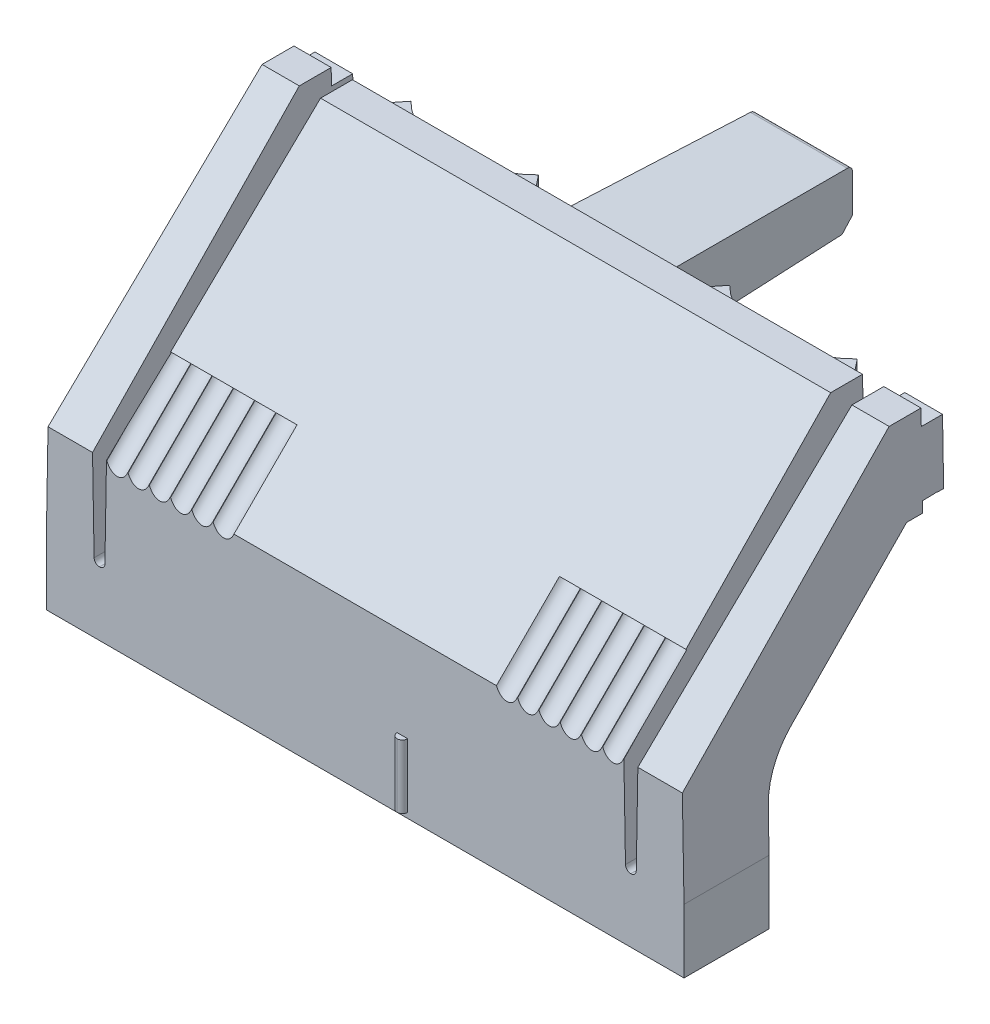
ISO-10303-21;
HEADER;
FILE_DESCRIPTION(('STEP AP214'),'2;1');
FILE_NAME('part.step','',(''),(''),'','','');
FILE_SCHEMA(('AUTOMOTIVE_DESIGN { 1 0 10303 214 1 1 1 1 }'));
ENDSEC;
DATA;
#1=APPLICATION_CONTEXT('core data for automotive mechanical design processes');
#2=APPLICATION_PROTOCOL_DEFINITION('international standard','automotive_design',2000,#1);
#3=PRODUCT_CONTEXT('',#1,'mechanical');
#4=PRODUCT('Part','Part','',(#3));
#5=PRODUCT_RELATED_PRODUCT_CATEGORY('part','',(#4));
#6=PRODUCT_DEFINITION_FORMATION('','',#4);
#7=PRODUCT_DEFINITION_CONTEXT('part definition',#1,'design');
#8=PRODUCT_DEFINITION('design','',#6,#7);
#9=PRODUCT_DEFINITION_SHAPE('','',#8);
#10=(LENGTH_UNIT() NAMED_UNIT(*) SI_UNIT(.MILLI.,.METRE.));
#11=(NAMED_UNIT(*) PLANE_ANGLE_UNIT() SI_UNIT($,.RADIAN.));
#12=(NAMED_UNIT(*) SI_UNIT($,.STERADIAN.) SOLID_ANGLE_UNIT());
#13=UNCERTAINTY_MEASURE_WITH_UNIT(LENGTH_MEASURE(1.E-05),#10,'distance_accuracy_value','');
#14=(GEOMETRIC_REPRESENTATION_CONTEXT(3) GLOBAL_UNCERTAINTY_ASSIGNED_CONTEXT((#13)) GLOBAL_UNIT_ASSIGNED_CONTEXT((#10,
#11,#12)) REPRESENTATION_CONTEXT('',''));
#15=CARTESIAN_POINT('',(0.,0.,0.));
#16=DIRECTION('',(0.,0.,1.));
#17=DIRECTION('',(1.,0.,0.));
#18=AXIS2_PLACEMENT_3D('',#15,#16,#17);
#19=CARTESIAN_POINT('',(30.,-1.85050506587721,-4.));
#20=DIRECTION('',(0.,0.,1.));
#21=DIRECTION('',(0.,-1.,0.));
#22=AXIS2_PLACEMENT_3D('',#19,#20,#21);
#23=PLANE('',#22);
#24=DIRECTION('',(0.017359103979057,0.999849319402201,0.));
#25=VECTOR('',#24,1.);
#26=CARTESIAN_POINT('',(25.6254461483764,-1.77455528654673,-4.));
#27=LINE('',#26,#25);
#28=CARTESIAN_POINT('',(25.5085301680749,-8.50867955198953,-4.));
#29=VERTEX_POINT('',#28);
#30=CARTESIAN_POINT('',(25.5697599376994,-4.98196852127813,-4.));
#31=VERTEX_POINT('',#30);
#32=EDGE_CURVE('E987',#29,#31,#27,.T.);
#33=ORIENTED_EDGE('',*,*,#32,.T.);
#34=DIRECTION('',(-1.,0.,0.));
#35=VECTOR('',#34,1.);
#36=CARTESIAN_POINT('',(28.,-4.98196852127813,-4.));
#37=LINE('',#36,#35);
#38=CARTESIAN_POINT('',(28.,-4.98196852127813,-4.));
#39=VERTEX_POINT('',#38);
#40=EDGE_CURVE('E1530',#31,#39,#37,.F.);
#41=ORIENTED_EDGE('',*,*,#40,.T.);
#42=DIRECTION('',(0.,1.,0.));
#43=VECTOR('',#42,1.);
#44=CARTESIAN_POINT('',(28.,-9.,-4.));
#45=LINE('',#44,#43);
#46=CARTESIAN_POINT('',(28.,-9.,-4.));
#47=VERTEX_POINT('',#46);
#48=EDGE_CURVE('E750',#47,#39,#45,.T.);
#49=ORIENTED_EDGE('',*,*,#48,.F.);
#50=DIRECTION('',(-1.,0.,0.));
#51=VECTOR('',#50,1.);
#52=CARTESIAN_POINT('',(29.,-9.,-4.));
#53=LINE('',#52,#51);
#54=CARTESIAN_POINT('',(29.,-9.,-4.));
#55=VERTEX_POINT('',#54);
#56=EDGE_CURVE('E747',#55,#47,#53,.T.);
#57=ORIENTED_EDGE('',*,*,#56,.F.);
#58=DIRECTION('',(0.,-1.,0.));
#59=VECTOR('',#58,1.);
#60=CARTESIAN_POINT('',(29.,-9.,-4.));
#61=LINE('',#60,#59);
#62=CARTESIAN_POINT('',(29.,-4.98196852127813,-4.));
#63=VERTEX_POINT('',#62);
#64=EDGE_CURVE('E737',#63,#55,#61,.T.);
#65=ORIENTED_EDGE('',*,*,#64,.F.);
#66=DIRECTION('',(1.,0.,0.));
#67=VECTOR('',#66,1.);
#68=CARTESIAN_POINT('',(29.4651200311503,-4.98196852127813,-4.));
#69=LINE('',#68,#67);
#70=CARTESIAN_POINT('',(29.9302400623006,-4.98196852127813,-4.));
#71=VERTEX_POINT('',#70);
#72=EDGE_CURVE('E1524',#63,#71,#69,.T.);
#73=ORIENTED_EDGE('',*,*,#72,.T.);
#74=DIRECTION('',(0.0173591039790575,-0.999849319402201,0.));
#75=VECTOR('',#74,1.);
#76=CARTESIAN_POINT('',(29.8759098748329,-1.85265948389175,-4.));
#77=LINE('',#76,#75);
#78=CARTESIAN_POINT('',(30.,-8.99999999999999,-4.));
#79=VERTEX_POINT('',#78);
#80=EDGE_CURVE('E968',#71,#79,#77,.T.);
#81=ORIENTED_EDGE('',*,*,#80,.T.);
#82=DIRECTION('',(0.,1.,0.));
#83=VECTOR('',#82,1.);
#84=CARTESIAN_POINT('',(30.,-1.85050506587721,-4.));
#85=LINE('',#84,#83);
#86=CARTESIAN_POINT('',(30.,-15.,-4.));
#87=VERTEX_POINT('',#86);
#88=EDGE_CURVE('E1193',#87,#79,#85,.T.);
#89=ORIENTED_EDGE('',*,*,#88,.F.);
#90=DIRECTION('',(-1.,0.,0.));
#91=VECTOR('',#90,1.);
#92=CARTESIAN_POINT('',(30.,-15.,-4.));
#93=LINE('',#92,#91);
#94=CARTESIAN_POINT('',(-30.,-15.,-4.));
#95=VERTEX_POINT('',#94);
#96=EDGE_CURVE('E1232',#87,#95,#93,.T.);
#97=ORIENTED_EDGE('',*,*,#96,.T.);
#98=DIRECTION('',(0.,1.,0.));
#99=VECTOR('',#98,1.);
#100=CARTESIAN_POINT('',(-30.,-1.85050506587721,-4.));
#101=LINE('',#100,#99);
#102=CARTESIAN_POINT('',(-30.,-9.,-4.));
#103=VERTEX_POINT('',#102);
#104=EDGE_CURVE('E1186',#95,#103,#101,.T.);
#105=ORIENTED_EDGE('',*,*,#104,.T.);
#106=DIRECTION('',(0.0173591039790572,0.999849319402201,0.));
#107=VECTOR('',#106,1.);
#108=CARTESIAN_POINT('',(-29.8578295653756,-0.811270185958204,-4.));
#109=LINE('',#108,#107);
#110=CARTESIAN_POINT('',(-29.9302400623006,-4.98196852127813,-4.));
#111=VERTEX_POINT('',#110);
#112=EDGE_CURVE('E1037',#103,#111,#109,.T.);
#113=ORIENTED_EDGE('',*,*,#112,.T.);
#114=DIRECTION('',(-1.,0.,0.));
#115=VECTOR('',#114,1.);
#116=CARTESIAN_POINT('',(-29.,-4.98196852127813,-4.));
#117=LINE('',#116,#115);
#118=CARTESIAN_POINT('',(-29.,-4.98196852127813,-4.));
#119=VERTEX_POINT('',#118);
#120=EDGE_CURVE('E1443',#111,#119,#117,.F.);
#121=ORIENTED_EDGE('',*,*,#120,.T.);
#122=DIRECTION('',(0.,1.,0.));
#123=VECTOR('',#122,1.);
#124=CARTESIAN_POINT('',(-29.,-9.,-4.));
#125=LINE('',#124,#123);
#126=CARTESIAN_POINT('',(-29.,-9.,-4.));
#127=VERTEX_POINT('',#126);
#128=EDGE_CURVE('E727',#127,#119,#125,.T.);
#129=ORIENTED_EDGE('',*,*,#128,.F.);
#130=DIRECTION('',(-1.,0.,0.));
#131=VECTOR('',#130,1.);
#132=CARTESIAN_POINT('',(-29.,-9.,-4.));
#133=LINE('',#132,#131);
#134=CARTESIAN_POINT('',(-28.,-9.,-4.));
#135=VERTEX_POINT('',#134);
#136=EDGE_CURVE('E726',#135,#127,#133,.T.);
#137=ORIENTED_EDGE('',*,*,#136,.F.);
#138=DIRECTION('',(0.,-1.,0.));
#139=VECTOR('',#138,1.);
#140=CARTESIAN_POINT('',(-28.,-9.,-4.));
#141=LINE('',#140,#139);
#142=CARTESIAN_POINT('',(-28.,-4.98196852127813,-4.));
#143=VERTEX_POINT('',#142);
#144=EDGE_CURVE('E715',#143,#135,#141,.T.);
#145=ORIENTED_EDGE('',*,*,#144,.F.);
#146=DIRECTION('',(-1.,0.,0.));
#147=VECTOR('',#146,1.);
#148=CARTESIAN_POINT('',(-25.6241275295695,-4.98196852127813,-4.));
#149=LINE('',#148,#147);
#150=CARTESIAN_POINT('',(-25.5697599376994,-4.98196852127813,-4.));
#151=VERTEX_POINT('',#150);
#152=EDGE_CURVE('E1441',#143,#151,#149,.F.);
#153=ORIENTED_EDGE('',*,*,#152,.T.);
#154=DIRECTION('',(0.0173591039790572,-0.999849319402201,0.));
#155=VECTOR('',#154,1.);
#156=CARTESIAN_POINT('',(-25.6073658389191,-2.81594458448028,-4.));
#157=LINE('',#156,#155);
#158=CARTESIAN_POINT('',(-25.5085301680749,-8.50867955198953,-4.));
#159=VERTEX_POINT('',#158);
#160=EDGE_CURVE('E1059',#151,#159,#157,.T.);
#161=ORIENTED_EDGE('',*,*,#160,.T.);
#162=CARTESIAN_POINT('',(-25.0086055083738,-8.5,-4.));
#163=DIRECTION('',(0.,0.,1.));
#164=DIRECTION('',(0.,-1.,0.));
#165=AXIS2_PLACEMENT_3D('',#162,#163,#164);
#166=CIRCLE('',#165,0.5);
#167=CARTESIAN_POINT('',(-25.0086055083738,-9.,-4.));
#168=VERTEX_POINT('',#167);
#169=EDGE_CURVE('E1328',#159,#168,#166,.T.);
#170=ORIENTED_EDGE('',*,*,#169,.T.);
#171=DIRECTION('',(1.,0.,0.));
#172=VECTOR('',#171,1.);
#173=CARTESIAN_POINT('',(30.,-9.,-4.));
#174=LINE('',#173,#172);
#175=CARTESIAN_POINT('',(-24.9913944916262,-9.,-4.));
#176=VERTEX_POINT('',#175);
#177=EDGE_CURVE('E1276',#168,#176,#174,.T.);
#178=ORIENTED_EDGE('',*,*,#177,.T.);
#179=CARTESIAN_POINT('',(-24.9913944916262,-8.5,-4.));
#180=DIRECTION('',(0.,0.,1.));
#181=DIRECTION('',(0.,-1.,0.));
#182=AXIS2_PLACEMENT_3D('',#179,#180,#181);
#183=CIRCLE('',#182,0.5);
#184=CARTESIAN_POINT('',(-24.4914698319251,-8.50867955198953,-4.));
#185=VERTEX_POINT('',#184);
#186=EDGE_CURVE('E1324',#176,#185,#183,.T.);
#187=ORIENTED_EDGE('',*,*,#186,.T.);
#188=DIRECTION('',(0.0173591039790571,0.999849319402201,0.));
#189=VECTOR('',#188,1.);
#190=CARTESIAN_POINT('',(-24.3594869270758,-0.906730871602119,-4.));
#191=LINE('',#190,#189);
#192=CARTESIAN_POINT('',(-24.4302400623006,-4.98196852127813,-4.));
#193=VERTEX_POINT('',#192);
#194=EDGE_CURVE('E1072',#185,#193,#191,.T.);
#195=ORIENTED_EDGE('',*,*,#194,.T.);
#196=DIRECTION('',(-1.,0.,0.));
#197=VECTOR('',#196,1.);
#198=CARTESIAN_POINT('',(-1.99999999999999,-4.98196852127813,-4.));
#199=LINE('',#198,#197);
#200=CARTESIAN_POINT('',(-1.99999999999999,-4.98196852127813,-4.));
#201=VERTEX_POINT('',#200);
#202=EDGE_CURVE('E1433',#193,#201,#199,.F.);
#203=ORIENTED_EDGE('',*,*,#202,.T.);
#204=DIRECTION('',(0.,1.,0.));
#205=VECTOR('',#204,1.);
#206=CARTESIAN_POINT('',(-1.99999999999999,-1.85050506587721,-4.));
#207=LINE('',#206,#205);
#208=CARTESIAN_POINT('',(-2.,-9.,-4.));
#209=VERTEX_POINT('',#208);
#210=EDGE_CURVE('E923',#209,#201,#207,.T.);
#211=ORIENTED_EDGE('',*,*,#210,.F.);
#212=DIRECTION('',(-1.,0.,0.));
#213=VECTOR('',#212,1.);
#214=CARTESIAN_POINT('',(30.,-9.,-4.));
#215=LINE('',#214,#213);
#216=CARTESIAN_POINT('',(2.00000000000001,-9.,-4.));
#217=VERTEX_POINT('',#216);
#218=EDGE_CURVE('E860',#217,#209,#215,.T.);
#219=ORIENTED_EDGE('',*,*,#218,.F.);
#220=DIRECTION('',(0.,-1.,0.));
#221=VECTOR('',#220,1.);
#222=CARTESIAN_POINT('',(2.00000000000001,-1.85050506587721,-4.));
#223=LINE('',#222,#221);
#224=CARTESIAN_POINT('',(2.00000000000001,-4.98196852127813,-4.));
#225=VERTEX_POINT('',#224);
#226=EDGE_CURVE('E929',#225,#217,#223,.T.);
#227=ORIENTED_EDGE('',*,*,#226,.F.);
#228=DIRECTION('',(-1.,0.,0.));
#229=VECTOR('',#228,1.);
#230=CARTESIAN_POINT('',(24.3758724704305,-4.98196852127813,-4.));
#231=LINE('',#230,#229);
#232=CARTESIAN_POINT('',(24.4302400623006,-4.98196852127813,-4.));
#233=VERTEX_POINT('',#232);
#234=EDGE_CURVE('E1521',#225,#233,#231,.F.);
#235=ORIENTED_EDGE('',*,*,#234,.T.);
#236=DIRECTION('',(0.0173591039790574,-0.999849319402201,0.));
#237=VECTOR('',#236,1.);
#238=CARTESIAN_POINT('',(24.3775672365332,-1.94812016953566,-4.));
#239=LINE('',#238,#237);
#240=CARTESIAN_POINT('',(24.4914698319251,-8.50867955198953,-4.));
#241=VERTEX_POINT('',#240);
#242=EDGE_CURVE('E999',#233,#241,#239,.T.);
#243=ORIENTED_EDGE('',*,*,#242,.T.);
#244=CARTESIAN_POINT('',(24.9913944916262,-8.5,-4.));
#245=DIRECTION('',(0.,0.,1.));
#246=DIRECTION('',(0.,-1.,0.));
#247=AXIS2_PLACEMENT_3D('',#244,#245,#246);
#248=CIRCLE('',#247,0.5);
#249=CARTESIAN_POINT('',(24.9913944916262,-9.,-4.));
#250=VERTEX_POINT('',#249);
#251=EDGE_CURVE('E1320',#241,#250,#248,.T.);
#252=ORIENTED_EDGE('',*,*,#251,.T.);
#253=DIRECTION('',(1.,0.,0.));
#254=VECTOR('',#253,1.);
#255=CARTESIAN_POINT('',(30.,-9.,-4.));
#256=LINE('',#255,#254);
#257=CARTESIAN_POINT('',(25.0086055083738,-9.,-4.));
#258=VERTEX_POINT('',#257);
#259=EDGE_CURVE('E1289',#250,#258,#256,.T.);
#260=ORIENTED_EDGE('',*,*,#259,.T.);
#261=CARTESIAN_POINT('',(25.0086055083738,-8.5,-4.));
#262=DIRECTION('',(0.,0.,1.));
#263=DIRECTION('',(0.,-1.,0.));
#264=AXIS2_PLACEMENT_3D('',#261,#262,#263);
#265=CIRCLE('',#264,0.5);
#266=EDGE_CURVE('E1316',#258,#29,#265,.T.);
#267=ORIENTED_EDGE('',*,*,#266,.T.);
#268=EDGE_LOOP('',(#33,#41,#49,#57,#65,#73,#81,#89,#97,#105,#113,#121,#129,#137,#145,#153,#161,
#170,#178,#187,#195,#203,#211,#219,#227,#235,#243,#252,#260,#267));
#269=FACE_BOUND('',#268,.T.);
#270=ADVANCED_FACE('F32',(#269),#23,.F.);
#271=CARTESIAN_POINT('',(30.,11.2989898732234,-17.2989898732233));
#272=DIRECTION('',(0.,0.711092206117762,0.703098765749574));
#273=DIRECTION('',(0.,-0.703098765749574,0.711092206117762));
#274=AXIS2_PLACEMENT_3D('',#271,#272,#273);
#275=PLANE('',#274);
#276=DIRECTION('',(-1.,0.,0.));
#277=VECTOR('',#276,1.);
#278=CARTESIAN_POINT('',(-28.,0.351223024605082,-6.2267592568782));
#279=LINE('',#278,#277);
#280=CARTESIAN_POINT('',(-25.6623533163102,0.351223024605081,-6.2267592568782));
#281=VERTEX_POINT('',#280);
#282=CARTESIAN_POINT('',(-29.8376466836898,0.351223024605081,-6.2267592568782));
#283=VERTEX_POINT('',#282);
#284=EDGE_CURVE('E1439',#281,#283,#279,.T.);
#285=ORIENTED_EDGE('',*,*,#284,.T.);
#286=DIRECTION('',(0.0122060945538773,0.703046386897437,-0.711039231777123));
#287=VECTOR('',#286,1.);
#288=CARTESIAN_POINT('',(-29.6386878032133,11.8108525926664,-17.816671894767));
#289=LINE('',#288,#287);
#290=CARTESIAN_POINT('',(-29.647574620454,11.2989898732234,-17.2989898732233));
#291=VERTEX_POINT('',#290);
#292=EDGE_CURVE('E1035',#283,#291,#289,.T.);
#293=ORIENTED_EDGE('',*,*,#292,.T.);
#294=DIRECTION('',(-1.,0.,0.));
#295=VECTOR('',#294,1.);
#296=CARTESIAN_POINT('',(30.,11.2989898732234,-17.2989898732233));
#297=LINE('',#296,#295);
#298=CARTESIAN_POINT('',(-25.852425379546,11.2989898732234,-17.2989898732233));
#299=VERTEX_POINT('',#298);
#300=EDGE_CURVE('E1231',#299,#291,#297,.T.);
#301=ORIENTED_EDGE('',*,*,#300,.F.);
#302=DIRECTION('',(0.0122060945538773,-0.703046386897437,0.711039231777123));
#303=VECTOR('',#302,1.);
#304=CARTESIAN_POINT('',(-25.8441039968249,10.8196950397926,-16.8142459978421));
#305=LINE('',#304,#303);
#306=EDGE_CURVE('E1056',#299,#281,#305,.T.);
#307=ORIENTED_EDGE('',*,*,#306,.T.);
#308=EDGE_LOOP('',(#285,#293,#301,#307));
#309=FACE_BOUND('',#308,.T.);
#310=ADVANCED_FACE('F1783',(#309),#275,.F.);
#311=DIRECTION('',(0.0122060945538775,-0.703046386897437,0.711039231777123));
#312=VECTOR('',#311,1.);
#313=CARTESIAN_POINT('',(29.6476271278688,11.2959655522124,-17.2959311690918));
#314=LINE('',#313,#312);
#315=CARTESIAN_POINT('',(29.647574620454,11.2989898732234,-17.2989898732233));
#316=VERTEX_POINT('',#315);
#317=CARTESIAN_POINT('',(29.8376466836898,0.351223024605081,-6.2267592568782));
#318=VERTEX_POINT('',#317);
#319=EDGE_CURVE('E965',#316,#318,#314,.T.);
#320=ORIENTED_EDGE('',*,*,#319,.T.);
#321=DIRECTION('',(-1.,0.,0.));
#322=VECTOR('',#321,1.);
#323=CARTESIAN_POINT('',(25.6241275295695,0.351223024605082,-6.2267592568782));
#324=LINE('',#323,#322);
#325=CARTESIAN_POINT('',(25.6623533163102,0.35122302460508,-6.2267592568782));
#326=VERTEX_POINT('',#325);
#327=EDGE_CURVE('E1516',#318,#326,#324,.T.);
#328=ORIENTED_EDGE('',*,*,#327,.T.);
#329=DIRECTION('',(0.0122060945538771,0.703046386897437,-0.711039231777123));
#330=VECTOR('',#329,1.);
#331=CARTESIAN_POINT('',(25.8530433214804,11.3345820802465,-17.3349867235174));
#332=LINE('',#331,#330);
#333=CARTESIAN_POINT('',(25.852425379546,11.2989898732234,-17.2989898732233));
#334=VERTEX_POINT('',#333);
#335=EDGE_CURVE('E985',#326,#334,#332,.T.);
#336=ORIENTED_EDGE('',*,*,#335,.T.);
#337=EDGE_CURVE('E1229',#316,#334,#297,.T.);
#338=ORIENTED_EDGE('',*,*,#337,.F.);
#339=EDGE_LOOP('',(#320,#328,#336,#338));
#340=FACE_BOUND('',#339,.T.);
#341=ADVANCED_FACE('F1515',(#340),#275,.F.);
#342=CARTESIAN_POINT('',(30.,-15.,4.));
#343=DIRECTION('',(0.,0.,-1.));
#344=DIRECTION('',(-1.,0.,0.));
#345=AXIS2_PLACEMENT_3D('',#342,#343,#344);
#346=PLANE('',#345);
#347=DIRECTION('',(0.,-1.,0.));
#348=VECTOR('',#347,1.);
#349=CARTESIAN_POINT('',(-30.,-15.,4.));
#350=LINE('',#349,#348);
#351=CARTESIAN_POINT('',(-30.,-9.,4.));
#352=VERTEX_POINT('',#351);
#353=CARTESIAN_POINT('',(-30.,-15.,4.));
#354=VERTEX_POINT('',#353);
#355=EDGE_CURVE('E1182',#352,#354,#350,.T.);
#356=ORIENTED_EDGE('',*,*,#355,.T.);
#357=DIRECTION('',(-1.,0.,0.));
#358=VECTOR('',#357,1.);
#359=CARTESIAN_POINT('',(30.,-15.,4.));
#360=LINE('',#359,#358);
#361=CARTESIAN_POINT('',(30.,-15.,4.));
#362=VERTEX_POINT('',#361);
#363=EDGE_CURVE('E1235',#362,#354,#360,.T.);
#364=ORIENTED_EDGE('',*,*,#363,.F.);
#365=DIRECTION('',(0.,-1.,0.));
#366=VECTOR('',#365,1.);
#367=CARTESIAN_POINT('',(30.,-15.,4.));
#368=LINE('',#367,#366);
#369=CARTESIAN_POINT('',(30.,-8.99999999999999,4.));
#370=VERTEX_POINT('',#369);
#371=EDGE_CURVE('E1189',#370,#362,#368,.T.);
#372=ORIENTED_EDGE('',*,*,#371,.F.);
#373=DIRECTION('',(0.0173591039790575,-0.999849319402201,0.));
#374=VECTOR('',#373,1.);
#375=CARTESIAN_POINT('',(30.,-8.99999999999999,4.));
#376=LINE('',#375,#374);
#377=CARTESIAN_POINT('',(29.8437445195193,0.,4.));
#378=VERTEX_POINT('',#377);
#379=EDGE_CURVE('E933',#378,#370,#376,.T.);
#380=ORIENTED_EDGE('',*,*,#379,.F.);
#381=DIRECTION('',(-1.,0.,0.));
#382=VECTOR('',#381,1.);
#383=CARTESIAN_POINT('',(30.,0.,4.));
#384=LINE('',#383,#382);
#385=CARTESIAN_POINT('',(25.6562554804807,0.,4.));
#386=VERTEX_POINT('',#385);
#387=EDGE_CURVE('E1200',#378,#386,#384,.T.);
#388=ORIENTED_EDGE('',*,*,#387,.T.);
#389=DIRECTION('',(0.017359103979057,0.999849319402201,0.));
#390=VECTOR('',#389,1.);
#391=CARTESIAN_POINT('',(26.,19.7989898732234,4.));
#392=LINE('',#391,#390);
#393=CARTESIAN_POINT('',(25.5085301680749,-8.50867955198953,4.));
#394=VERTEX_POINT('',#393);
#395=EDGE_CURVE('E931',#394,#386,#392,.T.);
#396=ORIENTED_EDGE('',*,*,#395,.F.);
#397=CARTESIAN_POINT('',(25.0086055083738,-8.5,4.));
#398=DIRECTION('',(0.,0.,-1.));
#399=DIRECTION('',(-1.,0.,0.));
#400=AXIS2_PLACEMENT_3D('',#397,#398,#399);
#401=CIRCLE('',#400,0.5);
#402=CARTESIAN_POINT('',(25.0086055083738,-9.,4.));
#403=VERTEX_POINT('',#402);
#404=EDGE_CURVE('E1314',#394,#403,#401,.T.);
#405=ORIENTED_EDGE('',*,*,#404,.T.);
#406=DIRECTION('',(1.,0.,0.));
#407=VECTOR('',#406,1.);
#408=CARTESIAN_POINT('',(25.5,-9.,4.));
#409=LINE('',#408,#407);
#410=CARTESIAN_POINT('',(24.9913944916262,-9.,4.));
#411=VERTEX_POINT('',#410);
#412=EDGE_CURVE('E938',#411,#403,#409,.T.);
#413=ORIENTED_EDGE('',*,*,#412,.F.);
#414=CARTESIAN_POINT('',(24.9913944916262,-8.5,4.));
#415=DIRECTION('',(0.,0.,-1.));
#416=DIRECTION('',(-1.,0.,0.));
#417=AXIS2_PLACEMENT_3D('',#414,#415,#416);
#418=CIRCLE('',#417,0.5);
#419=CARTESIAN_POINT('',(24.4914698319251,-8.50867955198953,4.));
#420=VERTEX_POINT('',#419);
#421=EDGE_CURVE('E1318',#411,#420,#418,.T.);
#422=ORIENTED_EDGE('',*,*,#421,.T.);
#423=DIRECTION('',(0.0173591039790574,-0.999849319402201,0.));
#424=VECTOR('',#423,1.);
#425=CARTESIAN_POINT('',(24.5,-9.,4.));
#426=LINE('',#425,#424);
#427=CARTESIAN_POINT('',(24.3437445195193,0.,4.));
#428=VERTEX_POINT('',#427);
#429=EDGE_CURVE('E935',#428,#420,#426,.T.);
#430=ORIENTED_EDGE('',*,*,#429,.F.);
#431=CARTESIAN_POINT('',(24.311317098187,0.,3.99999999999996));
#432=VERTEX_POINT('',#431);
#433=EDGE_CURVE('E1197',#428,#432,#384,.T.);
#434=ORIENTED_EDGE('',*,*,#433,.T.);
#435=CARTESIAN_POINT('',(23.3294667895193,0.809643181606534,4.));
#436=DIRECTION('',(0.,0.,-1.));
#437=DIRECTION('',(0.,-1.,0.));
#438=AXIS2_PLACEMENT_3D('',#435,#436,#437);
#439=ELLIPSE('',#438,1.60735252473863,1.13656987);
#440=CARTESIAN_POINT('',(22.3476164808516,0.,4.));
#441=VERTEX_POINT('',#440);
#442=EDGE_CURVE('E793',#432,#441,#439,.T.);
#443=ORIENTED_EDGE('',*,*,#442,.T.);
#444=CARTESIAN_POINT('',(22.311317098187,0.,4.));
#445=VERTEX_POINT('',#444);
#446=EDGE_CURVE('E1201',#441,#445,#384,.T.);
#447=ORIENTED_EDGE('',*,*,#446,.T.);
#448=CARTESIAN_POINT('',(21.3294667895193,0.809643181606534,4.));
#449=DIRECTION('',(0.,0.,-1.));
#450=DIRECTION('',(0.,-1.,0.));
#451=AXIS2_PLACEMENT_3D('',#448,#449,#450);
#452=ELLIPSE('',#451,1.60735252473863,1.13656987);
#453=CARTESIAN_POINT('',(20.3476164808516,0.,3.99999999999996));
#454=VERTEX_POINT('',#453);
#455=EDGE_CURVE('E808',#445,#454,#452,.T.);
#456=ORIENTED_EDGE('',*,*,#455,.T.);
#457=CARTESIAN_POINT('',(20.311317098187,0.,4.));
#458=VERTEX_POINT('',#457);
#459=EDGE_CURVE('E1593',#454,#458,#384,.T.);
#460=ORIENTED_EDGE('',*,*,#459,.T.);
#461=CARTESIAN_POINT('',(19.3294667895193,0.809643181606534,4.));
#462=DIRECTION('',(0.,0.,-1.));
#463=DIRECTION('',(0.,-1.,0.));
#464=AXIS2_PLACEMENT_3D('',#461,#462,#463);
#465=ELLIPSE('',#464,1.60735252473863,1.13656987);
#466=CARTESIAN_POINT('',(18.3476164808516,0.,3.99999999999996));
#467=VERTEX_POINT('',#466);
#468=EDGE_CURVE('E805',#458,#467,#465,.T.);
#469=ORIENTED_EDGE('',*,*,#468,.T.);
#470=CARTESIAN_POINT('',(18.311317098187,0.,4.));
#471=VERTEX_POINT('',#470);
#472=EDGE_CURVE('E1596',#467,#471,#384,.T.);
#473=ORIENTED_EDGE('',*,*,#472,.T.);
#474=CARTESIAN_POINT('',(17.3294667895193,0.809643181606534,4.));
#475=DIRECTION('',(0.,0.,-1.));
#476=DIRECTION('',(0.,-1.,0.));
#477=AXIS2_PLACEMENT_3D('',#474,#475,#476);
#478=ELLIPSE('',#477,1.60735252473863,1.13656987);
#479=CARTESIAN_POINT('',(16.3476164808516,0.,3.99999999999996));
#480=VERTEX_POINT('',#479);
#481=EDGE_CURVE('E802',#471,#480,#478,.T.);
#482=ORIENTED_EDGE('',*,*,#481,.T.);
#483=CARTESIAN_POINT('',(16.311317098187,0.,4.));
#484=VERTEX_POINT('',#483);
#485=EDGE_CURVE('E1599',#480,#484,#384,.T.);
#486=ORIENTED_EDGE('',*,*,#485,.T.);
#487=CARTESIAN_POINT('',(15.3294667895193,0.809643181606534,4.));
#488=DIRECTION('',(0.,0.,-1.));
#489=DIRECTION('',(0.,-1.,0.));
#490=AXIS2_PLACEMENT_3D('',#487,#488,#489);
#491=ELLIPSE('',#490,1.60735252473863,1.13656987);
#492=CARTESIAN_POINT('',(14.3476164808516,0.,3.99999999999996));
#493=VERTEX_POINT('',#492);
#494=EDGE_CURVE('E799',#484,#493,#491,.T.);
#495=ORIENTED_EDGE('',*,*,#494,.T.);
#496=CARTESIAN_POINT('',(14.311317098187,0.,4.));
#497=VERTEX_POINT('',#496);
#498=EDGE_CURVE('E1577',#493,#497,#384,.T.);
#499=ORIENTED_EDGE('',*,*,#498,.T.);
#500=CARTESIAN_POINT('',(13.3294667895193,0.809643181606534,4.));
#501=DIRECTION('',(0.,0.,-1.));
#502=DIRECTION('',(0.,-1.,0.));
#503=AXIS2_PLACEMENT_3D('',#500,#501,#502);
#504=ELLIPSE('',#503,1.60735252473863,1.13656987);
#505=CARTESIAN_POINT('',(12.3476164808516,0.,3.99999999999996));
#506=VERTEX_POINT('',#505);
#507=EDGE_CURVE('E811',#497,#506,#504,.T.);
#508=ORIENTED_EDGE('',*,*,#507,.T.);
#509=CARTESIAN_POINT('',(-12.3476164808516,0.,4.));
#510=VERTEX_POINT('',#509);
#511=EDGE_CURVE('E1202',#506,#510,#384,.T.);
#512=ORIENTED_EDGE('',*,*,#511,.T.);
#513=CARTESIAN_POINT('',(-13.3294667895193,0.809643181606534,4.));
#514=DIRECTION('',(0.,0.,-1.));
#515=DIRECTION('',(0.,-1.,0.));
#516=AXIS2_PLACEMENT_3D('',#513,#514,#515);
#517=ELLIPSE('',#516,1.60735252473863,1.13656987);
#518=CARTESIAN_POINT('',(-14.311317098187,0.,3.99999999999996));
#519=VERTEX_POINT('',#518);
#520=EDGE_CURVE('E852',#510,#519,#517,.T.);
#521=ORIENTED_EDGE('',*,*,#520,.T.);
#522=CARTESIAN_POINT('',(-14.3476164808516,0.,4.));
#523=VERTEX_POINT('',#522);
#524=EDGE_CURVE('E1570',#519,#523,#384,.T.);
#525=ORIENTED_EDGE('',*,*,#524,.T.);
#526=CARTESIAN_POINT('',(-15.3294667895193,0.809643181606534,4.));
#527=DIRECTION('',(0.,0.,-1.));
#528=DIRECTION('',(0.,-1.,0.));
#529=AXIS2_PLACEMENT_3D('',#526,#527,#528);
#530=ELLIPSE('',#529,1.60735252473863,1.13656987);
#531=CARTESIAN_POINT('',(-16.311317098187,0.,3.99999999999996));
#532=VERTEX_POINT('',#531);
#533=EDGE_CURVE('E849',#523,#532,#530,.T.);
#534=ORIENTED_EDGE('',*,*,#533,.T.);
#535=CARTESIAN_POINT('',(-16.3476164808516,0.,4.));
#536=VERTEX_POINT('',#535);
#537=EDGE_CURVE('E1575',#532,#536,#384,.T.);
#538=ORIENTED_EDGE('',*,*,#537,.T.);
#539=CARTESIAN_POINT('',(-17.3294667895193,0.809643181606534,4.));
#540=DIRECTION('',(0.,0.,-1.));
#541=DIRECTION('',(0.,-1.,0.));
#542=AXIS2_PLACEMENT_3D('',#539,#540,#541);
#543=ELLIPSE('',#542,1.60735252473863,1.13656987);
#544=CARTESIAN_POINT('',(-18.311317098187,0.,3.99999999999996));
#545=VERTEX_POINT('',#544);
#546=EDGE_CURVE('E846',#536,#545,#543,.T.);
#547=ORIENTED_EDGE('',*,*,#546,.T.);
#548=CARTESIAN_POINT('',(-18.3476164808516,0.,4.));
#549=VERTEX_POINT('',#548);
#550=EDGE_CURVE('E1579',#545,#549,#384,.T.);
#551=ORIENTED_EDGE('',*,*,#550,.T.);
#552=CARTESIAN_POINT('',(-19.3294667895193,0.809643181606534,4.));
#553=DIRECTION('',(0.,0.,-1.));
#554=DIRECTION('',(0.,-1.,0.));
#555=AXIS2_PLACEMENT_3D('',#552,#553,#554);
#556=ELLIPSE('',#555,1.60735252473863,1.13656987);
#557=CARTESIAN_POINT('',(-20.311317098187,0.,3.99999999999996));
#558=VERTEX_POINT('',#557);
#559=EDGE_CURVE('E843',#549,#558,#556,.T.);
#560=ORIENTED_EDGE('',*,*,#559,.T.);
#561=CARTESIAN_POINT('',(-20.3476164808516,0.,4.));
#562=VERTEX_POINT('',#561);
#563=EDGE_CURVE('E1582',#558,#562,#384,.T.);
#564=ORIENTED_EDGE('',*,*,#563,.T.);
#565=CARTESIAN_POINT('',(-21.3294667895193,0.809643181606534,4.));
#566=DIRECTION('',(0.,0.,-1.));
#567=DIRECTION('',(0.,-1.,0.));
#568=AXIS2_PLACEMENT_3D('',#565,#566,#567);
#569=ELLIPSE('',#568,1.60735252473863,1.13656987);
#570=CARTESIAN_POINT('',(-22.311317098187,0.,3.99999999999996));
#571=VERTEX_POINT('',#570);
#572=EDGE_CURVE('E840',#562,#571,#569,.T.);
#573=ORIENTED_EDGE('',*,*,#572,.T.);
#574=CARTESIAN_POINT('',(-22.3476164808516,0.,4.));
#575=VERTEX_POINT('',#574);
#576=EDGE_CURVE('E1585',#571,#575,#384,.T.);
#577=ORIENTED_EDGE('',*,*,#576,.T.);
#578=CARTESIAN_POINT('',(-23.3294667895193,0.809643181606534,4.));
#579=DIRECTION('',(0.,0.,-1.));
#580=DIRECTION('',(0.,-1.,0.));
#581=AXIS2_PLACEMENT_3D('',#578,#579,#580);
#582=ELLIPSE('',#581,1.60735252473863,1.13656987);
#583=CARTESIAN_POINT('',(-24.311317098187,0.,3.99999999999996));
#584=VERTEX_POINT('',#583);
#585=EDGE_CURVE('E834',#575,#584,#582,.T.);
#586=ORIENTED_EDGE('',*,*,#585,.T.);
#587=CARTESIAN_POINT('',(-24.3437445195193,0.,4.));
#588=VERTEX_POINT('',#587);
#589=EDGE_CURVE('E1573',#584,#588,#384,.T.);
#590=ORIENTED_EDGE('',*,*,#589,.T.);
#591=DIRECTION('',(0.0173591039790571,0.999849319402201,0.));
#592=VECTOR('',#591,1.);
#593=CARTESIAN_POINT('',(-24.5,-9.,4.));
#594=LINE('',#593,#592);
#595=CARTESIAN_POINT('',(-24.4914698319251,-8.50867955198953,4.));
#596=VERTEX_POINT('',#595);
#597=EDGE_CURVE('E1004',#596,#588,#594,.T.);
#598=ORIENTED_EDGE('',*,*,#597,.F.);
#599=CARTESIAN_POINT('',(-24.9913944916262,-8.5,4.));
#600=DIRECTION('',(0.,0.,-1.));
#601=DIRECTION('',(-1.,0.,0.));
#602=AXIS2_PLACEMENT_3D('',#599,#600,#601);
#603=CIRCLE('',#602,0.5);
#604=CARTESIAN_POINT('',(-24.9913944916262,-9.,4.));
#605=VERTEX_POINT('',#604);
#606=EDGE_CURVE('E1322',#596,#605,#603,.T.);
#607=ORIENTED_EDGE('',*,*,#606,.T.);
#608=DIRECTION('',(1.,0.,0.));
#609=VECTOR('',#608,1.);
#610=CARTESIAN_POINT('',(-25.5,-9.,4.));
#611=LINE('',#610,#609);
#612=CARTESIAN_POINT('',(-25.0086055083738,-9.,4.));
#613=VERTEX_POINT('',#612);
#614=EDGE_CURVE('E1001',#613,#605,#611,.T.);
#615=ORIENTED_EDGE('',*,*,#614,.F.);
#616=CARTESIAN_POINT('',(-25.0086055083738,-8.5,4.));
#617=DIRECTION('',(0.,0.,-1.));
#618=DIRECTION('',(-1.,0.,0.));
#619=AXIS2_PLACEMENT_3D('',#616,#617,#618);
#620=CIRCLE('',#619,0.5);
#621=CARTESIAN_POINT('',(-25.5085301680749,-8.50867955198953,4.));
#622=VERTEX_POINT('',#621);
#623=EDGE_CURVE('E1326',#613,#622,#620,.T.);
#624=ORIENTED_EDGE('',*,*,#623,.T.);
#625=DIRECTION('',(0.0173591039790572,-0.999849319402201,0.));
#626=VECTOR('',#625,1.);
#627=CARTESIAN_POINT('',(-26.,19.7989898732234,4.));
#628=LINE('',#627,#626);
#629=CARTESIAN_POINT('',(-25.6562554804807,0.,4.));
#630=VERTEX_POINT('',#629);
#631=EDGE_CURVE('E1009',#630,#622,#628,.T.);
#632=ORIENTED_EDGE('',*,*,#631,.F.);
#633=CARTESIAN_POINT('',(-29.8437445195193,0.,4.));
#634=VERTEX_POINT('',#633);
#635=EDGE_CURVE('E1196',#630,#634,#384,.T.);
#636=ORIENTED_EDGE('',*,*,#635,.T.);
#637=DIRECTION('',(0.0173591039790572,0.999849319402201,0.));
#638=VECTOR('',#637,1.);
#639=CARTESIAN_POINT('',(-30.,-9.,4.));
#640=LINE('',#639,#638);
#641=EDGE_CURVE('E1007',#352,#634,#640,.T.);
#642=ORIENTED_EDGE('',*,*,#641,.F.);
#643=EDGE_LOOP('',(#356,#364,#372,#380,#388,#396,#405,#413,#422,#430,#434,#443,#447,#456,#460,
#469,#473,#482,#486,#495,#499,#508,#512,#521,#525,#534,#538,#547,#551,#560,#564,#573,#577,#586,
#590,#598,#607,#615,#624,#632,#636,#642));
#644=FACE_BOUND('',#643,.T.);
#645=DIRECTION('',(0.,-1.,0.));
#646=VECTOR('',#645,1.);
#647=CARTESIAN_POINT('',(2.99999999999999,-8.5,4.));
#648=LINE('',#647,#646);
#649=CARTESIAN_POINT('',(2.99999999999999,-8.5,4.));
#650=VERTEX_POINT('',#649);
#651=CARTESIAN_POINT('',(3.,-14.5,4.));
#652=VERTEX_POINT('',#651);
#653=EDGE_CURVE('E761',#650,#652,#648,.T.);
#654=ORIENTED_EDGE('',*,*,#653,.F.);
#655=DIRECTION('',(-1.,0.,0.));
#656=VECTOR('',#655,1.);
#657=CARTESIAN_POINT('',(2.99999999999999,-8.5,4.));
#658=LINE('',#657,#656);
#659=CARTESIAN_POINT('',(3.99999999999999,-8.5,4.));
#660=VERTEX_POINT('',#659);
#661=EDGE_CURVE('E770',#660,#650,#658,.T.);
#662=ORIENTED_EDGE('',*,*,#661,.F.);
#663=DIRECTION('',(0.,1.,0.));
#664=VECTOR('',#663,1.);
#665=CARTESIAN_POINT('',(3.99999999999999,-8.5,4.));
#666=LINE('',#665,#664);
#667=CARTESIAN_POINT('',(3.99999999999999,-14.5,4.));
#668=VERTEX_POINT('',#667);
#669=EDGE_CURVE('E767',#668,#660,#666,.T.);
#670=ORIENTED_EDGE('',*,*,#669,.F.);
#671=DIRECTION('',(1.,0.,0.));
#672=VECTOR('',#671,1.);
#673=CARTESIAN_POINT('',(2.99999999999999,-14.5,4.));
#674=LINE('',#673,#672);
#675=EDGE_CURVE('E764',#652,#668,#674,.T.);
#676=ORIENTED_EDGE('',*,*,#675,.F.);
#677=EDGE_LOOP('',(#654,#662,#670,#676));
#678=FACE_BOUND('',#677,.T.);
#679=ADVANCED_FACE('F1562',(#644,#678),#346,.F.);
#680=CARTESIAN_POINT('',(30.,0.,4.));
#681=DIRECTION('',(0.,-0.707106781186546,-0.707106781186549));
#682=DIRECTION('',(0.,0.707106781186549,-0.707106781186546));
#683=AXIS2_PLACEMENT_3D('',#680,#681,#682);
#684=PLANE('',#683);
#685=DIRECTION('',(-0.0122756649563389,0.707053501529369,-0.707053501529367));
#686=VECTOR('',#685,1.);
#687=CARTESIAN_POINT('',(24.344596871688,-0.049093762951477,4.04909376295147));
#688=LINE('',#687,#686);
#689=CARTESIAN_POINT('',(24.311317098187,1.86775395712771,2.13224604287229));
#690=VERTEX_POINT('',#689);
#691=EDGE_CURVE('E1286',#428,#690,#688,.T.);
#692=ORIENTED_EDGE('',*,*,#691,.T.);
#693=DIRECTION('',(0.,-0.707106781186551,0.707106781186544));
#694=VECTOR('',#693,1.);
#695=CARTESIAN_POINT('',(24.311317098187,5.93502884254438,-1.93502884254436));
#696=LINE('',#695,#694);
#697=EDGE_CURVE('E790',#690,#432,#696,.T.);
#698=ORIENTED_EDGE('',*,*,#697,.T.);
#699=ORIENTED_EDGE('',*,*,#433,.F.);
#700=EDGE_LOOP('',(#692,#698,#699));
#701=FACE_BOUND('',#700,.T.);
#702=ADVANCED_FACE('F1737',(#701),#684,.F.);
#703=ORIENTED_EDGE('',*,*,#589,.F.);
#704=DIRECTION('',(0.,-0.707106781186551,0.707106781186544));
#705=VECTOR('',#704,1.);
#706=CARTESIAN_POINT('',(-24.311317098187,5.93502884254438,-1.93502884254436));
#707=LINE('',#706,#705);
#708=CARTESIAN_POINT('',(-24.311317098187,1.86775395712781,2.1322460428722));
#709=VERTEX_POINT('',#708);
#710=EDGE_CURVE('E831',#584,#709,#707,.F.);
#711=ORIENTED_EDGE('',*,*,#710,.T.);
#712=DIRECTION('',(-0.0122756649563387,-0.707053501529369,0.707053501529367));
#713=VECTOR('',#712,1.);
#714=CARTESIAN_POINT('',(-24.3355553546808,0.471679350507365,3.52832064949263));
#715=LINE('',#714,#713);
#716=EDGE_CURVE('E1272',#709,#588,#715,.T.);
#717=ORIENTED_EDGE('',*,*,#716,.T.);
#718=EDGE_LOOP('',(#703,#711,#717));
#719=FACE_BOUND('',#718,.T.);
#720=ADVANCED_FACE('F1938',(#719),#684,.F.);
#721=CARTESIAN_POINT('',(30.,12.2989898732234,-18.7989898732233));
#722=DIRECTION('',(0.,1.,0.));
#723=DIRECTION('',(0.,0.,1.));
#724=AXIS2_PLACEMENT_3D('',#721,#722,#723);
#725=PLANE('',#724);
#726=DIRECTION('',(0.624695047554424,0.,0.78086880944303));
#727=VECTOR('',#726,1.);
#728=CARTESIAN_POINT('',(25.7317073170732,12.2989898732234,-15.3843557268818));
#729=LINE('',#728,#727);
#730=CARTESIAN_POINT('',(21.,12.2989898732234,-21.2989898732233));
#731=VERTEX_POINT('',#730);
#732=CARTESIAN_POINT('',(21.8393383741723,12.2989898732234,-20.2498169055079));
#733=VERTEX_POINT('',#732);
#734=EDGE_CURVE('E1172',#731,#733,#729,.T.);
#735=ORIENTED_EDGE('',*,*,#734,.T.);
#736=DIRECTION('',(-1.,0.,0.));
#737=VECTOR('',#736,1.);
#738=CARTESIAN_POINT('',(30.,12.2989898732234,-20.2498169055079));
#739=LINE('',#738,#737);
#740=CARTESIAN_POINT('',(19.7186354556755,12.2989898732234,-20.2498169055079));
#741=VERTEX_POINT('',#740);
#742=EDGE_CURVE('E893',#733,#741,#739,.T.);
#743=ORIENTED_EDGE('',*,*,#742,.T.);
#744=CARTESIAN_POINT('',(15.,12.2989898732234,-27.3197871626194));
#745=DIRECTION('',(0.,1.,0.));
#746=DIRECTION('',(0.,0.,1.));
#747=AXIS2_PLACEMENT_3D('',#744,#745,#746);
#748=CIRCLE('',#747,8.5);
#749=EDGE_CURVE('E1109',#741,#731,#748,.T.);
#750=ORIENTED_EDGE('',*,*,#749,.T.);
#751=EDGE_LOOP('',(#735,#743,#750));
#752=FACE_BOUND('',#751,.T.);
#753=ADVANCED_FACE('F1948',(#752),#725,.F.);
#754=CARTESIAN_POINT('',(30.,12.2989898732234,-18.7989898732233));
#755=DIRECTION('',(0.,-0.999701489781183,-0.0244321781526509));
#756=DIRECTION('',(0.,0.0244321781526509,-0.999701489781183));
#757=AXIS2_PLACEMENT_3D('',#754,#755,#756);
#758=PLANE('',#757);
#759=DIRECTION('',(-1.,0.,0.));
#760=VECTOR('',#759,1.);
#761=CARTESIAN_POINT('',(2.5,12.6051391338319,-31.325825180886));
#762=LINE('',#761,#760);
#763=CARTESIAN_POINT('',(2.5,12.6051391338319,-31.325825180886));
#764=VERTEX_POINT('',#763);
#765=CARTESIAN_POINT('',(-2.5,12.6051391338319,-31.325825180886));
#766=VERTEX_POINT('',#765);
#767=EDGE_CURVE('E1077',#764,#766,#762,.T.);
#768=ORIENTED_EDGE('',*,*,#767,.F.);
#769=DIRECTION('',(0.,-0.0244321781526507,0.999701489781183));
#770=VECTOR('',#769,1.);
#771=CARTESIAN_POINT('',(2.5,12.6051391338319,-31.325825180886));
#772=LINE('',#771,#770);
#773=CARTESIAN_POINT('',(2.5,12.6784356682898,-34.3249296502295));
#774=VERTEX_POINT('',#773);
#775=EDGE_CURVE('E1075',#774,#764,#772,.T.);
#776=ORIENTED_EDGE('',*,*,#775,.F.);
#777=DIRECTION('',(1.,0.,0.));
#778=VECTOR('',#777,1.);
#779=CARTESIAN_POINT('',(2.5,12.6784356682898,-34.3249296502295));
#780=LINE('',#779,#778);
#781=CARTESIAN_POINT('',(-2.5,12.6784356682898,-34.3249296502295));
#782=VERTEX_POINT('',#781);
#783=EDGE_CURVE('E1083',#782,#774,#780,.T.);
#784=ORIENTED_EDGE('',*,*,#783,.F.);
#785=DIRECTION('',(0.,0.0244321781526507,-0.999701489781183));
#786=VECTOR('',#785,1.);
#787=CARTESIAN_POINT('',(-2.5,12.6051391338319,-31.325825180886));
#788=LINE('',#787,#786);
#789=EDGE_CURVE('E1080',#766,#782,#788,.T.);
#790=ORIENTED_EDGE('',*,*,#789,.F.);
#791=EDGE_LOOP('',(#768,#776,#784,#790));
#792=FACE_BOUND('',#791,.T.);
#793=DIRECTION('',(0.024424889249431,-0.0244248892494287,0.999403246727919));
#794=VECTOR('',#793,1.);
#795=CARTESIAN_POINT('',(5.01491438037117,12.2840754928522,-18.188732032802));
#796=LINE('',#795,#794);
#797=CARTESIAN_POINT('',(4.57230191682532,12.726687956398,-36.2992883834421));
#798=VERTEX_POINT('',#797);
#799=CARTESIAN_POINT('',(4.99999999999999,12.2989898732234,-18.7989898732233));
#800=VERTEX_POINT('',#799);
#801=EDGE_CURVE('E1169',#798,#800,#796,.T.);
#802=ORIENTED_EDGE('',*,*,#801,.T.);
#803=DIRECTION('',(-1.,0.,0.));
#804=VECTOR('',#803,1.);
#805=CARTESIAN_POINT('',(30.,12.2989898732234,-18.7989898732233));
#806=LINE('',#805,#804);
#807=CARTESIAN_POINT('',(-5.,12.2989898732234,-18.7989898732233));
#808=VERTEX_POINT('',#807);
#809=EDGE_CURVE('E1853',#800,#808,#806,.T.);
#810=ORIENTED_EDGE('',*,*,#809,.T.);
#811=DIRECTION('',(0.024424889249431,0.0244248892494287,-0.999403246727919));
#812=VECTOR('',#811,1.);
#813=CARTESIAN_POINT('',(-4.97911986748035,12.319870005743,-19.6533508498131));
#814=LINE('',#813,#812);
#815=CARTESIAN_POINT('',(-4.57230191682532,12.726687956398,-36.2992883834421));
#816=VERTEX_POINT('',#815);
#817=EDGE_CURVE('E1181',#808,#816,#814,.T.);
#818=ORIENTED_EDGE('',*,*,#817,.T.);
#819=DIRECTION('',(-1.,0.,0.));
#820=VECTOR('',#819,1.);
#821=CARTESIAN_POINT('',(30.,12.726687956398,-36.2992883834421));
#822=LINE('',#821,#820);
#823=EDGE_CURVE('E1253',#816,#798,#822,.F.);
#824=ORIENTED_EDGE('',*,*,#823,.T.);
#825=EDGE_LOOP('',(#802,#810,#818,#824));
#826=FACE_BOUND('',#825,.T.);
#827=ADVANCED_FACE('F34',(#792,#826),#758,.T.);
#828=DIRECTION('',(0.0122060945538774,-0.703046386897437,0.711039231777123));
#829=VECTOR('',#828,1.);
#830=CARTESIAN_POINT('',(24.1484465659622,11.2487675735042,-17.2481966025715));
#831=LINE('',#830,#829);
#832=CARTESIAN_POINT('',(24.147574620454,11.2989898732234,-17.2989898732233));
#833=VERTEX_POINT('',#832);
#834=CARTESIAN_POINT('',(24.3376466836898,0.351223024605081,-6.2267592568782));
#835=VERTEX_POINT('',#834);
#836=EDGE_CURVE('E997',#833,#835,#831,.T.);
#837=ORIENTED_EDGE('',*,*,#836,.T.);
#838=DIRECTION('',(-1.,0.,0.));
#839=VECTOR('',#838,1.);
#840=CARTESIAN_POINT('',(2.00000000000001,0.351223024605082,-6.2267592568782));
#841=LINE('',#840,#839);
#842=CARTESIAN_POINT('',(2.,0.351223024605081,-6.2267592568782));
#843=VERTEX_POINT('',#842);
#844=EDGE_CURVE('E1499',#835,#843,#841,.T.);
#845=ORIENTED_EDGE('',*,*,#844,.T.);
#846=DIRECTION('',(0.,-0.703098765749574,0.711092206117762));
#847=VECTOR('',#846,1.);
#848=CARTESIAN_POINT('',(2.,13.2686569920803,-19.2910498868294));
#849=LINE('',#848,#847);
#850=CARTESIAN_POINT('',(2.00000000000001,11.2989898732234,-17.2989898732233));
#851=VERTEX_POINT('',#850);
#852=EDGE_CURVE('E909',#851,#843,#849,.T.);
#853=ORIENTED_EDGE('',*,*,#852,.F.);
#854=EDGE_CURVE('E1226',#833,#851,#297,.T.);
#855=ORIENTED_EDGE('',*,*,#854,.F.);
#856=EDGE_LOOP('',(#837,#845,#853,#855));
#857=FACE_BOUND('',#856,.T.);
#858=ADVANCED_FACE('F1790',(#857),#275,.F.);
#859=DIRECTION('',(0.,0.703098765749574,-0.711092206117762));
#860=VECTOR('',#859,1.);
#861=CARTESIAN_POINT('',(-2.,13.2686569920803,-19.2910498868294));
#862=LINE('',#861,#860);
#863=CARTESIAN_POINT('',(-2.,0.351223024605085,-6.2267592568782));
#864=VERTEX_POINT('',#863);
#865=CARTESIAN_POINT('',(-1.99999999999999,11.2989898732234,-17.2989898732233));
#866=VERTEX_POINT('',#865);
#867=EDGE_CURVE('E912',#864,#866,#862,.T.);
#868=ORIENTED_EDGE('',*,*,#867,.F.);
#869=DIRECTION('',(-1.,0.,0.));
#870=VECTOR('',#869,1.);
#871=CARTESIAN_POINT('',(-24.3758724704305,0.351223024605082,-6.2267592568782));
#872=LINE('',#871,#870);
#873=CARTESIAN_POINT('',(-24.3376466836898,0.351223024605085,-6.2267592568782));
#874=VERTEX_POINT('',#873);
#875=EDGE_CURVE('E1430',#864,#874,#872,.T.);
#876=ORIENTED_EDGE('',*,*,#875,.T.);
#877=DIRECTION('',(0.0122060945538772,0.703046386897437,-0.711039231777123));
#878=VECTOR('',#877,1.);
#879=CARTESIAN_POINT('',(-24.1395072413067,11.7636546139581,-17.7689373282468));
#880=LINE('',#879,#878);
#881=CARTESIAN_POINT('',(-24.147574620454,11.2989898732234,-17.2989898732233));
#882=VERTEX_POINT('',#881);
#883=EDGE_CURVE('E1070',#874,#882,#880,.T.);
#884=ORIENTED_EDGE('',*,*,#883,.T.);
#885=EDGE_CURVE('E1230',#866,#882,#297,.T.);
#886=ORIENTED_EDGE('',*,*,#885,.F.);
#887=EDGE_LOOP('',(#868,#876,#884,#886));
#888=FACE_BOUND('',#887,.T.);
#889=ADVANCED_FACE('F1910',(#888),#275,.F.);
#890=CARTESIAN_POINT('',(30.,11.2989898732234,-18.7989898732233));
#891=DIRECTION('',(0.,1.,0.));
#892=DIRECTION('',(0.,0.,1.));
#893=AXIS2_PLACEMENT_3D('',#890,#891,#892);
#894=PLANE('',#893);
#895=DIRECTION('',(0.,0.,1.));
#896=VECTOR('',#895,1.);
#897=CARTESIAN_POINT('',(2.00000000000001,11.2989898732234,-18.7989898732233));
#898=LINE('',#897,#896);
#899=CARTESIAN_POINT('',(2.,11.2989898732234,-18.7989898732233));
#900=VERTEX_POINT('',#899);
#901=EDGE_CURVE('E926',#900,#851,#898,.T.);
#902=ORIENTED_EDGE('',*,*,#901,.F.);
#903=DIRECTION('',(-1.,0.,0.));
#904=VECTOR('',#903,1.);
#905=CARTESIAN_POINT('',(30.,11.2989898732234,-18.7989898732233));
#906=LINE('',#905,#904);
#907=CARTESIAN_POINT('',(24.147574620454,11.2989898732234,-18.7989898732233));
#908=VERTEX_POINT('',#907);
#909=EDGE_CURVE('E1221',#908,#900,#906,.T.);
#910=ORIENTED_EDGE('',*,*,#909,.F.);
#911=DIRECTION('',(0.,0.,1.));
#912=VECTOR('',#911,1.);
#913=CARTESIAN_POINT('',(24.147574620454,11.2989898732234,-18.7989898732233));
#914=LINE('',#913,#912);
#915=EDGE_CURVE('E994',#908,#833,#914,.T.);
#916=ORIENTED_EDGE('',*,*,#915,.T.);
#917=ORIENTED_EDGE('',*,*,#854,.T.);
#918=EDGE_LOOP('',(#902,#910,#916,#917));
#919=FACE_BOUND('',#918,.T.);
#920=ADVANCED_FACE('F1916',(#919),#894,.F.);
#921=DIRECTION('',(0.,0.,-1.));
#922=VECTOR('',#921,1.);
#923=CARTESIAN_POINT('',(-1.99999999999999,11.2989898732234,-18.7989898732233));
#924=LINE('',#923,#922);
#925=CARTESIAN_POINT('',(-2.,11.2989898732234,-18.7989898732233));
#926=VERTEX_POINT('',#925);
#927=EDGE_CURVE('E920',#866,#926,#924,.T.);
#928=ORIENTED_EDGE('',*,*,#927,.F.);
#929=ORIENTED_EDGE('',*,*,#885,.T.);
#930=DIRECTION('',(0.,0.,-1.));
#931=VECTOR('',#930,1.);
#932=CARTESIAN_POINT('',(-24.147574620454,11.2989898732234,-18.7989898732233));
#933=LINE('',#932,#931);
#934=CARTESIAN_POINT('',(-24.147574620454,11.2989898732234,-18.7989898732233));
#935=VERTEX_POINT('',#934);
#936=EDGE_CURVE('E1067',#882,#935,#933,.T.);
#937=ORIENTED_EDGE('',*,*,#936,.T.);
#938=EDGE_CURVE('E1225',#926,#935,#906,.T.);
#939=ORIENTED_EDGE('',*,*,#938,.F.);
#940=EDGE_LOOP('',(#928,#929,#937,#939));
#941=FACE_BOUND('',#940,.T.);
#942=ADVANCED_FACE('F1914',(#941),#894,.F.);
#943=CARTESIAN_POINT('',(30.,19.7989898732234,-18.7989898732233));
#944=DIRECTION('',(0.,0.,1.));
#945=DIRECTION('',(0.,-1.,0.));
#946=AXIS2_PLACEMENT_3D('',#943,#944,#945);
#947=PLANE('',#946);
#948=CARTESIAN_POINT('',(23.,12.2989898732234,-18.7989898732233));
#949=VERTEX_POINT('',#948);
#950=CARTESIAN_POINT('',(6.99999999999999,12.2989898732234,-18.7989898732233));
#951=VERTEX_POINT('',#950);
#952=EDGE_CURVE('E1220',#949,#951,#806,.T.);
#953=ORIENTED_EDGE('',*,*,#952,.F.);
#954=DIRECTION('',(0.,1.,0.));
#955=VECTOR('',#954,1.);
#956=CARTESIAN_POINT('',(23.,-15.,-18.7989898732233));
#957=LINE('',#956,#955);
#958=CARTESIAN_POINT('',(23.,18.2989898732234,-18.7989898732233));
#959=VERTEX_POINT('',#958);
#960=EDGE_CURVE('E1151',#949,#959,#957,.T.);
#961=ORIENTED_EDGE('',*,*,#960,.T.);
#962=DIRECTION('',(-1.,0.,0.));
#963=VECTOR('',#962,1.);
#964=CARTESIAN_POINT('',(30.,18.2989898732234,-18.7989898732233));
#965=LINE('',#964,#963);
#966=CARTESIAN_POINT('',(6.99999999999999,18.2989898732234,-18.7989898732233));
#967=VERTEX_POINT('',#966);
#968=EDGE_CURVE('E1215',#959,#967,#965,.T.);
#969=ORIENTED_EDGE('',*,*,#968,.T.);
#970=DIRECTION('',(0.,1.,0.));
#971=VECTOR('',#970,1.);
#972=CARTESIAN_POINT('',(6.99999999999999,-15.,-18.7989898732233));
#973=LINE('',#972,#971);
#974=EDGE_CURVE('E1158',#951,#967,#973,.T.);
#975=ORIENTED_EDGE('',*,*,#974,.F.);
#976=EDGE_LOOP('',(#953,#961,#969,#975));
#977=FACE_BOUND('',#976,.T.);
#978=ORIENTED_EDGE('',*,*,#809,.F.);
#979=DIRECTION('',(0.,1.,0.));
#980=VECTOR('',#979,1.);
#981=CARTESIAN_POINT('',(4.99999999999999,-15.,-18.7989898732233));
#982=LINE('',#981,#980);
#983=CARTESIAN_POINT('',(4.99999999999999,18.2989898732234,-18.7989898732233));
#984=VERTEX_POINT('',#983);
#985=EDGE_CURVE('E1160',#800,#984,#982,.T.);
#986=ORIENTED_EDGE('',*,*,#985,.T.);
#987=CARTESIAN_POINT('',(-5.,18.2989898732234,-18.7989898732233));
#988=VERTEX_POINT('',#987);
#989=EDGE_CURVE('E1832',#984,#988,#965,.T.);
#990=ORIENTED_EDGE('',*,*,#989,.T.);
#991=DIRECTION('',(0.,1.,0.));
#992=VECTOR('',#991,1.);
#993=CARTESIAN_POINT('',(-5.,-15.,-18.7989898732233));
#994=LINE('',#993,#992);
#995=EDGE_CURVE('E1139',#808,#988,#994,.T.);
#996=ORIENTED_EDGE('',*,*,#995,.F.);
#997=EDGE_LOOP('',(#978,#986,#990,#996));
#998=FACE_BOUND('',#997,.T.);
#999=DIRECTION('',(0.0173591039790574,-0.999849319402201,0.));
#1000=VECTOR('',#999,1.);
#1001=CARTESIAN_POINT('',(24.0018080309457,19.69485094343,-18.7989898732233));
#1002=LINE('',#1001,#1000);
#1003=CARTESIAN_POINT('',(24.,19.7989898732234,-18.7989898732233));
#1004=VERTEX_POINT('',#1003);
#1005=EDGE_CURVE('E992',#1004,#908,#1002,.T.);
#1006=ORIENTED_EDGE('',*,*,#1005,.T.);
#1007=ORIENTED_EDGE('',*,*,#909,.T.);
#1008=DIRECTION('',(0.,1.,0.));
#1009=VECTOR('',#1008,1.);
#1010=CARTESIAN_POINT('',(2.,8.29101154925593,-18.7989898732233));
#1011=LINE('',#1010,#1009);
#1012=CARTESIAN_POINT('',(2.00000000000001,2.93811655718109,-18.7989898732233));
#1013=VERTEX_POINT('',#1012);
#1014=EDGE_CURVE('E907',#1013,#900,#1011,.T.);
#1015=ORIENTED_EDGE('',*,*,#1014,.F.);
#1016=DIRECTION('',(-1.,0.,0.));
#1017=VECTOR('',#1016,1.);
#1018=CARTESIAN_POINT('',(2.,2.93811655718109,-18.7989898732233));
#1019=LINE('',#1018,#1017);
#1020=CARTESIAN_POINT('',(-2.,2.93811655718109,-18.7989898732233));
#1021=VERTEX_POINT('',#1020);
#1022=EDGE_CURVE('E1332',#1013,#1021,#1019,.T.);
#1023=ORIENTED_EDGE('',*,*,#1022,.T.);
#1024=DIRECTION('',(0.,1.,0.));
#1025=VECTOR('',#1024,1.);
#1026=CARTESIAN_POINT('',(-2.,12.2989898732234,-18.7989898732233));
#1027=LINE('',#1026,#1025);
#1028=EDGE_CURVE('E857',#1021,#926,#1027,.T.);
#1029=ORIENTED_EDGE('',*,*,#1028,.T.);
#1030=ORIENTED_EDGE('',*,*,#938,.T.);
#1031=DIRECTION('',(0.0173591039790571,0.999849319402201,0.));
#1032=VECTOR('',#1031,1.);
#1033=CARTESIAN_POINT('',(-23.9837277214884,20.7362402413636,-18.7989898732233));
#1034=LINE('',#1033,#1032);
#1035=CARTESIAN_POINT('',(-24.,19.7989898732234,-18.7989898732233));
#1036=VERTEX_POINT('',#1035);
#1037=EDGE_CURVE('E1064',#935,#1036,#1034,.T.);
#1038=ORIENTED_EDGE('',*,*,#1037,.T.);
#1039=DIRECTION('',(-1.,0.,0.));
#1040=VECTOR('',#1039,1.);
#1041=CARTESIAN_POINT('',(30.,19.7989898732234,-18.7989898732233));
#1042=LINE('',#1041,#1040);
#1043=EDGE_CURVE('E1207',#1004,#1036,#1042,.T.);
#1044=ORIENTED_EDGE('',*,*,#1043,.F.);
#1045=EDGE_LOOP('',(#1006,#1007,#1015,#1023,#1029,#1030,#1038,#1044));
#1046=FACE_BOUND('',#1045,.T.);
#1047=CARTESIAN_POINT('',(-7.,12.2989898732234,-18.7989898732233));
#1048=VERTEX_POINT('',#1047);
#1049=CARTESIAN_POINT('',(-23.,12.2989898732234,-18.7989898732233));
#1050=VERTEX_POINT('',#1049);
#1051=EDGE_CURVE('E1852',#1048,#1050,#806,.T.);
#1052=ORIENTED_EDGE('',*,*,#1051,.F.);
#1053=DIRECTION('',(0.,1.,0.));
#1054=VECTOR('',#1053,1.);
#1055=CARTESIAN_POINT('',(-7.,-15.,-18.7989898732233));
#1056=LINE('',#1055,#1054);
#1057=CARTESIAN_POINT('',(-7.,18.2989898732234,-18.7989898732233));
#1058=VERTEX_POINT('',#1057);
#1059=EDGE_CURVE('E1142',#1048,#1058,#1056,.T.);
#1060=ORIENTED_EDGE('',*,*,#1059,.T.);
#1061=CARTESIAN_POINT('',(-23.,18.2989898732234,-18.7989898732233));
#1062=VERTEX_POINT('',#1061);
#1063=EDGE_CURVE('E1711',#1058,#1062,#965,.T.);
#1064=ORIENTED_EDGE('',*,*,#1063,.T.);
#1065=DIRECTION('',(0.,1.,0.));
#1066=VECTOR('',#1065,1.);
#1067=CARTESIAN_POINT('',(-23.,-15.,-18.7989898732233));
#1068=LINE('',#1067,#1066);
#1069=EDGE_CURVE('E1149',#1050,#1062,#1068,.T.);
#1070=ORIENTED_EDGE('',*,*,#1069,.F.);
#1071=EDGE_LOOP('',(#1052,#1060,#1064,#1070));
#1072=FACE_BOUND('',#1071,.T.);
#1073=ADVANCED_FACE('F1664',(#977,#998,#1046,#1072),#947,.F.);
#1074=ORIENTED_EDGE('',*,*,#337,.T.);
#1075=DIRECTION('',(0.,0.,-1.));
#1076=VECTOR('',#1075,1.);
#1077=CARTESIAN_POINT('',(25.852425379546,11.2989898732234,-18.7989898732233));
#1078=LINE('',#1077,#1076);
#1079=CARTESIAN_POINT('',(25.852425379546,11.2989898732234,-18.7989898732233));
#1080=VERTEX_POINT('',#1079);
#1081=EDGE_CURVE('E982',#334,#1080,#1078,.T.);
#1082=ORIENTED_EDGE('',*,*,#1081,.T.);
#1083=CARTESIAN_POINT('',(29.647574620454,11.2989898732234,-18.7989898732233));
#1084=VERTEX_POINT('',#1083);
#1085=EDGE_CURVE('E1224',#1084,#1080,#906,.T.);
#1086=ORIENTED_EDGE('',*,*,#1085,.F.);
#1087=DIRECTION('',(0.,0.,1.));
#1088=VECTOR('',#1087,1.);
#1089=CARTESIAN_POINT('',(29.647574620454,11.2989898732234,-18.7989898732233));
#1090=LINE('',#1089,#1088);
#1091=EDGE_CURVE('E962',#1084,#316,#1090,.T.);
#1092=ORIENTED_EDGE('',*,*,#1091,.T.);
#1093=EDGE_LOOP('',(#1074,#1082,#1086,#1092));
#1094=FACE_BOUND('',#1093,.T.);
#1095=ADVANCED_FACE('F1680',(#1094),#894,.F.);
#1096=ORIENTED_EDGE('',*,*,#1085,.T.);
#1097=DIRECTION('',(0.017359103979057,0.999849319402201,0.));
#1098=VECTOR('',#1097,1.);
#1099=CARTESIAN_POINT('',(26.0012053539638,19.8684158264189,-18.7989898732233));
#1100=LINE('',#1099,#1098);
#1101=CARTESIAN_POINT('',(25.8697870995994,12.2989898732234,-18.7989898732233));
#1102=VERTEX_POINT('',#1101);
#1103=EDGE_CURVE('E981',#1080,#1102,#1100,.T.);
#1104=ORIENTED_EDGE('',*,*,#1103,.T.);
#1105=CARTESIAN_POINT('',(29.6302129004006,12.2989898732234,-18.7989898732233));
#1106=VERTEX_POINT('',#1105);
#1107=EDGE_CURVE('E1217',#1106,#1102,#806,.T.);
#1108=ORIENTED_EDGE('',*,*,#1107,.F.);
#1109=DIRECTION('',(0.0173591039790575,-0.999849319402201,0.));
#1110=VECTOR('',#1109,1.);
#1111=CARTESIAN_POINT('',(29.5001506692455,19.7903116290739,-18.7989898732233));
#1112=LINE('',#1111,#1110);
#1113=EDGE_CURVE('E958',#1106,#1084,#1112,.T.);
#1114=ORIENTED_EDGE('',*,*,#1113,.T.);
#1115=EDGE_LOOP('',(#1096,#1104,#1108,#1114));
#1116=FACE_BOUND('',#1115,.T.);
#1117=ADVANCED_FACE('F1683',(#1116),#947,.F.);
#1118=CARTESIAN_POINT('',(29.5260425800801,18.2989898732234,-18.7989898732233));
#1119=VERTEX_POINT('',#1118);
#1120=CARTESIAN_POINT('',(25.9739574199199,18.2989898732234,-18.7989898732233));
#1121=VERTEX_POINT('',#1120);
#1122=EDGE_CURVE('E1211',#1119,#1121,#965,.T.);
#1123=ORIENTED_EDGE('',*,*,#1122,.T.);
#1124=CARTESIAN_POINT('',(26.,19.7989898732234,-18.7989898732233));
#1125=VERTEX_POINT('',#1124);
#1126=EDGE_CURVE('E978',#1121,#1125,#1100,.T.);
#1127=ORIENTED_EDGE('',*,*,#1126,.T.);
#1128=CARTESIAN_POINT('',(29.5,19.7989898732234,-18.7989898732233));
#1129=VERTEX_POINT('',#1128);
#1130=EDGE_CURVE('E1209',#1129,#1125,#1042,.T.);
#1131=ORIENTED_EDGE('',*,*,#1130,.F.);
#1132=EDGE_CURVE('E961',#1129,#1119,#1112,.T.);
#1133=ORIENTED_EDGE('',*,*,#1132,.T.);
#1134=EDGE_LOOP('',(#1123,#1127,#1131,#1133));
#1135=FACE_BOUND('',#1134,.T.);
#1136=ADVANCED_FACE('F1707',(#1135),#947,.F.);
#1137=CARTESIAN_POINT('',(30.,19.7989898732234,-15.7989898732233));
#1138=DIRECTION('',(0.,-1.,0.));
#1139=DIRECTION('',(0.,0.,-1.));
#1140=AXIS2_PLACEMENT_3D('',#1137,#1138,#1139);
#1141=PLANE('',#1140);
#1142=ORIENTED_EDGE('',*,*,#1130,.T.);
#1143=DIRECTION('',(0.,0.,1.));
#1144=VECTOR('',#1143,1.);
#1145=CARTESIAN_POINT('',(26.,19.7989898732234,-37.2989898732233));
#1146=LINE('',#1145,#1144);
#1147=CARTESIAN_POINT('',(26.,19.7989898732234,-15.7989898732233));
#1148=VERTEX_POINT('',#1147);
#1149=EDGE_CURVE('E941',#1125,#1148,#1146,.T.);
#1150=ORIENTED_EDGE('',*,*,#1149,.T.);
#1151=DIRECTION('',(-1.,0.,0.));
#1152=VECTOR('',#1151,1.);
#1153=CARTESIAN_POINT('',(30.,19.7989898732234,-15.7989898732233));
#1154=LINE('',#1153,#1152);
#1155=CARTESIAN_POINT('',(29.5,19.7989898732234,-15.7989898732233));
#1156=VERTEX_POINT('',#1155);
#1157=EDGE_CURVE('E1205',#1156,#1148,#1154,.T.);
#1158=ORIENTED_EDGE('',*,*,#1157,.F.);
#1159=DIRECTION('',(0.,0.,1.));
#1160=VECTOR('',#1159,1.);
#1161=CARTESIAN_POINT('',(29.5,19.7989898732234,-37.2989898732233));
#1162=LINE('',#1161,#1160);
#1163=EDGE_CURVE('E949',#1129,#1156,#1162,.T.);
#1164=ORIENTED_EDGE('',*,*,#1163,.F.);
#1165=EDGE_LOOP('',(#1142,#1150,#1158,#1164));
#1166=FACE_BOUND('',#1165,.T.);
#1167=ADVANCED_FACE('F1716',(#1166),#1141,.F.);
#1168=ORIENTED_EDGE('',*,*,#1157,.T.);
#1169=DIRECTION('',(-0.0122756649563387,-0.707053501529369,0.707053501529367));
#1170=VECTOR('',#1169,1.);
#1171=CARTESIAN_POINT('',(25.6569100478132,0.0377017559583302,3.96229824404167));
#1172=LINE('',#1171,#1170);
#1173=EDGE_CURVE('E989',#1148,#386,#1172,.T.);
#1174=ORIENTED_EDGE('',*,*,#1173,.T.);
#1175=ORIENTED_EDGE('',*,*,#387,.F.);
#1176=DIRECTION('',(-0.012275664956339,0.707053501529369,-0.707053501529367));
#1177=VECTOR('',#1176,1.);
#1178=CARTESIAN_POINT('',(29.8437680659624,-0.00135622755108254,4.00135622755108));
#1179=LINE('',#1178,#1177);
#1180=EDGE_CURVE('E970',#378,#1156,#1179,.T.);
#1181=ORIENTED_EDGE('',*,*,#1180,.T.);
#1182=EDGE_LOOP('',(#1168,#1174,#1175,#1181));
#1183=FACE_BOUND('',#1182,.T.);
#1184=ADVANCED_FACE('F1568',(#1183),#684,.F.);
#1185=CARTESIAN_POINT('',(-25.852425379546,11.2989898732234,-18.7989898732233));
#1186=VERTEX_POINT('',#1185);
#1187=CARTESIAN_POINT('',(-29.647574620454,11.2989898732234,-18.7989898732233));
#1188=VERTEX_POINT('',#1187);
#1189=EDGE_CURVE('E1219',#1186,#1188,#906,.T.);
#1190=ORIENTED_EDGE('',*,*,#1189,.F.);
#1191=DIRECTION('',(0.,0.,1.));
#1192=VECTOR('',#1191,1.);
#1193=CARTESIAN_POINT('',(-25.852425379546,11.2989898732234,-18.7989898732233));
#1194=LINE('',#1193,#1192);
#1195=EDGE_CURVE('E1053',#1186,#299,#1194,.T.);
#1196=ORIENTED_EDGE('',*,*,#1195,.T.);
#1197=ORIENTED_EDGE('',*,*,#300,.T.);
#1198=DIRECTION('',(0.,0.,-1.));
#1199=VECTOR('',#1198,1.);
#1200=CARTESIAN_POINT('',(-29.647574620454,11.2989898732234,-18.7989898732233));
#1201=LINE('',#1200,#1199);
#1202=EDGE_CURVE('E1032',#291,#1188,#1201,.T.);
#1203=ORIENTED_EDGE('',*,*,#1202,.T.);
#1204=EDGE_LOOP('',(#1190,#1196,#1197,#1203));
#1205=FACE_BOUND('',#1204,.T.);
#1206=ADVANCED_FACE('F1866',(#1205),#894,.F.);
#1207=CARTESIAN_POINT('',(-26.,19.7989898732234,-18.7989898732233));
#1208=VERTEX_POINT('',#1207);
#1209=CARTESIAN_POINT('',(-29.5,19.7989898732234,-18.7989898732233));
#1210=VERTEX_POINT('',#1209);
#1211=EDGE_CURVE('E1210',#1208,#1210,#1042,.T.);
#1212=ORIENTED_EDGE('',*,*,#1211,.F.);
#1213=DIRECTION('',(0.0173591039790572,-0.999849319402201,0.));
#1214=VECTOR('',#1213,1.);
#1215=CARTESIAN_POINT('',(-25.9831250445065,18.8270265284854,-18.7989898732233));
#1216=LINE('',#1215,#1214);
#1217=CARTESIAN_POINT('',(-25.9739574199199,18.2989898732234,-18.7989898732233));
#1218=VERTEX_POINT('',#1217);
#1219=EDGE_CURVE('E1052',#1208,#1218,#1216,.T.);
#1220=ORIENTED_EDGE('',*,*,#1219,.T.);
#1221=CARTESIAN_POINT('',(-29.5260425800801,18.2989898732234,-18.7989898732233));
#1222=VERTEX_POINT('',#1221);
#1223=EDGE_CURVE('E1216',#1218,#1222,#965,.T.);
#1224=ORIENTED_EDGE('',*,*,#1223,.T.);
#1225=DIRECTION('',(0.0173591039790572,0.999849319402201,0.));
#1226=VECTOR('',#1225,1.);
#1227=CARTESIAN_POINT('',(-29.4820703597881,20.8317009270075,-18.7989898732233));
#1228=LINE('',#1227,#1226);
#1229=EDGE_CURVE('E1028',#1222,#1210,#1228,.T.);
#1230=ORIENTED_EDGE('',*,*,#1229,.T.);
#1231=EDGE_LOOP('',(#1212,#1220,#1224,#1230));
#1232=FACE_BOUND('',#1231,.T.);
#1233=ADVANCED_FACE('F1930',(#1232),#947,.F.);
#1234=CARTESIAN_POINT('',(-25.8697870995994,12.2989898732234,-18.7989898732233));
#1235=VERTEX_POINT('',#1234);
#1236=CARTESIAN_POINT('',(-29.6302129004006,12.2989898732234,-18.7989898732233));
#1237=VERTEX_POINT('',#1236);
#1238=EDGE_CURVE('E1214',#1235,#1237,#806,.T.);
#1239=ORIENTED_EDGE('',*,*,#1238,.F.);
#1240=EDGE_CURVE('E1049',#1235,#1186,#1216,.T.);
#1241=ORIENTED_EDGE('',*,*,#1240,.T.);
#1242=ORIENTED_EDGE('',*,*,#1189,.T.);
#1243=EDGE_CURVE('E1031',#1188,#1237,#1228,.T.);
#1244=ORIENTED_EDGE('',*,*,#1243,.T.);
#1245=EDGE_LOOP('',(#1239,#1241,#1242,#1244));
#1246=FACE_BOUND('',#1245,.T.);
#1247=ADVANCED_FACE('F1860',(#1246),#947,.F.);
#1248=CARTESIAN_POINT('',(-26.,19.7989898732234,-15.7989898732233));
#1249=VERTEX_POINT('',#1248);
#1250=CARTESIAN_POINT('',(-29.5,19.7989898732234,-15.7989898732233));
#1251=VERTEX_POINT('',#1250);
#1252=EDGE_CURVE('E1206',#1249,#1251,#1154,.T.);
#1253=ORIENTED_EDGE('',*,*,#1252,.F.);
#1254=DIRECTION('',(0.,0.,1.));
#1255=VECTOR('',#1254,1.);
#1256=CARTESIAN_POINT('',(-26.,19.7989898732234,-37.2989898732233));
#1257=LINE('',#1256,#1255);
#1258=EDGE_CURVE('E1013',#1208,#1249,#1257,.T.);
#1259=ORIENTED_EDGE('',*,*,#1258,.F.);
#1260=ORIENTED_EDGE('',*,*,#1211,.T.);
#1261=DIRECTION('',(0.,0.,1.));
#1262=VECTOR('',#1261,1.);
#1263=CARTESIAN_POINT('',(-29.5,19.7989898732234,-37.2989898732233));
#1264=LINE('',#1263,#1262);
#1265=EDGE_CURVE('E1016',#1210,#1251,#1264,.T.);
#1266=ORIENTED_EDGE('',*,*,#1265,.T.);
#1267=EDGE_LOOP('',(#1253,#1259,#1260,#1266));
#1268=FACE_BOUND('',#1267,.T.);
#1269=ADVANCED_FACE('F1943',(#1268),#1141,.F.);
#1270=ORIENTED_EDGE('',*,*,#635,.F.);
#1271=DIRECTION('',(-0.0122756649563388,0.707053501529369,-0.707053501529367));
#1272=VECTOR('',#1271,1.);
#1273=CARTESIAN_POINT('',(-25.647868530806,-0.483071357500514,4.48307135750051));
#1274=LINE('',#1273,#1272);
#1275=EDGE_CURVE('E1061',#630,#1249,#1274,.T.);
#1276=ORIENTED_EDGE('',*,*,#1275,.T.);
#1277=ORIENTED_EDGE('',*,*,#1252,.T.);
#1278=DIRECTION('',(-0.0122756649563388,-0.707053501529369,0.707053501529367));
#1279=VECTOR('',#1278,1.);
#1280=CARTESIAN_POINT('',(-29.8347265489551,0.519416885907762,3.48058311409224));
#1281=LINE('',#1280,#1279);
#1282=EDGE_CURVE('E1040',#1251,#634,#1281,.T.);
#1283=ORIENTED_EDGE('',*,*,#1282,.T.);
#1284=EDGE_LOOP('',(#1270,#1276,#1277,#1283));
#1285=FACE_BOUND('',#1284,.T.);
#1286=ADVANCED_FACE('F1937',(#1285),#684,.F.);
#1287=DIRECTION('',(0.624695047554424,0.,-0.78086880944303));
#1288=VECTOR('',#1287,1.);
#1289=CARTESIAN_POINT('',(-2.31707317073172,12.2989898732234,-44.6526484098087));
#1290=LINE('',#1289,#1288);
#1291=CARTESIAN_POINT('',(-21.,12.2989898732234,-21.2989898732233));
#1292=VERTEX_POINT('',#1291);
#1293=EDGE_CURVE('E1175',#1050,#1292,#1290,.T.);
#1294=ORIENTED_EDGE('',*,*,#1293,.T.);
#1295=CARTESIAN_POINT('',(-15.,12.2989898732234,-27.3197871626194));
#1296=DIRECTION('',(0.,1.,0.));
#1297=DIRECTION('',(0.,0.,1.));
#1298=AXIS2_PLACEMENT_3D('',#1295,#1296,#1297);
#1299=CIRCLE('',#1298,8.5);
#1300=CARTESIAN_POINT('',(-9.,12.2989898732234,-21.2989898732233));
#1301=VERTEX_POINT('',#1300);
#1302=EDGE_CURVE('E1115',#1292,#1301,#1299,.T.);
#1303=ORIENTED_EDGE('',*,*,#1302,.T.);
#1304=DIRECTION('',(0.624695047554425,0.,0.78086880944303));
#1305=VECTOR('',#1304,1.);
#1306=CARTESIAN_POINT('',(7.43902439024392,12.2989898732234,-0.750209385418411));
#1307=LINE('',#1306,#1305);
#1308=EDGE_CURVE('E1178',#1301,#1048,#1307,.T.);
#1309=ORIENTED_EDGE('',*,*,#1308,.T.);
#1310=ORIENTED_EDGE('',*,*,#1051,.T.);
#1311=EDGE_LOOP('',(#1294,#1303,#1309,#1310));
#1312=FACE_BOUND('',#1311,.T.);
#1313=ADVANCED_FACE('F1850',(#1312),#725,.F.);
#1314=DIRECTION('',(0.,0.,1.));
#1315=VECTOR('',#1314,1.);
#1316=CARTESIAN_POINT('',(29.6302129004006,12.2989898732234,-18.7989898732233));
#1317=LINE('',#1316,#1315);
#1318=CARTESIAN_POINT('',(29.6302129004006,12.2989898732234,-20.7989898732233));
#1319=VERTEX_POINT('',#1318);
#1320=CARTESIAN_POINT('',(29.6302129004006,12.2989898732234,-20.2498169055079));
#1321=VERTEX_POINT('',#1320);
#1322=EDGE_CURVE('E955',#1319,#1321,#1317,.T.);
#1323=ORIENTED_EDGE('',*,*,#1322,.T.);
#1324=DIRECTION('',(-1.,0.,0.));
#1325=VECTOR('',#1324,1.);
#1326=CARTESIAN_POINT('',(30.,12.2989898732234,-20.2498169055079));
#1327=LINE('',#1326,#1325);
#1328=CARTESIAN_POINT('',(25.8697870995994,12.2989898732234,-20.2498169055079));
#1329=VERTEX_POINT('',#1328);
#1330=EDGE_CURVE('E884',#1321,#1329,#1327,.T.);
#1331=ORIENTED_EDGE('',*,*,#1330,.T.);
#1332=DIRECTION('',(0.,0.,-1.));
#1333=VECTOR('',#1332,1.);
#1334=CARTESIAN_POINT('',(25.8697870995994,12.2989898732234,-18.7989898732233));
#1335=LINE('',#1334,#1333);
#1336=CARTESIAN_POINT('',(25.8697870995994,12.2989898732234,-20.7989898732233));
#1337=VERTEX_POINT('',#1336);
#1338=EDGE_CURVE('E976',#1329,#1337,#1335,.T.);
#1339=ORIENTED_EDGE('',*,*,#1338,.T.);
#1340=DIRECTION('',(1.,0.,0.));
#1341=VECTOR('',#1340,1.);
#1342=CARTESIAN_POINT('',(30.,12.2989898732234,-20.7989898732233));
#1343=LINE('',#1342,#1341);
#1344=EDGE_CURVE('E1166',#1337,#1319,#1343,.T.);
#1345=ORIENTED_EDGE('',*,*,#1344,.T.);
#1346=EDGE_LOOP('',(#1323,#1331,#1339,#1345));
#1347=FACE_BOUND('',#1346,.T.);
#1348=ADVANCED_FACE('F1695',(#1347),#725,.F.);
#1349=CARTESIAN_POINT('',(8.99999999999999,12.2989898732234,-21.2989898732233));
#1350=VERTEX_POINT('',#1349);
#1351=CARTESIAN_POINT('',(10.2813645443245,12.2989898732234,-20.2498169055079));
#1352=VERTEX_POINT('',#1351);
#1353=EDGE_CURVE('E1110',#1350,#1352,#748,.T.);
#1354=ORIENTED_EDGE('',*,*,#1353,.T.);
#1355=CARTESIAN_POINT('',(8.16066162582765,12.2989898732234,-20.2498169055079));
#1356=VERTEX_POINT('',#1355);
#1357=EDGE_CURVE('E898',#1352,#1356,#739,.T.);
#1358=ORIENTED_EDGE('',*,*,#1357,.T.);
#1359=DIRECTION('',(0.624695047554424,0.,-0.78086880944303));
#1360=VECTOR('',#1359,1.);
#1361=CARTESIAN_POINT('',(15.9756097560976,12.2989898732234,-30.0185020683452));
#1362=LINE('',#1361,#1360);
#1363=EDGE_CURVE('E1170',#1356,#1350,#1362,.T.);
#1364=ORIENTED_EDGE('',*,*,#1363,.T.);
#1365=EDGE_LOOP('',(#1354,#1358,#1364));
#1366=FACE_BOUND('',#1365,.T.);
#1367=ADVANCED_FACE('F1805',(#1366),#725,.F.);
#1368=CARTESIAN_POINT('',(30.,18.2989898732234,-18.7989898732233));
#1369=DIRECTION('',(0.,0.999701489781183,-0.0244321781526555));
#1370=DIRECTION('',(0.,0.0244321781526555,0.999701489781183));
#1371=AXIS2_PLACEMENT_3D('',#1368,#1369,#1370);
#1372=PLANE('',#1371);
#1373=DIRECTION('',(0.024424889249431,0.0244248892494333,0.999403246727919));
#1374=VECTOR('',#1373,1.);
#1375=CARTESIAN_POINT('',(4.98013464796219,18.2791245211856,-19.6118286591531));
#1376=LINE('',#1375,#1374);
#1377=CARTESIAN_POINT('',(4.559790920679,17.8587807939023,-36.8112059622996));
#1378=VERTEX_POINT('',#1377);
#1379=EDGE_CURVE('E1123',#1378,#984,#1376,.T.);
#1380=ORIENTED_EDGE('',*,*,#1379,.F.);
#1381=DIRECTION('',(-1.,0.,0.));
#1382=VECTOR('',#1381,1.);
#1383=CARTESIAN_POINT('',(30.,17.8587807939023,-36.8112059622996));
#1384=LINE('',#1383,#1382);
#1385=CARTESIAN_POINT('',(-4.55979092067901,17.8587807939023,-36.8112059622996));
#1386=VERTEX_POINT('',#1385);
#1387=EDGE_CURVE('E1257',#1378,#1386,#1384,.T.);
#1388=ORIENTED_EDGE('',*,*,#1387,.T.);
#1389=DIRECTION('',(0.024424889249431,-0.0244248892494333,-0.999403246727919));
#1390=VECTOR('',#1389,1.);
#1391=CARTESIAN_POINT('',(-4.98013464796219,18.2791245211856,-19.6118286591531));
#1392=LINE('',#1391,#1390);
#1393=EDGE_CURVE('E1118',#988,#1386,#1392,.T.);
#1394=ORIENTED_EDGE('',*,*,#1393,.F.);
#1395=ORIENTED_EDGE('',*,*,#989,.F.);
#1396=EDGE_LOOP('',(#1380,#1388,#1394,#1395));
#1397=FACE_BOUND('',#1396,.T.);
#1398=ADVANCED_FACE('F1801',(#1397),#1372,.T.);
#1399=CARTESIAN_POINT('',(30.,18.2989898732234,-18.7989898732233));
#1400=DIRECTION('',(0.,-1.,0.));
#1401=DIRECTION('',(0.,0.,-1.));
#1402=AXIS2_PLACEMENT_3D('',#1399,#1400,#1401);
#1403=PLANE('',#1402);
#1404=DIRECTION('',(0.624695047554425,0.,0.78086880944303));
#1405=VECTOR('',#1404,1.);
#1406=CARTESIAN_POINT('',(-7.,18.2989898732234,-18.7989898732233));
#1407=LINE('',#1406,#1405);
#1408=CARTESIAN_POINT('',(-9.,18.2989898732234,-21.2989898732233));
#1409=VERTEX_POINT('',#1408);
#1410=EDGE_CURVE('E1135',#1409,#1058,#1407,.T.);
#1411=ORIENTED_EDGE('',*,*,#1410,.F.);
#1412=CARTESIAN_POINT('',(-15.,18.2989898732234,-27.3197871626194));
#1413=DIRECTION('',(0.,1.,0.));
#1414=DIRECTION('',(0.,0.,-1.));
#1415=AXIS2_PLACEMENT_3D('',#1412,#1413,#1414);
#1416=CIRCLE('',#1415,8.5);
#1417=CARTESIAN_POINT('',(-21.,18.2989898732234,-21.2989898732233));
#1418=VERTEX_POINT('',#1417);
#1419=EDGE_CURVE('E1113',#1418,#1409,#1416,.T.);
#1420=ORIENTED_EDGE('',*,*,#1419,.F.);
#1421=DIRECTION('',(0.624695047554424,0.,-0.78086880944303));
#1422=VECTOR('',#1421,1.);
#1423=CARTESIAN_POINT('',(-21.,18.2989898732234,-21.2989898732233));
#1424=LINE('',#1423,#1422);
#1425=EDGE_CURVE('E1132',#1062,#1418,#1424,.T.);
#1426=ORIENTED_EDGE('',*,*,#1425,.F.);
#1427=ORIENTED_EDGE('',*,*,#1063,.F.);
#1428=EDGE_LOOP('',(#1411,#1420,#1426,#1427));
#1429=FACE_BOUND('',#1428,.T.);
#1430=ADVANCED_FACE('F1804',(#1429),#1403,.F.);
#1431=DIRECTION('',(1.,0.,0.));
#1432=VECTOR('',#1431,1.);
#1433=CARTESIAN_POINT('',(25.,18.2989898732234,-20.7989898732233));
#1434=LINE('',#1433,#1432);
#1435=CARTESIAN_POINT('',(25.9739574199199,18.2989898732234,-20.7989898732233));
#1436=VERTEX_POINT('',#1435);
#1437=CARTESIAN_POINT('',(29.5260425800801,18.2989898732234,-20.7989898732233));
#1438=VERTEX_POINT('',#1437);
#1439=EDGE_CURVE('E1126',#1436,#1438,#1434,.T.);
#1440=ORIENTED_EDGE('',*,*,#1439,.F.);
#1441=DIRECTION('',(0.,0.,1.));
#1442=VECTOR('',#1441,1.);
#1443=CARTESIAN_POINT('',(25.9739574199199,18.2989898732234,-18.7989898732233));
#1444=LINE('',#1443,#1442);
#1445=EDGE_CURVE('E973',#1436,#1121,#1444,.T.);
#1446=ORIENTED_EDGE('',*,*,#1445,.T.);
#1447=ORIENTED_EDGE('',*,*,#1122,.F.);
#1448=DIRECTION('',(0.,0.,-1.));
#1449=VECTOR('',#1448,1.);
#1450=CARTESIAN_POINT('',(29.5260425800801,18.2989898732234,-18.7989898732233));
#1451=LINE('',#1450,#1449);
#1452=EDGE_CURVE('E945',#1119,#1438,#1451,.T.);
#1453=ORIENTED_EDGE('',*,*,#1452,.T.);
#1454=EDGE_LOOP('',(#1440,#1446,#1447,#1453));
#1455=FACE_BOUND('',#1454,.T.);
#1456=ADVANCED_FACE('F1701',(#1455),#1403,.F.);
#1457=DIRECTION('',(0.624695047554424,0.,0.78086880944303));
#1458=VECTOR('',#1457,1.);
#1459=CARTESIAN_POINT('',(21.,18.2989898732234,-21.2989898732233));
#1460=LINE('',#1459,#1458);
#1461=CARTESIAN_POINT('',(21.,18.2989898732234,-21.2989898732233));
#1462=VERTEX_POINT('',#1461);
#1463=EDGE_CURVE('E1122',#1462,#959,#1460,.T.);
#1464=ORIENTED_EDGE('',*,*,#1463,.F.);
#1465=CARTESIAN_POINT('',(15.,18.2989898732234,-27.3197871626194));
#1466=DIRECTION('',(0.,1.,0.));
#1467=DIRECTION('',(0.,0.,1.));
#1468=AXIS2_PLACEMENT_3D('',#1465,#1466,#1467);
#1469=CIRCLE('',#1468,8.5);
#1470=CARTESIAN_POINT('',(9.,18.2989898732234,-21.2989898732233));
#1471=VERTEX_POINT('',#1470);
#1472=EDGE_CURVE('E1101',#1471,#1462,#1469,.T.);
#1473=ORIENTED_EDGE('',*,*,#1472,.F.);
#1474=DIRECTION('',(0.624695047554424,0.,-0.78086880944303));
#1475=VECTOR('',#1474,1.);
#1476=CARTESIAN_POINT('',(6.99999999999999,18.2989898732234,-18.7989898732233));
#1477=LINE('',#1476,#1475);
#1478=EDGE_CURVE('E1119',#967,#1471,#1477,.T.);
#1479=ORIENTED_EDGE('',*,*,#1478,.F.);
#1480=ORIENTED_EDGE('',*,*,#968,.F.);
#1481=EDGE_LOOP('',(#1464,#1473,#1479,#1480));
#1482=FACE_BOUND('',#1481,.T.);
#1483=ADVANCED_FACE('F1797',(#1482),#1403,.F.);
#1484=CARTESIAN_POINT('',(30.,-15.,4.));
#1485=DIRECTION('',(0.,1.,0.));
#1486=DIRECTION('',(0.,0.,1.));
#1487=AXIS2_PLACEMENT_3D('',#1484,#1485,#1486);
#1488=PLANE('',#1487);
#1489=DIRECTION('',(0.,0.,-1.));
#1490=VECTOR('',#1489,1.);
#1491=CARTESIAN_POINT('',(-30.,-15.,4.));
#1492=LINE('',#1491,#1490);
#1493=EDGE_CURVE('E1184',#354,#95,#1492,.T.);
#1494=ORIENTED_EDGE('',*,*,#1493,.T.);
#1495=ORIENTED_EDGE('',*,*,#96,.F.);
#1496=DIRECTION('',(0.,0.,-1.));
#1497=VECTOR('',#1496,1.);
#1498=CARTESIAN_POINT('',(30.,-15.,4.));
#1499=LINE('',#1498,#1497);
#1500=EDGE_CURVE('E1191',#362,#87,#1499,.T.);
#1501=ORIENTED_EDGE('',*,*,#1500,.F.);
#1502=ORIENTED_EDGE('',*,*,#363,.T.);
#1503=EDGE_LOOP('',(#1494,#1495,#1501,#1502));
#1504=FACE_BOUND('',#1503,.T.);
#1505=ADVANCED_FACE('F1793',(#1504),#1488,.F.);
#1506=DIRECTION('',(1.,0.,0.));
#1507=VECTOR('',#1506,1.);
#1508=CARTESIAN_POINT('',(30.,12.2989898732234,-20.7989898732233));
#1509=LINE('',#1508,#1507);
#1510=CARTESIAN_POINT('',(-29.6302129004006,12.2989898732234,-20.7989898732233));
#1511=VERTEX_POINT('',#1510);
#1512=CARTESIAN_POINT('',(-25.8697870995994,12.2989898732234,-20.7989898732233));
#1513=VERTEX_POINT('',#1512);
#1514=EDGE_CURVE('E1141',#1511,#1513,#1509,.T.);
#1515=ORIENTED_EDGE('',*,*,#1514,.T.);
#1516=DIRECTION('',(0.,0.,1.));
#1517=VECTOR('',#1516,1.);
#1518=CARTESIAN_POINT('',(-25.8697870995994,12.2989898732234,-18.7989898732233));
#1519=LINE('',#1518,#1517);
#1520=EDGE_CURVE('E1046',#1513,#1235,#1519,.T.);
#1521=ORIENTED_EDGE('',*,*,#1520,.T.);
#1522=ORIENTED_EDGE('',*,*,#1238,.T.);
#1523=DIRECTION('',(0.,0.,-1.));
#1524=VECTOR('',#1523,1.);
#1525=CARTESIAN_POINT('',(-29.6302129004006,12.2989898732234,-18.7989898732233));
#1526=LINE('',#1525,#1524);
#1527=EDGE_CURVE('E1025',#1237,#1511,#1526,.T.);
#1528=ORIENTED_EDGE('',*,*,#1527,.T.);
#1529=EDGE_LOOP('',(#1515,#1521,#1522,#1528));
#1530=FACE_BOUND('',#1529,.T.);
#1531=ADVANCED_FACE('F1796',(#1530),#725,.F.);
#1532=CARTESIAN_POINT('',(30.,18.2989898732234,-37.2989898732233));
#1533=DIRECTION('',(0.,0.,1.));
#1534=DIRECTION('',(1.,0.,0.));
#1535=AXIS2_PLACEMENT_3D('',#1532,#1533,#1534);
#1536=PLANE('',#1535);
#1537=DIRECTION('',(0.,-1.,0.));
#1538=VECTOR('',#1537,1.);
#1539=CARTESIAN_POINT('',(-4.54786973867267,18.2989898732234,-37.2989898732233));
#1540=LINE('',#1539,#1538);
#1541=CARTESIAN_POINT('',(-4.54786973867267,13.7764779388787,-37.2989898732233));
#1542=VERTEX_POINT('',#1541);
#1543=CARTESIAN_POINT('',(-4.54786973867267,17.3589300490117,-37.2989898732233));
#1544=VERTEX_POINT('',#1543);
#1545=EDGE_CURVE('E1138',#1542,#1544,#1540,.F.);
#1546=ORIENTED_EDGE('',*,*,#1545,.T.);
#1547=DIRECTION('',(1.,0.,0.));
#1548=VECTOR('',#1547,1.);
#1549=CARTESIAN_POINT('',(30.,17.3589300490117,-37.2989898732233));
#1550=LINE('',#1549,#1548);
#1551=CARTESIAN_POINT('',(4.54786973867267,17.3589300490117,-37.2989898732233));
#1552=VERTEX_POINT('',#1551);
#1553=EDGE_CURVE('E1262',#1544,#1552,#1550,.T.);
#1554=ORIENTED_EDGE('',*,*,#1553,.T.);
#1555=DIRECTION('',(0.,-1.,0.));
#1556=VECTOR('',#1555,1.);
#1557=CARTESIAN_POINT('',(4.54786973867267,-15.,-37.2989898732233));
#1558=LINE('',#1557,#1556);
#1559=CARTESIAN_POINT('',(4.54786973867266,13.7764779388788,-37.2989898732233));
#1560=VERTEX_POINT('',#1559);
#1561=EDGE_CURVE('E1163',#1560,#1552,#1558,.F.);
#1562=ORIENTED_EDGE('',*,*,#1561,.F.);
#1563=DIRECTION('',(-1.,0.,0.));
#1564=VECTOR('',#1563,1.);
#1565=CARTESIAN_POINT('',(30.,13.7764779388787,-37.2989898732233));
#1566=LINE('',#1565,#1564);
#1567=EDGE_CURVE('E1238',#1560,#1542,#1566,.T.);
#1568=ORIENTED_EDGE('',*,*,#1567,.T.);
#1569=EDGE_LOOP('',(#1546,#1554,#1562,#1568));
#1570=FACE_BOUND('',#1569,.T.);
#1571=ADVANCED_FACE('F1991',(#1570),#1536,.F.);
#1572=ORIENTED_EDGE('',*,*,#1223,.F.);
#1573=DIRECTION('',(0.,0.,-1.));
#1574=VECTOR('',#1573,1.);
#1575=CARTESIAN_POINT('',(-25.9739574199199,18.2989898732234,-18.7989898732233));
#1576=LINE('',#1575,#1574);
#1577=CARTESIAN_POINT('',(-25.9739574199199,18.2989898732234,-20.7989898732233));
#1578=VERTEX_POINT('',#1577);
#1579=EDGE_CURVE('E1043',#1218,#1578,#1576,.T.);
#1580=ORIENTED_EDGE('',*,*,#1579,.T.);
#1581=DIRECTION('',(1.,0.,0.));
#1582=VECTOR('',#1581,1.);
#1583=CARTESIAN_POINT('',(-25.,18.2989898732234,-20.7989898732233));
#1584=LINE('',#1583,#1582);
#1585=CARTESIAN_POINT('',(-29.5260425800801,18.2989898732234,-20.7989898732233));
#1586=VERTEX_POINT('',#1585);
#1587=EDGE_CURVE('E1129',#1586,#1578,#1584,.T.);
#1588=ORIENTED_EDGE('',*,*,#1587,.F.);
#1589=DIRECTION('',(0.,0.,1.));
#1590=VECTOR('',#1589,1.);
#1591=CARTESIAN_POINT('',(-29.5260425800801,18.2989898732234,-18.7989898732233));
#1592=LINE('',#1591,#1590);
#1593=EDGE_CURVE('E1015',#1586,#1222,#1592,.T.);
#1594=ORIENTED_EDGE('',*,*,#1593,.T.);
#1595=EDGE_LOOP('',(#1572,#1580,#1588,#1594));
#1596=FACE_BOUND('',#1595,.T.);
#1597=ADVANCED_FACE('F1962',(#1596),#1403,.F.);
#1598=CARTESIAN_POINT('',(24.,19.7989898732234,-15.7989898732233));
#1599=VERTEX_POINT('',#1598);
#1600=CARTESIAN_POINT('',(-24.,19.7989898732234,-15.7989898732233));
#1601=VERTEX_POINT('',#1600);
#1602=EDGE_CURVE('E1203',#1599,#1601,#1154,.T.);
#1603=ORIENTED_EDGE('',*,*,#1602,.F.);
#1604=DIRECTION('',(0.,0.,1.));
#1605=VECTOR('',#1604,1.);
#1606=CARTESIAN_POINT('',(24.,19.7989898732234,-37.2989898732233));
#1607=LINE('',#1606,#1605);
#1608=EDGE_CURVE('E942',#1004,#1599,#1607,.T.);
#1609=ORIENTED_EDGE('',*,*,#1608,.F.);
#1610=ORIENTED_EDGE('',*,*,#1043,.T.);
#1611=DIRECTION('',(0.,0.,1.));
#1612=VECTOR('',#1611,1.);
#1613=CARTESIAN_POINT('',(-24.,19.7989898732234,-37.2989898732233));
#1614=LINE('',#1613,#1612);
#1615=EDGE_CURVE('E1012',#1036,#1601,#1614,.T.);
#1616=ORIENTED_EDGE('',*,*,#1615,.T.);
#1617=EDGE_LOOP('',(#1603,#1609,#1610,#1616));
#1618=FACE_BOUND('',#1617,.T.);
#1619=ADVANCED_FACE('F1659',(#1618),#1141,.F.);
#1620=DIRECTION('',(1.,0.,0.));
#1621=VECTOR('',#1620,1.);
#1622=CARTESIAN_POINT('',(30.,5.93502884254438,-1.93502884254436));
#1623=LINE('',#1622,#1621);
#1624=CARTESIAN_POINT('',(12.3476164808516,5.93502884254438,-1.93502884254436));
#1625=VERTEX_POINT('',#1624);
#1626=CARTESIAN_POINT('',(14.311317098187,5.93502884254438,-1.93502884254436));
#1627=VERTEX_POINT('',#1626);
#1628=EDGE_CURVE('E789',#1625,#1627,#1623,.T.);
#1629=ORIENTED_EDGE('',*,*,#1628,.T.);
#1630=DIRECTION('',(0.,-0.707106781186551,0.707106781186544));
#1631=VECTOR('',#1630,1.);
#1632=CARTESIAN_POINT('',(14.311317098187,5.93502884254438,-1.93502884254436));
#1633=LINE('',#1632,#1631);
#1634=EDGE_CURVE('E1402',#1627,#497,#1633,.T.);
#1635=ORIENTED_EDGE('',*,*,#1634,.T.);
#1636=ORIENTED_EDGE('',*,*,#498,.F.);
#1637=DIRECTION('',(0.,-0.707106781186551,0.707106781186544));
#1638=VECTOR('',#1637,1.);
#1639=CARTESIAN_POINT('',(14.3476164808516,5.93502884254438,-1.93502884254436));
#1640=LINE('',#1639,#1638);
#1641=CARTESIAN_POINT('',(14.3476164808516,5.93502884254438,-1.93502884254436));
#1642=VERTEX_POINT('',#1641);
#1643=EDGE_CURVE('E1393',#493,#1642,#1640,.F.);
#1644=ORIENTED_EDGE('',*,*,#1643,.T.);
#1645=CARTESIAN_POINT('',(16.311317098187,5.93502884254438,-1.93502884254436));
#1646=VERTEX_POINT('',#1645);
#1647=EDGE_CURVE('E1757',#1642,#1646,#1623,.T.);
#1648=ORIENTED_EDGE('',*,*,#1647,.T.);
#1649=DIRECTION('',(0.,-0.707106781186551,0.707106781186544));
#1650=VECTOR('',#1649,1.);
#1651=CARTESIAN_POINT('',(16.311317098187,5.93502884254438,-1.93502884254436));
#1652=LINE('',#1651,#1650);
#1653=EDGE_CURVE('E1396',#1646,#484,#1652,.T.);
#1654=ORIENTED_EDGE('',*,*,#1653,.T.);
#1655=ORIENTED_EDGE('',*,*,#485,.F.);
#1656=DIRECTION('',(0.,-0.707106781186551,0.707106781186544));
#1657=VECTOR('',#1656,1.);
#1658=CARTESIAN_POINT('',(16.3476164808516,5.93502884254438,-1.93502884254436));
#1659=LINE('',#1658,#1657);
#1660=CARTESIAN_POINT('',(16.3476164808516,5.93502884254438,-1.93502884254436));
#1661=VERTEX_POINT('',#1660);
#1662=EDGE_CURVE('E1387',#480,#1661,#1659,.F.);
#1663=ORIENTED_EDGE('',*,*,#1662,.T.);
#1664=CARTESIAN_POINT('',(18.311317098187,5.93502884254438,-1.93502884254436));
#1665=VERTEX_POINT('',#1664);
#1666=EDGE_CURVE('E1752',#1661,#1665,#1623,.T.);
#1667=ORIENTED_EDGE('',*,*,#1666,.T.);
#1668=DIRECTION('',(0.,-0.707106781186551,0.707106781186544));
#1669=VECTOR('',#1668,1.);
#1670=CARTESIAN_POINT('',(18.311317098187,5.93502884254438,-1.93502884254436));
#1671=LINE('',#1670,#1669);
#1672=EDGE_CURVE('E1390',#1665,#471,#1671,.T.);
#1673=ORIENTED_EDGE('',*,*,#1672,.T.);
#1674=ORIENTED_EDGE('',*,*,#472,.F.);
#1675=DIRECTION('',(0.,-0.707106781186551,0.707106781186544));
#1676=VECTOR('',#1675,1.);
#1677=CARTESIAN_POINT('',(18.3476164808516,5.93502884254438,-1.93502884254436));
#1678=LINE('',#1677,#1676);
#1679=CARTESIAN_POINT('',(18.3476164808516,5.93502884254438,-1.93502884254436));
#1680=VERTEX_POINT('',#1679);
#1681=EDGE_CURVE('E1381',#467,#1680,#1678,.F.);
#1682=ORIENTED_EDGE('',*,*,#1681,.T.);
#1683=CARTESIAN_POINT('',(20.311317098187,5.93502884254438,-1.93502884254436));
#1684=VERTEX_POINT('',#1683);
#1685=EDGE_CURVE('E1746',#1680,#1684,#1623,.T.);
#1686=ORIENTED_EDGE('',*,*,#1685,.T.);
#1687=DIRECTION('',(0.,-0.707106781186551,0.707106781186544));
#1688=VECTOR('',#1687,1.);
#1689=CARTESIAN_POINT('',(20.311317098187,5.93502884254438,-1.93502884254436));
#1690=LINE('',#1689,#1688);
#1691=EDGE_CURVE('E1384',#1684,#458,#1690,.T.);
#1692=ORIENTED_EDGE('',*,*,#1691,.T.);
#1693=ORIENTED_EDGE('',*,*,#459,.F.);
#1694=DIRECTION('',(0.,-0.707106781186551,0.707106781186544));
#1695=VECTOR('',#1694,1.);
#1696=CARTESIAN_POINT('',(20.3476164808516,5.93502884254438,-1.93502884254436));
#1697=LINE('',#1696,#1695);
#1698=CARTESIAN_POINT('',(20.3476164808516,5.93502884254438,-1.93502884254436));
#1699=VERTEX_POINT('',#1698);
#1700=EDGE_CURVE('E1375',#454,#1699,#1697,.F.);
#1701=ORIENTED_EDGE('',*,*,#1700,.T.);
#1702=CARTESIAN_POINT('',(22.311317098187,5.93502884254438,-1.93502884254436));
#1703=VERTEX_POINT('',#1702);
#1704=EDGE_CURVE('E788',#1699,#1703,#1623,.T.);
#1705=ORIENTED_EDGE('',*,*,#1704,.T.);
#1706=DIRECTION('',(0.,-0.707106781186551,0.707106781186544));
#1707=VECTOR('',#1706,1.);
#1708=CARTESIAN_POINT('',(22.311317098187,5.93502884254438,-1.93502884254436));
#1709=LINE('',#1708,#1707);
#1710=EDGE_CURVE('E1378',#1703,#445,#1709,.T.);
#1711=ORIENTED_EDGE('',*,*,#1710,.T.);
#1712=ORIENTED_EDGE('',*,*,#446,.F.);
#1713=DIRECTION('',(0.,-0.707106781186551,0.707106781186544));
#1714=VECTOR('',#1713,1.);
#1715=CARTESIAN_POINT('',(22.3476164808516,5.93502884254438,-1.93502884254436));
#1716=LINE('',#1715,#1714);
#1717=CARTESIAN_POINT('',(22.3476164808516,5.93502884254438,-1.93502884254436));
#1718=VERTEX_POINT('',#1717);
#1719=EDGE_CURVE('E796',#441,#1718,#1716,.F.);
#1720=ORIENTED_EDGE('',*,*,#1719,.T.);
#1721=CARTESIAN_POINT('',(24.2407022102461,5.93502884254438,-1.93502884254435));
#1722=VERTEX_POINT('',#1721);
#1723=EDGE_CURVE('E785',#1718,#1722,#1623,.T.);
#1724=ORIENTED_EDGE('',*,*,#1723,.T.);
#1725=EDGE_CURVE('E1285',#1722,#1599,#688,.T.);
#1726=ORIENTED_EDGE('',*,*,#1725,.T.);
#1727=ORIENTED_EDGE('',*,*,#1602,.T.);
#1728=CARTESIAN_POINT('',(-24.2407022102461,5.93502884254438,-1.93502884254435));
#1729=VERTEX_POINT('',#1728);
#1730=EDGE_CURVE('E1273',#1601,#1729,#715,.T.);
#1731=ORIENTED_EDGE('',*,*,#1730,.T.);
#1732=DIRECTION('',(-1.,0.,0.));
#1733=VECTOR('',#1732,1.);
#1734=CARTESIAN_POINT('',(30.,5.93502884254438,-1.93502884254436));
#1735=LINE('',#1734,#1733);
#1736=CARTESIAN_POINT('',(-22.3476164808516,5.93502884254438,-1.93502884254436));
#1737=VERTEX_POINT('',#1736);
#1738=EDGE_CURVE('E827',#1737,#1729,#1735,.T.);
#1739=ORIENTED_EDGE('',*,*,#1738,.F.);
#1740=DIRECTION('',(0.,-0.707106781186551,0.707106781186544));
#1741=VECTOR('',#1740,1.);
#1742=CARTESIAN_POINT('',(-22.3476164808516,5.93502884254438,-1.93502884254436));
#1743=LINE('',#1742,#1741);
#1744=EDGE_CURVE('E837',#1737,#575,#1743,.T.);
#1745=ORIENTED_EDGE('',*,*,#1744,.T.);
#1746=ORIENTED_EDGE('',*,*,#576,.F.);
#1747=DIRECTION('',(0.,-0.707106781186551,0.707106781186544));
#1748=VECTOR('',#1747,1.);
#1749=CARTESIAN_POINT('',(-22.311317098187,5.93502884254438,-1.93502884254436));
#1750=LINE('',#1749,#1748);
#1751=CARTESIAN_POINT('',(-22.311317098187,5.93502884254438,-1.93502884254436));
#1752=VERTEX_POINT('',#1751);
#1753=EDGE_CURVE('E1339',#571,#1752,#1750,.F.);
#1754=ORIENTED_EDGE('',*,*,#1753,.T.);
#1755=CARTESIAN_POINT('',(-20.3476164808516,5.93502884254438,-1.93502884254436));
#1756=VERTEX_POINT('',#1755);
#1757=EDGE_CURVE('E829',#1756,#1752,#1735,.T.);
#1758=ORIENTED_EDGE('',*,*,#1757,.F.);
#1759=DIRECTION('',(0.,-0.707106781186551,0.707106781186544));
#1760=VECTOR('',#1759,1.);
#1761=CARTESIAN_POINT('',(-20.3476164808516,5.93502884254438,-1.93502884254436));
#1762=LINE('',#1761,#1760);
#1763=EDGE_CURVE('E1342',#1756,#562,#1762,.T.);
#1764=ORIENTED_EDGE('',*,*,#1763,.T.);
#1765=ORIENTED_EDGE('',*,*,#563,.F.);
#1766=DIRECTION('',(0.,-0.707106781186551,0.707106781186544));
#1767=VECTOR('',#1766,1.);
#1768=CARTESIAN_POINT('',(-20.311317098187,5.93502884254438,-1.93502884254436));
#1769=LINE('',#1768,#1767);
#1770=CARTESIAN_POINT('',(-20.311317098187,5.93502884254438,-1.93502884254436));
#1771=VERTEX_POINT('',#1770);
#1772=EDGE_CURVE('E1345',#558,#1771,#1769,.F.);
#1773=ORIENTED_EDGE('',*,*,#1772,.T.);
#1774=CARTESIAN_POINT('',(-18.3476164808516,5.93502884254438,-1.93502884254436));
#1775=VERTEX_POINT('',#1774);
#1776=EDGE_CURVE('E1634',#1775,#1771,#1735,.T.);
#1777=ORIENTED_EDGE('',*,*,#1776,.F.);
#1778=DIRECTION('',(0.,-0.707106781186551,0.707106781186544));
#1779=VECTOR('',#1778,1.);
#1780=CARTESIAN_POINT('',(-18.3476164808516,5.93502884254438,-1.93502884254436));
#1781=LINE('',#1780,#1779);
#1782=EDGE_CURVE('E1348',#1775,#549,#1781,.T.);
#1783=ORIENTED_EDGE('',*,*,#1782,.T.);
#1784=ORIENTED_EDGE('',*,*,#550,.F.);
#1785=DIRECTION('',(0.,-0.707106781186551,0.707106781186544));
#1786=VECTOR('',#1785,1.);
#1787=CARTESIAN_POINT('',(-18.311317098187,5.93502884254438,-1.93502884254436));
#1788=LINE('',#1787,#1786);
#1789=CARTESIAN_POINT('',(-18.311317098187,5.93502884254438,-1.93502884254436));
#1790=VERTEX_POINT('',#1789);
#1791=EDGE_CURVE('E1351',#545,#1790,#1788,.F.);
#1792=ORIENTED_EDGE('',*,*,#1791,.T.);
#1793=CARTESIAN_POINT('',(-16.3476164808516,5.93502884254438,-1.93502884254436));
#1794=VERTEX_POINT('',#1793);
#1795=EDGE_CURVE('E1628',#1794,#1790,#1735,.T.);
#1796=ORIENTED_EDGE('',*,*,#1795,.F.);
#1797=DIRECTION('',(0.,-0.707106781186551,0.707106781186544));
#1798=VECTOR('',#1797,1.);
#1799=CARTESIAN_POINT('',(-16.3476164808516,5.93502884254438,-1.93502884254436));
#1800=LINE('',#1799,#1798);
#1801=EDGE_CURVE('E1354',#1794,#536,#1800,.T.);
#1802=ORIENTED_EDGE('',*,*,#1801,.T.);
#1803=ORIENTED_EDGE('',*,*,#537,.F.);
#1804=DIRECTION('',(0.,-0.707106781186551,0.707106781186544));
#1805=VECTOR('',#1804,1.);
#1806=CARTESIAN_POINT('',(-16.311317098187,5.93502884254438,-1.93502884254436));
#1807=LINE('',#1806,#1805);
#1808=CARTESIAN_POINT('',(-16.311317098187,5.93502884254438,-1.93502884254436));
#1809=VERTEX_POINT('',#1808);
#1810=EDGE_CURVE('E1357',#532,#1809,#1807,.F.);
#1811=ORIENTED_EDGE('',*,*,#1810,.T.);
#1812=CARTESIAN_POINT('',(-14.3476164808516,5.93502884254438,-1.93502884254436));
#1813=VERTEX_POINT('',#1812);
#1814=EDGE_CURVE('E1622',#1813,#1809,#1735,.T.);
#1815=ORIENTED_EDGE('',*,*,#1814,.F.);
#1816=DIRECTION('',(0.,-0.707106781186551,0.707106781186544));
#1817=VECTOR('',#1816,1.);
#1818=CARTESIAN_POINT('',(-14.3476164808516,5.93502884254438,-1.93502884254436));
#1819=LINE('',#1818,#1817);
#1820=EDGE_CURVE('E1360',#1813,#523,#1819,.T.);
#1821=ORIENTED_EDGE('',*,*,#1820,.T.);
#1822=ORIENTED_EDGE('',*,*,#524,.F.);
#1823=DIRECTION('',(0.,-0.707106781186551,0.707106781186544));
#1824=VECTOR('',#1823,1.);
#1825=CARTESIAN_POINT('',(-14.311317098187,5.93502884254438,-1.93502884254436));
#1826=LINE('',#1825,#1824);
#1827=CARTESIAN_POINT('',(-14.311317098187,5.93502884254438,-1.93502884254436));
#1828=VERTEX_POINT('',#1827);
#1829=EDGE_CURVE('E1363',#519,#1828,#1826,.F.);
#1830=ORIENTED_EDGE('',*,*,#1829,.T.);
#1831=CARTESIAN_POINT('',(-12.3476164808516,5.93502884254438,-1.93502884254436));
#1832=VERTEX_POINT('',#1831);
#1833=EDGE_CURVE('E830',#1832,#1828,#1735,.T.);
#1834=ORIENTED_EDGE('',*,*,#1833,.F.);
#1835=DIRECTION('',(0.,-0.707106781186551,0.707106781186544));
#1836=VECTOR('',#1835,1.);
#1837=CARTESIAN_POINT('',(-12.3476164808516,5.93502884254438,-1.93502884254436));
#1838=LINE('',#1837,#1836);
#1839=EDGE_CURVE('E1366',#1832,#510,#1838,.T.);
#1840=ORIENTED_EDGE('',*,*,#1839,.T.);
#1841=ORIENTED_EDGE('',*,*,#511,.F.);
#1842=DIRECTION('',(0.,-0.707106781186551,0.707106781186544));
#1843=VECTOR('',#1842,1.);
#1844=CARTESIAN_POINT('',(12.3476164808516,5.93502884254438,-1.93502884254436));
#1845=LINE('',#1844,#1843);
#1846=EDGE_CURVE('E1399',#506,#1625,#1845,.F.);
#1847=ORIENTED_EDGE('',*,*,#1846,.T.);
#1848=EDGE_LOOP('',(#1629,#1635,#1636,#1644,#1648,#1654,#1655,#1663,#1667,#1673,#1674,#1682,
#1686,#1692,#1693,#1701,#1705,#1711,#1712,#1720,#1724,#1726,#1727,#1731,#1739,#1745,#1746,#1754,
#1758,#1764,#1765,#1773,#1777,#1783,#1784,#1792,#1796,#1802,#1803,#1811,#1815,#1821,#1822,#1830,
#1834,#1840,#1841,#1847));
#1849=FACE_BOUND('',#1848,.T.);
#1850=ADVANCED_FACE('F1608',(#1849),#684,.F.);
#1851=CARTESIAN_POINT('',(30.,19.7989898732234,4.));
#1852=DIRECTION('',(-1.,0.,0.));
#1853=DIRECTION('',(0.,0.,1.));
#1854=AXIS2_PLACEMENT_3D('',#1851,#1852,#1853);
#1855=PLANE('',#1854);
#1856=ORIENTED_EDGE('',*,*,#88,.T.);
#1857=DIRECTION('',(0.,0.,1.));
#1858=VECTOR('',#1857,1.);
#1859=CARTESIAN_POINT('',(30.,-8.99999999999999,-37.2989898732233));
#1860=LINE('',#1859,#1858);
#1861=EDGE_CURVE('E946',#79,#370,#1860,.T.);
#1862=ORIENTED_EDGE('',*,*,#1861,.T.);
#1863=ORIENTED_EDGE('',*,*,#371,.T.);
#1864=ORIENTED_EDGE('',*,*,#1500,.T.);
#1865=EDGE_LOOP('',(#1856,#1862,#1863,#1864));
#1866=FACE_BOUND('',#1865,.T.);
#1867=ADVANCED_FACE('F1554',(#1866),#1855,.F.);
#1868=CARTESIAN_POINT('',(-30.,19.7989898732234,4.));
#1869=DIRECTION('',(-1.,0.,0.));
#1870=DIRECTION('',(0.,0.,1.));
#1871=AXIS2_PLACEMENT_3D('',#1868,#1869,#1870);
#1872=PLANE('',#1871);
#1873=DIRECTION('',(0.,0.,1.));
#1874=VECTOR('',#1873,1.);
#1875=CARTESIAN_POINT('',(-30.,-9.,-37.2989898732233));
#1876=LINE('',#1875,#1874);
#1877=EDGE_CURVE('E1019',#103,#352,#1876,.T.);
#1878=ORIENTED_EDGE('',*,*,#1877,.F.);
#1879=ORIENTED_EDGE('',*,*,#104,.F.);
#1880=ORIENTED_EDGE('',*,*,#1493,.F.);
#1881=ORIENTED_EDGE('',*,*,#355,.F.);
#1882=EDGE_LOOP('',(#1878,#1879,#1880,#1881));
#1883=FACE_BOUND('',#1882,.T.);
#1884=ADVANCED_FACE('F1966',(#1883),#1872,.T.);
#1885=CARTESIAN_POINT('',(-25.,-15.,-20.7989898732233));
#1886=DIRECTION('',(0.,0.,1.));
#1887=DIRECTION('',(1.,0.,0.));
#1888=AXIS2_PLACEMENT_3D('',#1885,#1886,#1887);
#1889=PLANE('',#1888);
#1890=ORIENTED_EDGE('',*,*,#1587,.T.);
#1891=DIRECTION('',(0.0173591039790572,-0.999849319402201,0.));
#1892=VECTOR('',#1891,1.);
#1893=CARTESIAN_POINT('',(-25.3957104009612,-15.0068702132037,-20.7989898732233));
#1894=LINE('',#1893,#1892);
#1895=EDGE_CURVE('E1269',#1578,#1513,#1894,.T.);
#1896=ORIENTED_EDGE('',*,*,#1895,.T.);
#1897=ORIENTED_EDGE('',*,*,#1514,.F.);
#1898=DIRECTION('',(0.0173591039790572,0.999849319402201,0.));
#1899=VECTOR('',#1898,1.);
#1900=CARTESIAN_POINT('',(-30.1026322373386,-14.9114095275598,-20.7989898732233));
#1901=LINE('',#1900,#1899);
#1902=EDGE_CURVE('E1266',#1511,#1586,#1901,.T.);
#1903=ORIENTED_EDGE('',*,*,#1902,.T.);
#1904=EDGE_LOOP('',(#1890,#1896,#1897,#1903));
#1905=FACE_BOUND('',#1904,.T.);
#1906=ADVANCED_FACE('F1964',(#1905),#1889,.F.);
#1907=CARTESIAN_POINT('',(-21.,-15.,-21.2989898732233));
#1908=DIRECTION('',(0.780868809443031,0.,0.624695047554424));
#1909=DIRECTION('',(0.624695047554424,0.,-0.78086880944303));
#1910=AXIS2_PLACEMENT_3D('',#1907,#1908,#1909);
#1911=PLANE('',#1910);
#1912=ORIENTED_EDGE('',*,*,#1069,.T.);
#1913=ORIENTED_EDGE('',*,*,#1425,.T.);
#1914=DIRECTION('',(0.,1.,0.));
#1915=VECTOR('',#1914,1.);
#1916=CARTESIAN_POINT('',(-21.,-15.,-21.2989898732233));
#1917=LINE('',#1916,#1915);
#1918=EDGE_CURVE('E1147',#1292,#1418,#1917,.T.);
#1919=ORIENTED_EDGE('',*,*,#1918,.F.);
#1920=ORIENTED_EDGE('',*,*,#1293,.F.);
#1921=EDGE_LOOP('',(#1912,#1913,#1919,#1920));
#1922=FACE_BOUND('',#1921,.T.);
#1923=ADVANCED_FACE('F1822',(#1922),#1911,.F.);
#1924=CARTESIAN_POINT('',(-7.,-15.,-18.7989898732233));
#1925=DIRECTION('',(-0.78086880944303,0.,0.624695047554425));
#1926=DIRECTION('',(0.624695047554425,0.,0.78086880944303));
#1927=AXIS2_PLACEMENT_3D('',#1924,#1925,#1926);
#1928=PLANE('',#1927);
#1929=DIRECTION('',(0.,1.,0.));
#1930=VECTOR('',#1929,1.);
#1931=CARTESIAN_POINT('',(-9.,-15.,-21.2989898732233));
#1932=LINE('',#1931,#1930);
#1933=EDGE_CURVE('E1144',#1301,#1409,#1932,.T.);
#1934=ORIENTED_EDGE('',*,*,#1933,.T.);
#1935=ORIENTED_EDGE('',*,*,#1410,.T.);
#1936=ORIENTED_EDGE('',*,*,#1059,.F.);
#1937=ORIENTED_EDGE('',*,*,#1308,.F.);
#1938=EDGE_LOOP('',(#1934,#1935,#1936,#1937));
#1939=FACE_BOUND('',#1938,.T.);
#1940=ADVANCED_FACE('F1814',(#1939),#1928,.F.);
#1941=CARTESIAN_POINT('',(-5.,-15.,-18.7989898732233));
#1942=DIRECTION('',(-0.999701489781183,0.,-0.0244321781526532));
#1943=DIRECTION('',(-0.0244321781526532,0.,0.999701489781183));
#1944=AXIS2_PLACEMENT_3D('',#1941,#1942,#1943);
#1945=PLANE('',#1944);
#1946=ORIENTED_EDGE('',*,*,#1393,.T.);
#1947=CARTESIAN_POINT('',(-4.5600894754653,17.3589300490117,-36.7989898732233));
#1948=DIRECTION('',(-0.999701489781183,0.,-0.0244321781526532));
#1949=DIRECTION('',(0.0244321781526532,0.,-0.999701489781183));
#1950=AXIS2_PLACEMENT_3D('',#1947,#1948,#1949);
#1951=ELLIPSE('',#1950,0.500149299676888,0.5);
#1952=EDGE_CURVE('E1260',#1386,#1544,#1951,.T.);
#1953=ORIENTED_EDGE('',*,*,#1952,.T.);
#1954=ORIENTED_EDGE('',*,*,#1545,.F.);
#1955=DIRECTION('',(0.0168515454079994,0.724069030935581,-0.689521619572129));
#1956=VECTOR('',#1955,1.);
#1957=CARTESIAN_POINT('',(-4.5380590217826,14.1980200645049,-37.7004190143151));
#1958=LINE('',#1957,#1956);
#1959=EDGE_CURVE('E1251',#1542,#816,#1958,.F.);
#1960=ORIENTED_EDGE('',*,*,#1959,.T.);
#1961=ORIENTED_EDGE('',*,*,#817,.F.);
#1962=ORIENTED_EDGE('',*,*,#995,.T.);
#1963=EDGE_LOOP('',(#1946,#1953,#1954,#1960,#1961,#1962));
#1964=FACE_BOUND('',#1963,.T.);
#1965=ADVANCED_FACE('F1811',(#1964),#1945,.T.);
#1966=CARTESIAN_POINT('',(21.,-15.,-21.2989898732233));
#1967=DIRECTION('',(-0.780868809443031,0.,0.624695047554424));
#1968=DIRECTION('',(0.624695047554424,0.,0.78086880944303));
#1969=AXIS2_PLACEMENT_3D('',#1966,#1967,#1968);
#1970=PLANE('',#1969);
#1971=ORIENTED_EDGE('',*,*,#960,.F.);
#1972=DIRECTION('',(-0.624581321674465,0.0190805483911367,-0.780726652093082));
#1973=VECTOR('',#1972,1.);
#1974=CARTESIAN_POINT('',(21.3260598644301,12.3501276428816,-20.8914150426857));
#1975=LINE('',#1974,#1973);
#1976=CARTESIAN_POINT('',(21.8667237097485,12.3336107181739,-20.2155852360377));
#1977=VERTEX_POINT('',#1976);
#1978=EDGE_CURVE('E878',#949,#1977,#1975,.T.);
#1979=ORIENTED_EDGE('',*,*,#1978,.T.);
#1980=DIRECTION('',(-0.490247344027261,-0.619776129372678,-0.612809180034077));
#1981=VECTOR('',#1980,1.);
#1982=CARTESIAN_POINT('',(13.027785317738,1.15932677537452,-31.2642582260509));
#1983=LINE('',#1982,#1981);
#1984=EDGE_CURVE('E897',#1977,#733,#1983,.T.);
#1985=ORIENTED_EDGE('',*,*,#1984,.T.);
#1986=ORIENTED_EDGE('',*,*,#734,.F.);
#1987=DIRECTION('',(0.,1.,0.));
#1988=VECTOR('',#1987,1.);
#1989=CARTESIAN_POINT('',(21.,-15.,-21.2989898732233));
#1990=LINE('',#1989,#1988);
#1991=EDGE_CURVE('E1153',#731,#1462,#1990,.T.);
#1992=ORIENTED_EDGE('',*,*,#1991,.T.);
#1993=ORIENTED_EDGE('',*,*,#1463,.T.);
#1994=EDGE_LOOP('',(#1971,#1979,#1985,#1986,#1992,#1993));
#1995=FACE_BOUND('',#1994,.T.);
#1996=ADVANCED_FACE('F1813',(#1995),#1970,.F.);
#1997=CARTESIAN_POINT('',(6.99999999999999,-15.,-18.7989898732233));
#1998=DIRECTION('',(0.78086880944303,0.,0.624695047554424));
#1999=DIRECTION('',(0.624695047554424,0.,-0.78086880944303));
#2000=AXIS2_PLACEMENT_3D('',#1997,#1998,#1999);
#2001=PLANE('',#2000);
#2002=DIRECTION('',(-0.490247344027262,0.619776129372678,0.612809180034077));
#2003=VECTOR('',#2002,1.);
#2004=CARTESIAN_POINT('',(15.7404595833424,2.71652523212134,-29.7245643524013));
#2005=LINE('',#2004,#2003);
#2006=CARTESIAN_POINT('',(8.1332762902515,12.3336107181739,-20.2155852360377));
#2007=VERTEX_POINT('',#2006);
#2008=EDGE_CURVE('E901',#1356,#2007,#2005,.T.);
#2009=ORIENTED_EDGE('',*,*,#2008,.T.);
#2010=DIRECTION('',(-0.624581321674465,-0.0190805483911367,0.780726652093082));
#2011=VECTOR('',#2010,1.);
#2012=CARTESIAN_POINT('',(6.67466827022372,12.289051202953,-18.392325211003));
#2013=LINE('',#2012,#2011);
#2014=EDGE_CURVE('E875',#2007,#951,#2013,.T.);
#2015=ORIENTED_EDGE('',*,*,#2014,.T.);
#2016=ORIENTED_EDGE('',*,*,#974,.T.);
#2017=ORIENTED_EDGE('',*,*,#1478,.T.);
#2018=DIRECTION('',(0.,1.,0.));
#2019=VECTOR('',#2018,1.);
#2020=CARTESIAN_POINT('',(8.99999999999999,-15.,-21.2989898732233));
#2021=LINE('',#2020,#2019);
#2022=EDGE_CURVE('E1156',#1350,#1471,#2021,.T.);
#2023=ORIENTED_EDGE('',*,*,#2022,.F.);
#2024=ORIENTED_EDGE('',*,*,#1363,.F.);
#2025=EDGE_LOOP('',(#2009,#2015,#2016,#2017,#2023,#2024));
#2026=FACE_BOUND('',#2025,.T.);
#2027=ADVANCED_FACE('F1809',(#2026),#2001,.F.);
#2028=CARTESIAN_POINT('',(4.99999999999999,-15.,-18.7989898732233));
#2029=DIRECTION('',(0.999701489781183,0.,-0.0244321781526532));
#2030=DIRECTION('',(-0.0244321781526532,0.,-0.999701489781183));
#2031=AXIS2_PLACEMENT_3D('',#2028,#2029,#2030);
#2032=PLANE('',#2031);
#2033=ORIENTED_EDGE('',*,*,#1561,.T.);
#2034=CARTESIAN_POINT('',(4.56008947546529,17.3589300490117,-36.7989898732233));
#2035=DIRECTION('',(0.999701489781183,0.,-0.0244321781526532));
#2036=DIRECTION('',(0.0244321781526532,0.,0.999701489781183));
#2037=AXIS2_PLACEMENT_3D('',#2034,#2035,#2036);
#2038=ELLIPSE('',#2037,0.500149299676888,0.5);
#2039=EDGE_CURVE('E1264',#1552,#1378,#2038,.T.);
#2040=ORIENTED_EDGE('',*,*,#2039,.T.);
#2041=ORIENTED_EDGE('',*,*,#1379,.T.);
#2042=ORIENTED_EDGE('',*,*,#985,.F.);
#2043=ORIENTED_EDGE('',*,*,#801,.F.);
#2044=DIRECTION('',(0.0168515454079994,-0.724069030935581,0.689521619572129));
#2045=VECTOR('',#2044,1.);
#2046=CARTESIAN_POINT('',(4.55509749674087,13.4659191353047,-37.0032487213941));
#2047=LINE('',#2046,#2045);
#2048=EDGE_CURVE('E1255',#798,#1560,#2047,.F.);
#2049=ORIENTED_EDGE('',*,*,#2048,.T.);
#2050=EDGE_LOOP('',(#2033,#2040,#2041,#2042,#2043,#2049));
#2051=FACE_BOUND('',#2050,.T.);
#2052=ADVANCED_FACE('F1807',(#2051),#2032,.T.);
#2053=CARTESIAN_POINT('',(25.,-15.,-20.7989898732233));
#2054=DIRECTION('',(0.,0.,1.));
#2055=DIRECTION('',(1.,0.,0.));
#2056=AXIS2_PLACEMENT_3D('',#2053,#2054,#2055);
#2057=PLANE('',#2056);
#2058=ORIENTED_EDGE('',*,*,#1344,.F.);
#2059=DIRECTION('',(0.017359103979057,0.999849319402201,0.));
#2060=VECTOR('',#2059,1.);
#2061=CARTESIAN_POINT('',(25.3957104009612,-15.0068702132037,-20.7989898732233));
#2062=LINE('',#2061,#2060);
#2063=EDGE_CURVE('E1282',#1337,#1436,#2062,.T.);
#2064=ORIENTED_EDGE('',*,*,#2063,.T.);
#2065=ORIENTED_EDGE('',*,*,#1439,.T.);
#2066=DIRECTION('',(0.0173591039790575,-0.999849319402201,0.));
#2067=VECTOR('',#2066,1.);
#2068=CARTESIAN_POINT('',(30.1026322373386,-14.9114095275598,-20.7989898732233));
#2069=LINE('',#2068,#2067);
#2070=EDGE_CURVE('E1279',#1438,#1319,#2069,.T.);
#2071=ORIENTED_EDGE('',*,*,#2070,.T.);
#2072=EDGE_LOOP('',(#2058,#2064,#2065,#2071));
#2073=FACE_BOUND('',#2072,.T.);
#2074=ADVANCED_FACE('F1698',(#2073),#2057,.F.);
#2075=CARTESIAN_POINT('',(-15.,-15.,-27.3197871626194));
#2076=DIRECTION('',(0.,1.,0.));
#2077=DIRECTION('',(0.,0.,1.));
#2078=AXIS2_PLACEMENT_3D('',#2075,#2076,#2077);
#2079=CYLINDRICAL_SURFACE('',#2078,8.5);
#2080=ORIENTED_EDGE('',*,*,#1918,.T.);
#2081=ORIENTED_EDGE('',*,*,#1419,.T.);
#2082=ORIENTED_EDGE('',*,*,#1933,.F.);
#2083=ORIENTED_EDGE('',*,*,#1302,.F.);
#2084=EDGE_LOOP('',(#2080,#2081,#2082,#2083));
#2085=FACE_BOUND('',#2084,.T.);
#2086=ADVANCED_FACE('F1977',(#2085),#2079,.F.);
#2087=CARTESIAN_POINT('',(15.,-15.,-27.3197871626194));
#2088=DIRECTION('',(0.,1.,0.));
#2089=DIRECTION('',(0.,0.,1.));
#2090=AXIS2_PLACEMENT_3D('',#2087,#2088,#2089);
#2091=CYLINDRICAL_SURFACE('',#2090,8.5);
#2092=CARTESIAN_POINT('',(15.,12.5072336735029,-27.3197871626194));
#2093=DIRECTION('',(0.,0.999701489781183,0.0244321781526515));
#2094=DIRECTION('',(0.,0.0244321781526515,-0.999701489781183));
#2095=AXIS2_PLACEMENT_3D('',#2092,#2093,#2094);
#2096=ELLIPSE('',#2095,8.50253809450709,8.5);
#2097=CARTESIAN_POINT('',(19.6669385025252,12.3336107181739,-20.2155852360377));
#2098=VERTEX_POINT('',#2097);
#2099=CARTESIAN_POINT('',(10.3330614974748,12.3336107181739,-20.2155852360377));
#2100=VERTEX_POINT('',#2099);
#2101=EDGE_CURVE('E872',#2098,#2100,#2096,.F.);
#2102=ORIENTED_EDGE('',*,*,#2101,.T.);
#2103=CARTESIAN_POINT('',(15.,5.14864202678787,-27.3197871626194));
#2104=DIRECTION('',(0.,0.703098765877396,-0.711092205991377));
#2105=DIRECTION('',(0.,0.711092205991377,0.703098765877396));
#2106=AXIS2_PLACEMENT_3D('',#2103,#2104,#2105);
#2107=ELLIPSE('',#2106,12.0893399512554,8.5);
#2108=EDGE_CURVE('E894',#2100,#1352,#2107,.F.);
#2109=ORIENTED_EDGE('',*,*,#2108,.T.);
#2110=ORIENTED_EDGE('',*,*,#1353,.F.);
#2111=ORIENTED_EDGE('',*,*,#2022,.T.);
#2112=ORIENTED_EDGE('',*,*,#1472,.T.);
#2113=ORIENTED_EDGE('',*,*,#1991,.F.);
#2114=ORIENTED_EDGE('',*,*,#749,.F.);
#2115=EDGE_CURVE('E890',#741,#2098,#2107,.F.);
#2116=ORIENTED_EDGE('',*,*,#2115,.T.);
#2117=EDGE_LOOP('',(#2102,#2109,#2110,#2111,#2112,#2113,#2114,#2116));
#2118=FACE_BOUND('',#2117,.T.);
#2119=ADVANCED_FACE('F2016',(#2118),#2091,.F.);
#2120=CARTESIAN_POINT('',(30.,13.7764779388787,-37.2989898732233));
#2121=DIRECTION('',(0.,-0.689619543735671,-0.724171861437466));
#2122=DIRECTION('',(0.,0.724171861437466,-0.689619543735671));
#2123=AXIS2_PLACEMENT_3D('',#2120,#2121,#2122);
#2124=PLANE('',#2123);
#2125=ORIENTED_EDGE('',*,*,#2048,.F.);
#2126=ORIENTED_EDGE('',*,*,#823,.F.);
#2127=ORIENTED_EDGE('',*,*,#1959,.F.);
#2128=ORIENTED_EDGE('',*,*,#1567,.F.);
#2129=EDGE_LOOP('',(#2125,#2126,#2127,#2128));
#2130=FACE_BOUND('',#2129,.T.);
#2131=ADVANCED_FACE('F2134',(#2130),#2124,.T.);
#2132=CARTESIAN_POINT('',(2.5,15.6042436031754,-31.252528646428));
#2133=DIRECTION('',(1.,0.,0.));
#2134=DIRECTION('',(0.,0.,-1.));
#2135=AXIS2_PLACEMENT_3D('',#2132,#2133,#2134);
#2136=PLANE('',#2135);
#2137=ORIENTED_EDGE('',*,*,#775,.T.);
#2138=DIRECTION('',(0.,-0.999701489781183,-0.0244321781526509));
#2139=VECTOR('',#2138,1.);
#2140=CARTESIAN_POINT('',(2.5,15.6042436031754,-31.252528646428));
#2141=LINE('',#2140,#2139);
#2142=CARTESIAN_POINT('',(2.5,15.6042436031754,-31.252528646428));
#2143=VERTEX_POINT('',#2142);
#2144=EDGE_CURVE('E1098',#2143,#764,#2141,.T.);
#2145=ORIENTED_EDGE('',*,*,#2144,.F.);
#2146=DIRECTION('',(0.,-0.0244321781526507,0.999701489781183));
#2147=VECTOR('',#2146,1.);
#2148=CARTESIAN_POINT('',(2.5,15.6042436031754,-31.252528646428));
#2149=LINE('',#2148,#2147);
#2150=CARTESIAN_POINT('',(2.5,15.6775401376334,-34.2516331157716));
#2151=VERTEX_POINT('',#2150);
#2152=EDGE_CURVE('E1086',#2151,#2143,#2149,.T.);
#2153=ORIENTED_EDGE('',*,*,#2152,.F.);
#2154=DIRECTION('',(0.,-0.999701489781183,-0.0244321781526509));
#2155=VECTOR('',#2154,1.);
#2156=CARTESIAN_POINT('',(2.5,15.6775401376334,-34.2516331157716));
#2157=LINE('',#2156,#2155);
#2158=EDGE_CURVE('E1099',#2151,#774,#2157,.T.);
#2159=ORIENTED_EDGE('',*,*,#2158,.T.);
#2160=EDGE_LOOP('',(#2137,#2145,#2153,#2159));
#2161=FACE_BOUND('',#2160,.T.);
#2162=ADVANCED_FACE('F2136',(#2161),#2136,.F.);
#2163=CARTESIAN_POINT('',(2.5,15.6775401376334,-34.2516331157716));
#2164=DIRECTION('',(0.,0.0244321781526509,-0.999701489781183));
#2165=DIRECTION('',(0.,0.999701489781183,0.0244321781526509));
#2166=AXIS2_PLACEMENT_3D('',#2163,#2164,#2165);
#2167=PLANE('',#2166);
#2168=ORIENTED_EDGE('',*,*,#783,.T.);
#2169=ORIENTED_EDGE('',*,*,#2158,.F.);
#2170=DIRECTION('',(1.,0.,0.));
#2171=VECTOR('',#2170,1.);
#2172=CARTESIAN_POINT('',(2.5,15.6775401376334,-34.2516331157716));
#2173=LINE('',#2172,#2171);
#2174=CARTESIAN_POINT('',(-2.5,15.6775401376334,-34.2516331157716));
#2175=VERTEX_POINT('',#2174);
#2176=EDGE_CURVE('E1095',#2175,#2151,#2173,.T.);
#2177=ORIENTED_EDGE('',*,*,#2176,.F.);
#2178=DIRECTION('',(0.,-0.999701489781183,-0.0244321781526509));
#2179=VECTOR('',#2178,1.);
#2180=CARTESIAN_POINT('',(-2.5,15.6775401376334,-34.2516331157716));
#2181=LINE('',#2180,#2179);
#2182=EDGE_CURVE('E1102',#2175,#782,#2181,.T.);
#2183=ORIENTED_EDGE('',*,*,#2182,.T.);
#2184=EDGE_LOOP('',(#2168,#2169,#2177,#2183));
#2185=FACE_BOUND('',#2184,.T.);
#2186=ADVANCED_FACE('F2142',(#2185),#2167,.F.);
#2187=CARTESIAN_POINT('',(-2.5,15.6042436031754,-31.252528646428));
#2188=DIRECTION('',(-1.,0.,0.));
#2189=DIRECTION('',(0.,0.,1.));
#2190=AXIS2_PLACEMENT_3D('',#2187,#2188,#2189);
#2191=PLANE('',#2190);
#2192=ORIENTED_EDGE('',*,*,#789,.T.);
#2193=ORIENTED_EDGE('',*,*,#2182,.F.);
#2194=DIRECTION('',(0.,0.0244321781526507,-0.999701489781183));
#2195=VECTOR('',#2194,1.);
#2196=CARTESIAN_POINT('',(-2.5,15.6042436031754,-31.252528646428));
#2197=LINE('',#2196,#2195);
#2198=CARTESIAN_POINT('',(-2.5,15.6042436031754,-31.252528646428));
#2199=VERTEX_POINT('',#2198);
#2200=EDGE_CURVE('E1092',#2199,#2175,#2197,.T.);
#2201=ORIENTED_EDGE('',*,*,#2200,.F.);
#2202=DIRECTION('',(0.,-0.999701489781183,-0.0244321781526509));
#2203=VECTOR('',#2202,1.);
#2204=CARTESIAN_POINT('',(-2.5,15.6042436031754,-31.252528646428));
#2205=LINE('',#2204,#2203);
#2206=EDGE_CURVE('E1104',#2199,#766,#2205,.T.);
#2207=ORIENTED_EDGE('',*,*,#2206,.T.);
#2208=EDGE_LOOP('',(#2192,#2193,#2201,#2207));
#2209=FACE_BOUND('',#2208,.T.);
#2210=ADVANCED_FACE('F2586',(#2209),#2191,.F.);
#2211=CARTESIAN_POINT('',(2.5,15.6042436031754,-31.252528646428));
#2212=DIRECTION('',(0.,-0.0244321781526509,0.999701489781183));
#2213=DIRECTION('',(0.,-0.999701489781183,-0.0244321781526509));
#2214=AXIS2_PLACEMENT_3D('',#2211,#2212,#2213);
#2215=PLANE('',#2214);
#2216=ORIENTED_EDGE('',*,*,#767,.T.);
#2217=ORIENTED_EDGE('',*,*,#2206,.F.);
#2218=DIRECTION('',(-1.,0.,0.));
#2219=VECTOR('',#2218,1.);
#2220=CARTESIAN_POINT('',(2.5,15.6042436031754,-31.252528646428));
#2221=LINE('',#2220,#2219);
#2222=EDGE_CURVE('E1089',#2143,#2199,#2221,.T.);
#2223=ORIENTED_EDGE('',*,*,#2222,.F.);
#2224=ORIENTED_EDGE('',*,*,#2144,.T.);
#2225=EDGE_LOOP('',(#2216,#2217,#2223,#2224));
#2226=FACE_BOUND('',#2225,.T.);
#2227=ADVANCED_FACE('F2577',(#2226),#2215,.F.);
#2228=CARTESIAN_POINT('',(2.5,15.6775401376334,-34.2516331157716));
#2229=DIRECTION('',(0.,0.999701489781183,0.0244321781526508));
#2230=DIRECTION('',(0.,-0.0244321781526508,0.999701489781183));
#2231=AXIS2_PLACEMENT_3D('',#2228,#2229,#2230);
#2232=PLANE('',#2231);
#2233=ORIENTED_EDGE('',*,*,#2152,.T.);
#2234=ORIENTED_EDGE('',*,*,#2222,.T.);
#2235=ORIENTED_EDGE('',*,*,#2200,.T.);
#2236=ORIENTED_EDGE('',*,*,#2176,.T.);
#2237=EDGE_LOOP('',(#2233,#2234,#2235,#2236));
#2238=FACE_BOUND('',#2237,.T.);
#2239=ADVANCED_FACE('F2570',(#2238),#2232,.F.);
#2240=CARTESIAN_POINT('',(30.,17.3589300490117,-36.7989898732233));
#2241=DIRECTION('',(1.,0.,0.));
#2242=DIRECTION('',(0.,0.,-1.));
#2243=AXIS2_PLACEMENT_3D('',#2240,#2241,#2242);
#2244=CYLINDRICAL_SURFACE('',#2243,0.5);
#2245=ORIENTED_EDGE('',*,*,#2039,.F.);
#2246=ORIENTED_EDGE('',*,*,#1553,.F.);
#2247=ORIENTED_EDGE('',*,*,#1952,.F.);
#2248=ORIENTED_EDGE('',*,*,#1387,.F.);
#2249=EDGE_LOOP('',(#2245,#2246,#2247,#2248));
#2250=FACE_BOUND('',#2249,.T.);
#2251=ADVANCED_FACE('F2129',(#2250),#2244,.T.);
#2252=CARTESIAN_POINT('',(-30.,-9.,-37.2989898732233));
#2253=DIRECTION('',(0.999849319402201,-0.0173591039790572,0.));
#2254=DIRECTION('',(0.0173591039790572,0.999849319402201,0.));
#2255=AXIS2_PLACEMENT_3D('',#2252,#2253,#2254);
#2256=PLANE('',#2255);
#2257=ORIENTED_EDGE('',*,*,#1265,.F.);
#2258=ORIENTED_EDGE('',*,*,#1229,.F.);
#2259=ORIENTED_EDGE('',*,*,#1593,.F.);
#2260=ORIENTED_EDGE('',*,*,#1902,.F.);
#2261=ORIENTED_EDGE('',*,*,#1527,.F.);
#2262=ORIENTED_EDGE('',*,*,#1243,.F.);
#2263=ORIENTED_EDGE('',*,*,#1202,.F.);
#2264=ORIENTED_EDGE('',*,*,#292,.F.);
#2265=CARTESIAN_POINT('',(-29.9302400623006,-4.98196852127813,-11.5));
#2266=DIRECTION('',(0.999849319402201,-0.0173591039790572,0.));
#2267=DIRECTION('',(0.0173591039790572,0.999849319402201,0.));
#2268=AXIS2_PLACEMENT_3D('',#2265,#2266,#2267);
#2269=ELLIPSE('',#2268,7.50113027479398,7.5);
#2270=EDGE_CURVE('E1526',#283,#111,#2269,.T.);
#2271=ORIENTED_EDGE('',*,*,#2270,.T.);
#2272=ORIENTED_EDGE('',*,*,#112,.F.);
#2273=ORIENTED_EDGE('',*,*,#1877,.T.);
#2274=ORIENTED_EDGE('',*,*,#641,.T.);
#2275=ORIENTED_EDGE('',*,*,#1282,.F.);
#2276=EDGE_LOOP('',(#2257,#2258,#2259,#2260,#2261,#2262,#2263,#2264,#2271,#2272,#2273,#2274,#2275));
#2277=FACE_BOUND('',#2276,.T.);
#2278=ADVANCED_FACE('F1864',(#2277),#2256,.F.);
#2279=CARTESIAN_POINT('',(-25.5,-9.,-37.2989898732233));
#2280=DIRECTION('',(0.,-1.,0.));
#2281=DIRECTION('',(0.,0.,-1.));
#2282=AXIS2_PLACEMENT_3D('',#2279,#2280,#2281);
#2283=PLANE('',#2282);
#2284=ORIENTED_EDGE('',*,*,#614,.T.);
#2285=DIRECTION('',(0.,0.,1.));
#2286=VECTOR('',#2285,1.);
#2287=CARTESIAN_POINT('',(-24.9913944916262,-9.,-4.));
#2288=LINE('',#2287,#2286);
#2289=EDGE_CURVE('E1309',#605,#176,#2288,.F.);
#2290=ORIENTED_EDGE('',*,*,#2289,.T.);
#2291=ORIENTED_EDGE('',*,*,#177,.F.);
#2292=DIRECTION('',(0.,0.,1.));
#2293=VECTOR('',#2292,1.);
#2294=CARTESIAN_POINT('',(-25.0086055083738,-9.,4.));
#2295=LINE('',#2294,#2293);
#2296=EDGE_CURVE('E1306',#168,#613,#2295,.T.);
#2297=ORIENTED_EDGE('',*,*,#2296,.T.);
#2298=EDGE_LOOP('',(#2284,#2290,#2291,#2297));
#2299=FACE_BOUND('',#2298,.T.);
#2300=ADVANCED_FACE('F1897',(#2299),#2283,.F.);
#2301=CARTESIAN_POINT('',(-24.5,-9.,-37.2989898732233));
#2302=DIRECTION('',(0.999849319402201,-0.0173591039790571,0.));
#2303=DIRECTION('',(0.0173591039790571,0.999849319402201,0.));
#2304=AXIS2_PLACEMENT_3D('',#2301,#2302,#2303);
#2305=PLANE('',#2304);
#2306=ORIENTED_EDGE('',*,*,#716,.F.);
#2307=CARTESIAN_POINT('',(-23.3294667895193,58.4203481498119,-53.6107049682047));
#2308=DIRECTION('',(0.999849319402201,-0.0173591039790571,0.));
#2309=DIRECTION('',(-0.0122738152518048,-0.706946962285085,0.707160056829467));
#2310=AXIS2_PLACEMENT_3D('',#2307,#2308,#2309);
#2311=ELLIPSE('',#2310,92.5942103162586,1.13656987);
#2312=CARTESIAN_POINT('',(-24.2419919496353,5.86074245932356,-2.00931522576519));
#2313=VERTEX_POINT('',#2312);
#2314=EDGE_CURVE('E1336',#709,#2313,#2311,.T.);
#2315=ORIENTED_EDGE('',*,*,#2314,.T.);
#2316=DIRECTION('',(-0.0122756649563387,-0.707053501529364,-0.707053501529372));
#2317=VECTOR('',#2316,1.);
#2318=CARTESIAN_POINT('',(-24.6773139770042,-19.212926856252,-27.0829845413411));
#2319=LINE('',#2318,#2317);
#2320=EDGE_CURVE('E1334',#1729,#2313,#2319,.T.);
#2321=ORIENTED_EDGE('',*,*,#2320,.F.);
#2322=ORIENTED_EDGE('',*,*,#1730,.F.);
#2323=ORIENTED_EDGE('',*,*,#1615,.F.);
#2324=ORIENTED_EDGE('',*,*,#1037,.F.);
#2325=ORIENTED_EDGE('',*,*,#936,.F.);
#2326=ORIENTED_EDGE('',*,*,#883,.F.);
#2327=CARTESIAN_POINT('',(-24.4302400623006,-4.98196852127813,-11.5));
#2328=DIRECTION('',(0.999849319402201,-0.0173591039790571,0.));
#2329=DIRECTION('',(0.0173591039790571,0.999849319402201,0.));
#2330=AXIS2_PLACEMENT_3D('',#2327,#2328,#2329);
#2331=ELLIPSE('',#2330,7.50113027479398,7.5);
#2332=EDGE_CURVE('E1437',#874,#193,#2331,.T.);
#2333=ORIENTED_EDGE('',*,*,#2332,.T.);
#2334=ORIENTED_EDGE('',*,*,#194,.F.);
#2335=DIRECTION('',(0.,0.,1.));
#2336=VECTOR('',#2335,1.);
#2337=CARTESIAN_POINT('',(-24.4914698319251,-8.50867955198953,4.));
#2338=LINE('',#2337,#2336);
#2339=EDGE_CURVE('E1303',#185,#596,#2338,.T.);
#2340=ORIENTED_EDGE('',*,*,#2339,.T.);
#2341=ORIENTED_EDGE('',*,*,#597,.T.);
#2342=EDGE_LOOP('',(#2306,#2315,#2321,#2322,#2323,#2324,#2325,#2326,#2333,#2334,#2340,#2341));
#2343=FACE_BOUND('',#2342,.T.);
#2344=ADVANCED_FACE('F1653',(#2343),#2305,.F.);
#2345=CARTESIAN_POINT('',(-26.,19.7989898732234,-37.2989898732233));
#2346=DIRECTION('',(-0.999849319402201,-0.0173591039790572,0.));
#2347=DIRECTION('',(0.0173591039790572,-0.999849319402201,0.));
#2348=AXIS2_PLACEMENT_3D('',#2345,#2346,#2347);
#2349=PLANE('',#2348);
#2350=ORIENTED_EDGE('',*,*,#631,.T.);
#2351=DIRECTION('',(0.,0.,1.));
#2352=VECTOR('',#2351,1.);
#2353=CARTESIAN_POINT('',(-25.5085301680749,-8.50867955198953,-4.));
#2354=LINE('',#2353,#2352);
#2355=EDGE_CURVE('E1311',#622,#159,#2354,.F.);
#2356=ORIENTED_EDGE('',*,*,#2355,.T.);
#2357=ORIENTED_EDGE('',*,*,#160,.F.);
#2358=CARTESIAN_POINT('',(-25.5697599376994,-4.98196852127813,-11.5));
#2359=DIRECTION('',(-0.999849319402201,-0.0173591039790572,0.));
#2360=DIRECTION('',(0.0173591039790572,-0.999849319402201,0.));
#2361=AXIS2_PLACEMENT_3D('',#2358,#2359,#2360);
#2362=ELLIPSE('',#2361,7.50113027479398,7.5);
#2363=EDGE_CURVE('E1522',#151,#281,#2362,.T.);
#2364=ORIENTED_EDGE('',*,*,#2363,.T.);
#2365=ORIENTED_EDGE('',*,*,#306,.F.);
#2366=ORIENTED_EDGE('',*,*,#1195,.F.);
#2367=ORIENTED_EDGE('',*,*,#1240,.F.);
#2368=ORIENTED_EDGE('',*,*,#1520,.F.);
#2369=ORIENTED_EDGE('',*,*,#1895,.F.);
#2370=ORIENTED_EDGE('',*,*,#1579,.F.);
#2371=ORIENTED_EDGE('',*,*,#1219,.F.);
#2372=ORIENTED_EDGE('',*,*,#1258,.T.);
#2373=ORIENTED_EDGE('',*,*,#1275,.F.);
#2374=EDGE_LOOP('',(#2350,#2356,#2357,#2364,#2365,#2366,#2367,#2368,#2369,#2370,#2371,#2372,#2373));
#2375=FACE_BOUND('',#2374,.T.);
#2376=ADVANCED_FACE('F1887',(#2375),#2349,.F.);
#2377=CARTESIAN_POINT('',(30.,-8.99999999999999,-37.2989898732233));
#2378=DIRECTION('',(-0.999849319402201,-0.0173591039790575,0.));
#2379=DIRECTION('',(0.0173591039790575,-0.999849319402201,0.));
#2380=AXIS2_PLACEMENT_3D('',#2377,#2378,#2379);
#2381=PLANE('',#2380);
#2382=ORIENTED_EDGE('',*,*,#1113,.F.);
#2383=DIRECTION('',(-0.000424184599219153,0.024432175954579,-0.999701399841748));
#2384=VECTOR('',#2383,1.);
#2385=CARTESIAN_POINT('',(29.6225886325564,12.7381322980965,-36.7675612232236));
#2386=LINE('',#2385,#2384);
#2387=CARTESIAN_POINT('',(29.6296118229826,12.3336107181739,-20.2155852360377));
#2388=VERTEX_POINT('',#2387);
#2389=EDGE_CURVE('E869',#1106,#2388,#2386,.T.);
#2390=ORIENTED_EDGE('',*,*,#2389,.T.);
#2391=DIRECTION('',(0.0123448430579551,-0.711038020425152,-0.70304518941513));
#2392=VECTOR('',#2391,1.);
#2393=CARTESIAN_POINT('',(29.9651938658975,-6.9952369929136,-39.3271559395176));
#2394=LINE('',#2393,#2392);
#2395=EDGE_CURVE('E887',#2388,#1321,#2394,.T.);
#2396=ORIENTED_EDGE('',*,*,#2395,.T.);
#2397=ORIENTED_EDGE('',*,*,#1322,.F.);
#2398=ORIENTED_EDGE('',*,*,#2070,.F.);
#2399=ORIENTED_EDGE('',*,*,#1452,.F.);
#2400=ORIENTED_EDGE('',*,*,#1132,.F.);
#2401=ORIENTED_EDGE('',*,*,#1163,.T.);
#2402=ORIENTED_EDGE('',*,*,#1180,.F.);
#2403=ORIENTED_EDGE('',*,*,#379,.T.);
#2404=ORIENTED_EDGE('',*,*,#1861,.F.);
#2405=ORIENTED_EDGE('',*,*,#80,.F.);
#2406=CARTESIAN_POINT('',(29.9302400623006,-4.98196852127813,-11.5));
#2407=DIRECTION('',(-0.999849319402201,-0.0173591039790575,0.));
#2408=DIRECTION('',(0.0173591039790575,-0.999849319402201,0.));
#2409=AXIS2_PLACEMENT_3D('',#2406,#2407,#2408);
#2410=ELLIPSE('',#2409,7.50113027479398,7.5);
#2411=EDGE_CURVE('E40',#71,#318,#2410,.T.);
#2412=ORIENTED_EDGE('',*,*,#2411,.T.);
#2413=ORIENTED_EDGE('',*,*,#319,.F.);
#2414=ORIENTED_EDGE('',*,*,#1091,.F.);
#2415=EDGE_LOOP('',(#2382,#2390,#2396,#2397,#2398,#2399,#2400,#2401,#2402,#2403,#2404,#2405,
#2412,#2413,#2414));
#2416=FACE_BOUND('',#2415,.T.);
#2417=ADVANCED_FACE('F1507',(#2416),#2381,.F.);
#2418=CARTESIAN_POINT('',(25.5,-9.,-37.2989898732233));
#2419=DIRECTION('',(0.,-1.,0.));
#2420=DIRECTION('',(0.,0.,-1.));
#2421=AXIS2_PLACEMENT_3D('',#2418,#2419,#2420);
#2422=PLANE('',#2421);
#2423=ORIENTED_EDGE('',*,*,#412,.T.);
#2424=DIRECTION('',(0.,0.,1.));
#2425=VECTOR('',#2424,1.);
#2426=CARTESIAN_POINT('',(25.0086055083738,-9.,-4.));
#2427=LINE('',#2426,#2425);
#2428=EDGE_CURVE('E1298',#403,#258,#2427,.F.);
#2429=ORIENTED_EDGE('',*,*,#2428,.T.);
#2430=ORIENTED_EDGE('',*,*,#259,.F.);
#2431=DIRECTION('',(0.,0.,1.));
#2432=VECTOR('',#2431,1.);
#2433=CARTESIAN_POINT('',(24.9913944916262,-9.,4.));
#2434=LINE('',#2433,#2432);
#2435=EDGE_CURVE('E1295',#250,#411,#2434,.T.);
#2436=ORIENTED_EDGE('',*,*,#2435,.T.);
#2437=EDGE_LOOP('',(#2423,#2429,#2430,#2436));
#2438=FACE_BOUND('',#2437,.T.);
#2439=ADVANCED_FACE('F1723',(#2438),#2422,.F.);
#2440=CARTESIAN_POINT('',(24.5,-9.,-37.2989898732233));
#2441=DIRECTION('',(-0.999849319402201,-0.0173591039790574,0.));
#2442=DIRECTION('',(0.0173591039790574,-0.999849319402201,0.));
#2443=AXIS2_PLACEMENT_3D('',#2440,#2441,#2442);
#2444=PLANE('',#2443);
#2445=DIRECTION('',(0.0122756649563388,-0.707053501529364,-0.707053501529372));
#2446=VECTOR('',#2445,1.);
#2447=CARTESIAN_POINT('',(24.6773139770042,-19.212926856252,-27.0829845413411));
#2448=LINE('',#2447,#2446);
#2449=CARTESIAN_POINT('',(24.2419919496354,5.86074245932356,-2.00931522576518));
#2450=VERTEX_POINT('',#2449);
#2451=EDGE_CURVE('E1369',#1722,#2450,#2448,.T.);
#2452=ORIENTED_EDGE('',*,*,#2451,.T.);
#2453=CARTESIAN_POINT('',(23.3294667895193,58.4203481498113,-53.6107049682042));
#2454=DIRECTION('',(-0.999849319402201,-0.0173591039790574,0.));
#2455=DIRECTION('',(0.012273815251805,-0.706946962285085,0.707160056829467));
#2456=AXIS2_PLACEMENT_3D('',#2453,#2454,#2455);
#2457=ELLIPSE('',#2456,92.5942103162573,1.13656987);
#2458=EDGE_CURVE('E1372',#2450,#690,#2457,.T.);
#2459=ORIENTED_EDGE('',*,*,#2458,.T.);
#2460=ORIENTED_EDGE('',*,*,#691,.F.);
#2461=ORIENTED_EDGE('',*,*,#429,.T.);
#2462=DIRECTION('',(0.,0.,1.));
#2463=VECTOR('',#2462,1.);
#2464=CARTESIAN_POINT('',(24.4914698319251,-8.50867955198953,-4.));
#2465=LINE('',#2464,#2463);
#2466=EDGE_CURVE('E1300',#420,#241,#2465,.F.);
#2467=ORIENTED_EDGE('',*,*,#2466,.T.);
#2468=ORIENTED_EDGE('',*,*,#242,.F.);
#2469=CARTESIAN_POINT('',(24.4302400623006,-4.98196852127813,-11.5));
#2470=DIRECTION('',(-0.999849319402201,-0.0173591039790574,0.));
#2471=DIRECTION('',(0.0173591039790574,-0.999849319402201,0.));
#2472=AXIS2_PLACEMENT_3D('',#2469,#2470,#2471);
#2473=ELLIPSE('',#2472,7.50113027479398,7.5);
#2474=EDGE_CURVE('E11',#233,#835,#2473,.T.);
#2475=ORIENTED_EDGE('',*,*,#2474,.T.);
#2476=ORIENTED_EDGE('',*,*,#836,.F.);
#2477=ORIENTED_EDGE('',*,*,#915,.F.);
#2478=ORIENTED_EDGE('',*,*,#1005,.F.);
#2479=ORIENTED_EDGE('',*,*,#1608,.T.);
#2480=ORIENTED_EDGE('',*,*,#1725,.F.);
#2481=EDGE_LOOP('',(#2452,#2459,#2460,#2461,#2467,#2468,#2475,#2476,#2477,#2478,#2479,#2480));
#2482=FACE_BOUND('',#2481,.T.);
#2483=ADVANCED_FACE('F1734',(#2482),#2444,.F.);
#2484=CARTESIAN_POINT('',(26.,19.7989898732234,-37.2989898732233));
#2485=DIRECTION('',(0.999849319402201,-0.017359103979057,0.));
#2486=DIRECTION('',(0.017359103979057,0.999849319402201,0.));
#2487=AXIS2_PLACEMENT_3D('',#2484,#2485,#2486);
#2488=PLANE('',#2487);
#2489=DIRECTION('',(0.0123448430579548,0.711038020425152,0.70304518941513));
#2490=VECTOR('',#2489,1.);
#2491=CARTESIAN_POINT('',(25.7876698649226,7.56920305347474,-24.9264358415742));
#2492=LINE('',#2491,#2490);
#2493=CARTESIAN_POINT('',(25.8703881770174,12.3336107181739,-20.2155852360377));
#2494=VERTEX_POINT('',#2493);
#2495=EDGE_CURVE('E881',#1329,#2494,#2492,.T.);
#2496=ORIENTED_EDGE('',*,*,#2495,.T.);
#2497=DIRECTION('',(-0.000424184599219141,-0.024432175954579,0.999701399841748));
#2498=VECTOR('',#2497,1.);
#2499=CARTESIAN_POINT('',(25.8777099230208,12.7553284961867,-37.4711851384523));
#2500=LINE('',#2499,#2498);
#2501=EDGE_CURVE('E862',#2494,#1102,#2500,.T.);
#2502=ORIENTED_EDGE('',*,*,#2501,.T.);
#2503=ORIENTED_EDGE('',*,*,#1103,.F.);
#2504=ORIENTED_EDGE('',*,*,#1081,.F.);
#2505=ORIENTED_EDGE('',*,*,#335,.F.);
#2506=CARTESIAN_POINT('',(25.5697599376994,-4.98196852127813,-11.5));
#2507=DIRECTION('',(0.999849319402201,-0.017359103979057,0.));
#2508=DIRECTION('',(0.017359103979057,0.999849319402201,0.));
#2509=AXIS2_PLACEMENT_3D('',#2506,#2507,#2508);
#2510=ELLIPSE('',#2509,7.50113027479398,7.5);
#2511=EDGE_CURVE('E1502',#326,#31,#2510,.T.);
#2512=ORIENTED_EDGE('',*,*,#2511,.T.);
#2513=ORIENTED_EDGE('',*,*,#32,.F.);
#2514=DIRECTION('',(0.,0.,1.));
#2515=VECTOR('',#2514,1.);
#2516=CARTESIAN_POINT('',(25.5085301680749,-8.50867955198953,4.));
#2517=LINE('',#2516,#2515);
#2518=EDGE_CURVE('E1292',#29,#394,#2517,.T.);
#2519=ORIENTED_EDGE('',*,*,#2518,.T.);
#2520=ORIENTED_EDGE('',*,*,#395,.T.);
#2521=ORIENTED_EDGE('',*,*,#1173,.F.);
#2522=ORIENTED_EDGE('',*,*,#1149,.F.);
#2523=ORIENTED_EDGE('',*,*,#1126,.F.);
#2524=ORIENTED_EDGE('',*,*,#1445,.F.);
#2525=ORIENTED_EDGE('',*,*,#2063,.F.);
#2526=ORIENTED_EDGE('',*,*,#1338,.F.);
#2527=EDGE_LOOP('',(#2496,#2502,#2503,#2504,#2505,#2512,#2513,#2519,#2520,#2521,#2522,#2523,
#2524,#2525,#2526));
#2528=FACE_BOUND('',#2527,.T.);
#2529=ADVANCED_FACE('F1689',(#2528),#2488,.F.);
#2530=CARTESIAN_POINT('',(25.0086055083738,-8.5,-37.2989898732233));
#2531=DIRECTION('',(0.,0.,-1.));
#2532=DIRECTION('',(-1.,0.,0.));
#2533=AXIS2_PLACEMENT_3D('',#2530,#2531,#2532);
#2534=CYLINDRICAL_SURFACE('',#2533,0.5);
#2535=ORIENTED_EDGE('',*,*,#266,.F.);
#2536=ORIENTED_EDGE('',*,*,#2428,.F.);
#2537=ORIENTED_EDGE('',*,*,#404,.F.);
#2538=ORIENTED_EDGE('',*,*,#2518,.F.);
#2539=EDGE_LOOP('',(#2535,#2536,#2537,#2538));
#2540=FACE_BOUND('',#2539,.T.);
#2541=ADVANCED_FACE('F1727',(#2540),#2534,.F.);
#2542=CARTESIAN_POINT('',(24.9913944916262,-8.5,-37.2989898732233));
#2543=DIRECTION('',(0.,0.,-1.));
#2544=DIRECTION('',(-1.,0.,0.));
#2545=AXIS2_PLACEMENT_3D('',#2542,#2543,#2544);
#2546=CYLINDRICAL_SURFACE('',#2545,0.5);
#2547=ORIENTED_EDGE('',*,*,#251,.F.);
#2548=ORIENTED_EDGE('',*,*,#2466,.F.);
#2549=ORIENTED_EDGE('',*,*,#421,.F.);
#2550=ORIENTED_EDGE('',*,*,#2435,.F.);
#2551=EDGE_LOOP('',(#2547,#2548,#2549,#2550));
#2552=FACE_BOUND('',#2551,.T.);
#2553=ADVANCED_FACE('F1730',(#2552),#2546,.F.);
#2554=CARTESIAN_POINT('',(-24.9913944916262,-8.5,-37.2989898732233));
#2555=DIRECTION('',(0.,0.,-1.));
#2556=DIRECTION('',(-1.,0.,0.));
#2557=AXIS2_PLACEMENT_3D('',#2554,#2555,#2556);
#2558=CYLINDRICAL_SURFACE('',#2557,0.5);
#2559=ORIENTED_EDGE('',*,*,#186,.F.);
#2560=ORIENTED_EDGE('',*,*,#2289,.F.);
#2561=ORIENTED_EDGE('',*,*,#606,.F.);
#2562=ORIENTED_EDGE('',*,*,#2339,.F.);
#2563=EDGE_LOOP('',(#2559,#2560,#2561,#2562));
#2564=FACE_BOUND('',#2563,.T.);
#2565=ADVANCED_FACE('F1901',(#2564),#2558,.F.);
#2566=CARTESIAN_POINT('',(-25.0086055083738,-8.5,-37.2989898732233));
#2567=DIRECTION('',(0.,0.,-1.));
#2568=DIRECTION('',(-1.,0.,0.));
#2569=AXIS2_PLACEMENT_3D('',#2566,#2567,#2568);
#2570=CYLINDRICAL_SURFACE('',#2569,0.5);
#2571=ORIENTED_EDGE('',*,*,#169,.F.);
#2572=ORIENTED_EDGE('',*,*,#2355,.F.);
#2573=ORIENTED_EDGE('',*,*,#623,.F.);
#2574=ORIENTED_EDGE('',*,*,#2296,.F.);
#2575=EDGE_LOOP('',(#2571,#2572,#2573,#2574));
#2576=FACE_BOUND('',#2575,.T.);
#2577=ADVANCED_FACE('F1893',(#2576),#2570,.F.);
#2578=CARTESIAN_POINT('',(2.,8.29101154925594,-24.2127412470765));
#2579=DIRECTION('',(-1.,0.,0.));
#2580=DIRECTION('',(0.,0.,1.));
#2581=AXIS2_PLACEMENT_3D('',#2578,#2579,#2580);
#2582=PLANE('',#2581);
#2583=ORIENTED_EDGE('',*,*,#852,.T.);
#2584=CARTESIAN_POINT('',(2.00000000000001,-4.98196852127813,-11.5));
#2585=DIRECTION('',(-1.,0.,0.));
#2586=DIRECTION('',(0.,0.,1.));
#2587=AXIS2_PLACEMENT_3D('',#2584,#2585,#2586);
#2588=CIRCLE('',#2587,7.5);
#2589=EDGE_CURVE('E53',#843,#225,#2588,.F.);
#2590=ORIENTED_EDGE('',*,*,#2589,.T.);
#2591=ORIENTED_EDGE('',*,*,#226,.T.);
#2592=DIRECTION('',(0.,6.08312624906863E-10,-1.));
#2593=VECTOR('',#2592,1.);
#2594=CARTESIAN_POINT('',(2.,-8.99999998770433,-24.2127412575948));
#2595=LINE('',#2594,#2593);
#2596=CARTESIAN_POINT('',(2.00000000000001,-8.99999999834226,-6.72515039));
#2597=VERTEX_POINT('',#2596);
#2598=EDGE_CURVE('E904',#217,#2597,#2595,.T.);
#2599=ORIENTED_EDGE('',*,*,#2598,.T.);
#2600=DIRECTION('',(0.,-0.703098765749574,0.711092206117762));
#2601=VECTOR('',#2600,1.);
#2602=CARTESIAN_POINT('',(2.,8.29101154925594,-24.2127412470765));
#2603=LINE('',#2602,#2601);
#2604=EDGE_CURVE('E914',#1013,#2597,#2603,.T.);
#2605=ORIENTED_EDGE('',*,*,#2604,.F.);
#2606=ORIENTED_EDGE('',*,*,#1014,.T.);
#2607=ORIENTED_EDGE('',*,*,#901,.T.);
#2608=EDGE_LOOP('',(#2583,#2590,#2591,#2599,#2605,#2606,#2607));
#2609=FACE_BOUND('',#2608,.T.);
#2610=ADVANCED_FACE('F2101',(#2609),#2582,.F.);
#2611=CARTESIAN_POINT('',(-2.,8.29101154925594,-24.2127412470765));
#2612=DIRECTION('',(1.,0.,0.));
#2613=DIRECTION('',(0.,0.,-1.));
#2614=AXIS2_PLACEMENT_3D('',#2611,#2612,#2613);
#2615=PLANE('',#2614);
#2616=ORIENTED_EDGE('',*,*,#210,.T.);
#2617=CARTESIAN_POINT('',(-1.99999999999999,-4.98196852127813,-11.5));
#2618=DIRECTION('',(1.,0.,0.));
#2619=DIRECTION('',(0.,0.,-1.));
#2620=AXIS2_PLACEMENT_3D('',#2617,#2618,#2619);
#2621=CIRCLE('',#2620,7.5);
#2622=EDGE_CURVE('E1435',#201,#864,#2621,.F.);
#2623=ORIENTED_EDGE('',*,*,#2622,.T.);
#2624=ORIENTED_EDGE('',*,*,#867,.T.);
#2625=ORIENTED_EDGE('',*,*,#927,.T.);
#2626=ORIENTED_EDGE('',*,*,#1028,.F.);
#2627=DIRECTION('',(0.,0.703098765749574,-0.711092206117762));
#2628=VECTOR('',#2627,1.);
#2629=CARTESIAN_POINT('',(-2.,8.29101154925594,-24.2127412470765));
#2630=LINE('',#2629,#2628);
#2631=CARTESIAN_POINT('',(-2.,-8.99999999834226,-6.72515039));
#2632=VERTEX_POINT('',#2631);
#2633=EDGE_CURVE('E917',#2632,#1021,#2630,.T.);
#2634=ORIENTED_EDGE('',*,*,#2633,.F.);
#2635=DIRECTION('',(0.,6.08312624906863E-10,-1.));
#2636=VECTOR('',#2635,1.);
#2637=CARTESIAN_POINT('',(-2.,-9.,-4.));
#2638=LINE('',#2637,#2636);
#2639=EDGE_CURVE('E855',#209,#2632,#2638,.T.);
#2640=ORIENTED_EDGE('',*,*,#2639,.F.);
#2641=EDGE_LOOP('',(#2616,#2623,#2624,#2625,#2626,#2634,#2640));
#2642=FACE_BOUND('',#2641,.T.);
#2643=ADVANCED_FACE('F1913',(#2642),#2615,.F.);
#2644=CARTESIAN_POINT('',(2.,8.29101154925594,-24.2127412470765));
#2645=DIRECTION('',(0.,-0.711092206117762,-0.703098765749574));
#2646=DIRECTION('',(0.,0.703098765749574,-0.711092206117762));
#2647=AXIS2_PLACEMENT_3D('',#2644,#2645,#2646);
#2648=PLANE('',#2647);
#2649=ORIENTED_EDGE('',*,*,#1022,.F.);
#2650=ORIENTED_EDGE('',*,*,#2604,.T.);
#2651=DIRECTION('',(1.,0.,0.));
#2652=VECTOR('',#2651,1.);
#2653=CARTESIAN_POINT('',(2.,-8.99999999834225,-6.72515039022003));
#2654=LINE('',#2653,#2652);
#2655=EDGE_CURVE('E1330',#2632,#2597,#2654,.T.);
#2656=ORIENTED_EDGE('',*,*,#2655,.F.);
#2657=ORIENTED_EDGE('',*,*,#2633,.T.);
#2658=EDGE_LOOP('',(#2649,#2650,#2656,#2657));
#2659=FACE_BOUND('',#2658,.T.);
#2660=ADVANCED_FACE('F2050',(#2659),#2648,.T.);
#2661=CARTESIAN_POINT('',(30.,-9.,-4.));
#2662=DIRECTION('',(0.,1.,6.08312624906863E-10));
#2663=DIRECTION('',(0.,-6.08312624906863E-10,1.));
#2664=AXIS2_PLACEMENT_3D('',#2661,#2662,#2663);
#2665=PLANE('',#2664);
#2666=ORIENTED_EDGE('',*,*,#218,.T.);
#2667=ORIENTED_EDGE('',*,*,#2639,.T.);
#2668=ORIENTED_EDGE('',*,*,#2655,.T.);
#2669=ORIENTED_EDGE('',*,*,#2598,.F.);
#2670=EDGE_LOOP('',(#2666,#2667,#2668,#2669));
#2671=FACE_BOUND('',#2670,.T.);
#2672=ADVANCED_FACE('F2046',(#2671),#2665,.F.);
#2673=CARTESIAN_POINT('',(30.,12.3336107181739,-20.2155852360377));
#2674=DIRECTION('',(0.,0.703098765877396,-0.711092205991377));
#2675=DIRECTION('',(0.,0.711092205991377,0.703098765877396));
#2676=AXIS2_PLACEMENT_3D('',#2673,#2674,#2675);
#2677=PLANE('',#2676);
#2678=DIRECTION('',(-1.,0.,0.));
#2679=VECTOR('',#2678,1.);
#2680=CARTESIAN_POINT('',(30.,12.3336107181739,-20.2155852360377));
#2681=LINE('',#2680,#2679);
#2682=EDGE_CURVE('E863',#2388,#2494,#2681,.T.);
#2683=ORIENTED_EDGE('',*,*,#2682,.T.);
#2684=ORIENTED_EDGE('',*,*,#2495,.F.);
#2685=ORIENTED_EDGE('',*,*,#1330,.F.);
#2686=ORIENTED_EDGE('',*,*,#2395,.F.);
#2687=EDGE_LOOP('',(#2683,#2684,#2685,#2686));
#2688=FACE_BOUND('',#2687,.T.);
#2689=ADVANCED_FACE('F1693',(#2688),#2677,.F.);
#2690=CARTESIAN_POINT('',(30.,12.2989898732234,-18.7989898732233));
#2691=DIRECTION('',(0.,0.999701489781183,0.0244321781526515));
#2692=DIRECTION('',(0.,-0.0244321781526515,0.999701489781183));
#2693=AXIS2_PLACEMENT_3D('',#2690,#2691,#2692);
#2694=PLANE('',#2693);
#2695=ORIENTED_EDGE('',*,*,#1107,.T.);
#2696=ORIENTED_EDGE('',*,*,#2501,.F.);
#2697=ORIENTED_EDGE('',*,*,#2682,.F.);
#2698=ORIENTED_EDGE('',*,*,#2389,.F.);
#2699=EDGE_LOOP('',(#2695,#2696,#2697,#2698));
#2700=FACE_BOUND('',#2699,.T.);
#2701=ADVANCED_FACE('F1686',(#2700),#2694,.F.);
#2702=ORIENTED_EDGE('',*,*,#1357,.F.);
#2703=ORIENTED_EDGE('',*,*,#2108,.F.);
#2704=EDGE_CURVE('E859',#2100,#2007,#2681,.T.);
#2705=ORIENTED_EDGE('',*,*,#2704,.T.);
#2706=ORIENTED_EDGE('',*,*,#2008,.F.);
#2707=EDGE_LOOP('',(#2702,#2703,#2705,#2706));
#2708=FACE_BOUND('',#2707,.T.);
#2709=ADVANCED_FACE('F2036',(#2708),#2677,.F.);
#2710=EDGE_CURVE('E866',#1977,#2098,#2681,.T.);
#2711=ORIENTED_EDGE('',*,*,#2710,.T.);
#2712=ORIENTED_EDGE('',*,*,#2115,.F.);
#2713=ORIENTED_EDGE('',*,*,#742,.F.);
#2714=ORIENTED_EDGE('',*,*,#1984,.F.);
#2715=EDGE_LOOP('',(#2711,#2712,#2713,#2714));
#2716=FACE_BOUND('',#2715,.T.);
#2717=ADVANCED_FACE('F2029',(#2716),#2677,.F.);
#2718=ORIENTED_EDGE('',*,*,#952,.T.);
#2719=ORIENTED_EDGE('',*,*,#2014,.F.);
#2720=ORIENTED_EDGE('',*,*,#2704,.F.);
#2721=ORIENTED_EDGE('',*,*,#2101,.F.);
#2722=ORIENTED_EDGE('',*,*,#2710,.F.);
#2723=ORIENTED_EDGE('',*,*,#1978,.F.);
#2724=EDGE_LOOP('',(#2718,#2719,#2720,#2721,#2722,#2723));
#2725=FACE_BOUND('',#2724,.T.);
#2726=ADVANCED_FACE('F2032',(#2725),#2694,.F.);
#2727=CARTESIAN_POINT('',(-23.3294667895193,6.33985043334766,-1.53020725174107));
#2728=DIRECTION('',(0.,-0.707106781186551,0.707106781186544));
#2729=DIRECTION('',(0.,-0.707106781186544,-0.707106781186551));
#2730=AXIS2_PLACEMENT_3D('',#2727,#2728,#2729);
#2731=PLANE('',#2730);
#2732=ORIENTED_EDGE('',*,*,#1738,.T.);
#2733=ORIENTED_EDGE('',*,*,#2320,.T.);
#2734=CARTESIAN_POINT('',(-23.3294667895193,6.33985043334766,-1.53020725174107));
#2735=DIRECTION('',(0.,-0.707106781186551,0.707106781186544));
#2736=DIRECTION('',(0.,-0.707106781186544,-0.707106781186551));
#2737=AXIS2_PLACEMENT_3D('',#2734,#2735,#2736);
#2738=CIRCLE('',#2737,1.13656987);
#2739=EDGE_CURVE('E814',#2313,#1737,#2738,.T.);
#2740=ORIENTED_EDGE('',*,*,#2739,.T.);
#2741=EDGE_LOOP('',(#2732,#2733,#2740));
#2742=FACE_BOUND('',#2741,.T.);
#2743=ADVANCED_FACE('F1648',(#2742),#2731,.T.);
#2744=CARTESIAN_POINT('',(-23.3294667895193,6.33985043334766,-1.53020725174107));
#2745=DIRECTION('',(0.,-0.707106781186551,0.707106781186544));
#2746=DIRECTION('',(0.,-0.707106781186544,-0.707106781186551));
#2747=AXIS2_PLACEMENT_3D('',#2744,#2745,#2746);
#2748=CYLINDRICAL_SURFACE('',#2747,1.13656987);
#2749=ORIENTED_EDGE('',*,*,#2739,.F.);
#2750=ORIENTED_EDGE('',*,*,#2314,.F.);
#2751=ORIENTED_EDGE('',*,*,#710,.F.);
#2752=ORIENTED_EDGE('',*,*,#585,.F.);
#2753=ORIENTED_EDGE('',*,*,#1744,.F.);
#2754=EDGE_LOOP('',(#2749,#2750,#2751,#2752,#2753));
#2755=FACE_BOUND('',#2754,.T.);
#2756=ADVANCED_FACE('F1646',(#2755),#2748,.F.);
#2757=ORIENTED_EDGE('',*,*,#1757,.T.);
#2758=CARTESIAN_POINT('',(-21.3294667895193,6.33985043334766,-1.53020725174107));
#2759=DIRECTION('',(0.,-0.707106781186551,0.707106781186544));
#2760=DIRECTION('',(0.,-0.707106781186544,-0.707106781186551));
#2761=AXIS2_PLACEMENT_3D('',#2758,#2759,#2760);
#2762=CIRCLE('',#2761,1.13656987);
#2763=EDGE_CURVE('E817',#1752,#1756,#2762,.T.);
#2764=ORIENTED_EDGE('',*,*,#2763,.T.);
#2765=EDGE_LOOP('',(#2757,#2764));
#2766=FACE_BOUND('',#2765,.T.);
#2767=ADVANCED_FACE('F2060',(#2766),#2731,.T.);
#2768=CARTESIAN_POINT('',(-21.3294667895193,6.33985043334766,-1.53020725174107));
#2769=DIRECTION('',(0.,-0.707106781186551,0.707106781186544));
#2770=DIRECTION('',(0.,-0.707106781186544,-0.707106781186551));
#2771=AXIS2_PLACEMENT_3D('',#2768,#2769,#2770);
#2772=CYLINDRICAL_SURFACE('',#2771,1.13656987);
#2773=ORIENTED_EDGE('',*,*,#2763,.F.);
#2774=ORIENTED_EDGE('',*,*,#1753,.F.);
#2775=ORIENTED_EDGE('',*,*,#572,.F.);
#2776=ORIENTED_EDGE('',*,*,#1763,.F.);
#2777=EDGE_LOOP('',(#2773,#2774,#2775,#2776));
#2778=FACE_BOUND('',#2777,.T.);
#2779=ADVANCED_FACE('F1642',(#2778),#2772,.F.);
#2780=ORIENTED_EDGE('',*,*,#1776,.T.);
#2781=CARTESIAN_POINT('',(-19.3294667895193,6.33985043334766,-1.53020725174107));
#2782=DIRECTION('',(0.,-0.707106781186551,0.707106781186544));
#2783=DIRECTION('',(0.,-0.707106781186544,-0.707106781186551));
#2784=AXIS2_PLACEMENT_3D('',#2781,#2782,#2783);
#2785=CIRCLE('',#2784,1.13656987);
#2786=EDGE_CURVE('E819',#1771,#1775,#2785,.T.);
#2787=ORIENTED_EDGE('',*,*,#2786,.T.);
#2788=EDGE_LOOP('',(#2780,#2787));
#2789=FACE_BOUND('',#2788,.T.);
#2790=ADVANCED_FACE('F2063',(#2789),#2731,.T.);
#2791=CARTESIAN_POINT('',(-19.3294667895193,6.33985043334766,-1.53020725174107));
#2792=DIRECTION('',(0.,-0.707106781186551,0.707106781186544));
#2793=DIRECTION('',(0.,-0.707106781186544,-0.707106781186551));
#2794=AXIS2_PLACEMENT_3D('',#2791,#2792,#2793);
#2795=CYLINDRICAL_SURFACE('',#2794,1.13656987);
#2796=ORIENTED_EDGE('',*,*,#2786,.F.);
#2797=ORIENTED_EDGE('',*,*,#1772,.F.);
#2798=ORIENTED_EDGE('',*,*,#559,.F.);
#2799=ORIENTED_EDGE('',*,*,#1782,.F.);
#2800=EDGE_LOOP('',(#2796,#2797,#2798,#2799));
#2801=FACE_BOUND('',#2800,.T.);
#2802=ADVANCED_FACE('F1637',(#2801),#2795,.F.);
#2803=ORIENTED_EDGE('',*,*,#1795,.T.);
#2804=CARTESIAN_POINT('',(-17.3294667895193,6.33985043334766,-1.53020725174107));
#2805=DIRECTION('',(0.,-0.707106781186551,0.707106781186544));
#2806=DIRECTION('',(0.,-0.707106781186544,-0.707106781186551));
#2807=AXIS2_PLACEMENT_3D('',#2804,#2805,#2806);
#2808=CIRCLE('',#2807,1.13656987);
#2809=EDGE_CURVE('E821',#1790,#1794,#2808,.T.);
#2810=ORIENTED_EDGE('',*,*,#2809,.T.);
#2811=EDGE_LOOP('',(#2803,#2810));
#2812=FACE_BOUND('',#2811,.T.);
#2813=ADVANCED_FACE('F2066',(#2812),#2731,.T.);
#2814=CARTESIAN_POINT('',(-17.3294667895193,6.33985043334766,-1.53020725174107));
#2815=DIRECTION('',(0.,-0.707106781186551,0.707106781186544));
#2816=DIRECTION('',(0.,-0.707106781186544,-0.707106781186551));
#2817=AXIS2_PLACEMENT_3D('',#2814,#2815,#2816);
#2818=CYLINDRICAL_SURFACE('',#2817,1.13656987);
#2819=ORIENTED_EDGE('',*,*,#2809,.F.);
#2820=ORIENTED_EDGE('',*,*,#1791,.F.);
#2821=ORIENTED_EDGE('',*,*,#546,.F.);
#2822=ORIENTED_EDGE('',*,*,#1801,.F.);
#2823=EDGE_LOOP('',(#2819,#2820,#2821,#2822));
#2824=FACE_BOUND('',#2823,.T.);
#2825=ADVANCED_FACE('F1631',(#2824),#2818,.F.);
#2826=ORIENTED_EDGE('',*,*,#1814,.T.);
#2827=CARTESIAN_POINT('',(-15.3294667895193,6.33985043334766,-1.53020725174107));
#2828=DIRECTION('',(0.,-0.707106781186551,0.707106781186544));
#2829=DIRECTION('',(0.,-0.707106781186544,-0.707106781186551));
#2830=AXIS2_PLACEMENT_3D('',#2827,#2828,#2829);
#2831=CIRCLE('',#2830,1.13656987);
#2832=EDGE_CURVE('E823',#1809,#1813,#2831,.T.);
#2833=ORIENTED_EDGE('',*,*,#2832,.T.);
#2834=EDGE_LOOP('',(#2826,#2833));
#2835=FACE_BOUND('',#2834,.T.);
#2836=ADVANCED_FACE('F2069',(#2835),#2731,.T.);
#2837=CARTESIAN_POINT('',(-15.3294667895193,6.33985043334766,-1.53020725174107));
#2838=DIRECTION('',(0.,-0.707106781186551,0.707106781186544));
#2839=DIRECTION('',(0.,-0.707106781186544,-0.707106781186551));
#2840=AXIS2_PLACEMENT_3D('',#2837,#2838,#2839);
#2841=CYLINDRICAL_SURFACE('',#2840,1.13656987);
#2842=ORIENTED_EDGE('',*,*,#2832,.F.);
#2843=ORIENTED_EDGE('',*,*,#1810,.F.);
#2844=ORIENTED_EDGE('',*,*,#533,.F.);
#2845=ORIENTED_EDGE('',*,*,#1820,.F.);
#2846=EDGE_LOOP('',(#2842,#2843,#2844,#2845));
#2847=FACE_BOUND('',#2846,.T.);
#2848=ADVANCED_FACE('F1625',(#2847),#2841,.F.);
#2849=CARTESIAN_POINT('',(-13.3294667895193,6.33985043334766,-1.53020725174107));
#2850=DIRECTION('',(0.,-0.707106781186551,0.707106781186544));
#2851=DIRECTION('',(0.,-0.707106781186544,-0.707106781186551));
#2852=AXIS2_PLACEMENT_3D('',#2849,#2850,#2851);
#2853=CYLINDRICAL_SURFACE('',#2852,1.13656987);
#2854=CARTESIAN_POINT('',(-13.3294667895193,6.33985043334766,-1.53020725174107));
#2855=DIRECTION('',(0.,-0.707106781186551,0.707106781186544));
#2856=DIRECTION('',(0.,-0.707106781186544,-0.707106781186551));
#2857=AXIS2_PLACEMENT_3D('',#2854,#2855,#2856);
#2858=CIRCLE('',#2857,1.13656987);
#2859=EDGE_CURVE('E825',#1828,#1832,#2858,.T.);
#2860=ORIENTED_EDGE('',*,*,#2859,.F.);
#2861=ORIENTED_EDGE('',*,*,#1829,.F.);
#2862=ORIENTED_EDGE('',*,*,#520,.F.);
#2863=ORIENTED_EDGE('',*,*,#1839,.F.);
#2864=EDGE_LOOP('',(#2860,#2861,#2862,#2863));
#2865=FACE_BOUND('',#2864,.T.);
#2866=ADVANCED_FACE('F1619',(#2865),#2853,.F.);
#2867=ORIENTED_EDGE('',*,*,#1833,.T.);
#2868=ORIENTED_EDGE('',*,*,#2859,.T.);
#2869=EDGE_LOOP('',(#2867,#2868));
#2870=FACE_BOUND('',#2869,.T.);
#2871=ADVANCED_FACE('F2074',(#2870),#2731,.T.);
#2872=CARTESIAN_POINT('',(13.3294667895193,6.33985043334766,-1.53020725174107));
#2873=DIRECTION('',(0.,0.707106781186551,-0.707106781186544));
#2874=DIRECTION('',(0.,0.707106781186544,0.707106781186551));
#2875=AXIS2_PLACEMENT_3D('',#2872,#2873,#2874);
#2876=PLANE('',#2875);
#2877=CARTESIAN_POINT('',(23.3294667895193,6.33985043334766,-1.53020725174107));
#2878=DIRECTION('',(0.,-0.707106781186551,0.707106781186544));
#2879=DIRECTION('',(0.,0.707106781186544,0.707106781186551));
#2880=AXIS2_PLACEMENT_3D('',#2877,#2878,#2879);
#2881=CIRCLE('',#2880,1.13656987);
#2882=EDGE_CURVE('E783',#1718,#2450,#2881,.T.);
#2883=ORIENTED_EDGE('',*,*,#2882,.T.);
#2884=ORIENTED_EDGE('',*,*,#2451,.F.);
#2885=ORIENTED_EDGE('',*,*,#1723,.F.);
#2886=EDGE_LOOP('',(#2883,#2884,#2885));
#2887=FACE_BOUND('',#2886,.T.);
#2888=ADVANCED_FACE('F1781',(#2887),#2876,.F.);
#2889=CARTESIAN_POINT('',(23.3294667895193,6.33985043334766,-1.53020725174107));
#2890=DIRECTION('',(0.,-0.707106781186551,0.707106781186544));
#2891=DIRECTION('',(0.,-0.707106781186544,-0.707106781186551));
#2892=AXIS2_PLACEMENT_3D('',#2889,#2890,#2891);
#2893=CYLINDRICAL_SURFACE('',#2892,1.13656987);
#2894=ORIENTED_EDGE('',*,*,#442,.F.);
#2895=ORIENTED_EDGE('',*,*,#697,.F.);
#2896=ORIENTED_EDGE('',*,*,#2458,.F.);
#2897=ORIENTED_EDGE('',*,*,#2882,.F.);
#2898=ORIENTED_EDGE('',*,*,#1719,.F.);
#2899=EDGE_LOOP('',(#2894,#2895,#2896,#2897,#2898));
#2900=FACE_BOUND('',#2899,.T.);
#2901=ADVANCED_FACE('F2084',(#2900),#2893,.F.);
#2902=CARTESIAN_POINT('',(21.3294667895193,6.33985043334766,-1.53020725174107));
#2903=DIRECTION('',(0.,-0.707106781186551,0.707106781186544));
#2904=DIRECTION('',(0.,0.707106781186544,0.707106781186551));
#2905=AXIS2_PLACEMENT_3D('',#2902,#2903,#2904);
#2906=CIRCLE('',#2905,1.13656987);
#2907=EDGE_CURVE('E781',#1699,#1703,#2906,.T.);
#2908=ORIENTED_EDGE('',*,*,#2907,.T.);
#2909=ORIENTED_EDGE('',*,*,#1704,.F.);
#2910=EDGE_LOOP('',(#2908,#2909));
#2911=FACE_BOUND('',#2910,.T.);
#2912=ADVANCED_FACE('F2083',(#2911),#2876,.F.);
#2913=CARTESIAN_POINT('',(21.3294667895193,6.33985043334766,-1.53020725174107));
#2914=DIRECTION('',(0.,-0.707106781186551,0.707106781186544));
#2915=DIRECTION('',(0.,-0.707106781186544,-0.707106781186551));
#2916=AXIS2_PLACEMENT_3D('',#2913,#2914,#2915);
#2917=CYLINDRICAL_SURFACE('',#2916,1.13656987);
#2918=ORIENTED_EDGE('',*,*,#2907,.F.);
#2919=ORIENTED_EDGE('',*,*,#1700,.F.);
#2920=ORIENTED_EDGE('',*,*,#455,.F.);
#2921=ORIENTED_EDGE('',*,*,#1710,.F.);
#2922=EDGE_LOOP('',(#2918,#2919,#2920,#2921));
#2923=FACE_BOUND('',#2922,.T.);
#2924=ADVANCED_FACE('F1743',(#2923),#2917,.F.);
#2925=CARTESIAN_POINT('',(19.3294667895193,6.33985043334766,-1.53020725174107));
#2926=DIRECTION('',(0.,-0.707106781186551,0.707106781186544));
#2927=DIRECTION('',(0.,0.707106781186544,0.707106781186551));
#2928=AXIS2_PLACEMENT_3D('',#2925,#2926,#2927);
#2929=CIRCLE('',#2928,1.13656987);
#2930=EDGE_CURVE('E779',#1680,#1684,#2929,.T.);
#2931=ORIENTED_EDGE('',*,*,#2930,.T.);
#2932=ORIENTED_EDGE('',*,*,#1685,.F.);
#2933=EDGE_LOOP('',(#2931,#2932));
#2934=FACE_BOUND('',#2933,.T.);
#2935=ADVANCED_FACE('F1777',(#2934),#2876,.F.);
#2936=CARTESIAN_POINT('',(19.3294667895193,6.33985043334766,-1.53020725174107));
#2937=DIRECTION('',(0.,-0.707106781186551,0.707106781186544));
#2938=DIRECTION('',(0.,-0.707106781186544,-0.707106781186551));
#2939=AXIS2_PLACEMENT_3D('',#2936,#2937,#2938);
#2940=CYLINDRICAL_SURFACE('',#2939,1.13656987);
#2941=ORIENTED_EDGE('',*,*,#2930,.F.);
#2942=ORIENTED_EDGE('',*,*,#1681,.F.);
#2943=ORIENTED_EDGE('',*,*,#468,.F.);
#2944=ORIENTED_EDGE('',*,*,#1691,.F.);
#2945=EDGE_LOOP('',(#2941,#2942,#2943,#2944));
#2946=FACE_BOUND('',#2945,.T.);
#2947=ADVANCED_FACE('F1749',(#2946),#2940,.F.);
#2948=CARTESIAN_POINT('',(17.3294667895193,6.33985043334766,-1.53020725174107));
#2949=DIRECTION('',(0.,-0.707106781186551,0.707106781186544));
#2950=DIRECTION('',(0.,0.707106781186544,0.707106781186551));
#2951=AXIS2_PLACEMENT_3D('',#2948,#2949,#2950);
#2952=CIRCLE('',#2951,1.13656987);
#2953=EDGE_CURVE('E777',#1661,#1665,#2952,.T.);
#2954=ORIENTED_EDGE('',*,*,#2953,.T.);
#2955=ORIENTED_EDGE('',*,*,#1666,.F.);
#2956=EDGE_LOOP('',(#2954,#2955));
#2957=FACE_BOUND('',#2956,.T.);
#2958=ADVANCED_FACE('F1765',(#2957),#2876,.F.);
#2959=CARTESIAN_POINT('',(17.3294667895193,6.33985043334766,-1.53020725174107));
#2960=DIRECTION('',(0.,-0.707106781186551,0.707106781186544));
#2961=DIRECTION('',(0.,-0.707106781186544,-0.707106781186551));
#2962=AXIS2_PLACEMENT_3D('',#2959,#2960,#2961);
#2963=CYLINDRICAL_SURFACE('',#2962,1.13656987);
#2964=ORIENTED_EDGE('',*,*,#2953,.F.);
#2965=ORIENTED_EDGE('',*,*,#1662,.F.);
#2966=ORIENTED_EDGE('',*,*,#481,.F.);
#2967=ORIENTED_EDGE('',*,*,#1672,.F.);
#2968=EDGE_LOOP('',(#2964,#2965,#2966,#2967));
#2969=FACE_BOUND('',#2968,.T.);
#2970=ADVANCED_FACE('F1755',(#2969),#2963,.F.);
#2971=CARTESIAN_POINT('',(15.3294667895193,6.33985043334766,-1.53020725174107));
#2972=DIRECTION('',(0.,-0.707106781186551,0.707106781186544));
#2973=DIRECTION('',(0.,0.707106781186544,0.707106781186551));
#2974=AXIS2_PLACEMENT_3D('',#2971,#2972,#2973);
#2975=CIRCLE('',#2974,1.13656987);
#2976=EDGE_CURVE('E775',#1642,#1646,#2975,.T.);
#2977=ORIENTED_EDGE('',*,*,#2976,.T.);
#2978=ORIENTED_EDGE('',*,*,#1647,.F.);
#2979=EDGE_LOOP('',(#2977,#2978));
#2980=FACE_BOUND('',#2979,.T.);
#2981=ADVANCED_FACE('F1762',(#2980),#2876,.F.);
#2982=CARTESIAN_POINT('',(15.3294667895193,6.33985043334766,-1.53020725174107));
#2983=DIRECTION('',(0.,-0.707106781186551,0.707106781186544));
#2984=DIRECTION('',(0.,-0.707106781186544,-0.707106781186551));
#2985=AXIS2_PLACEMENT_3D('',#2982,#2983,#2984);
#2986=CYLINDRICAL_SURFACE('',#2985,1.13656987);
#2987=ORIENTED_EDGE('',*,*,#2976,.F.);
#2988=ORIENTED_EDGE('',*,*,#1643,.F.);
#2989=ORIENTED_EDGE('',*,*,#494,.F.);
#2990=ORIENTED_EDGE('',*,*,#1653,.F.);
#2991=EDGE_LOOP('',(#2987,#2988,#2989,#2990));
#2992=FACE_BOUND('',#2991,.T.);
#2993=ADVANCED_FACE('F1760',(#2992),#2986,.F.);
#2994=CARTESIAN_POINT('',(13.3294667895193,6.33985043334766,-1.53020725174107));
#2995=DIRECTION('',(0.,-0.707106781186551,0.707106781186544));
#2996=DIRECTION('',(0.,-0.707106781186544,-0.707106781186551));
#2997=AXIS2_PLACEMENT_3D('',#2994,#2995,#2996);
#2998=CYLINDRICAL_SURFACE('',#2997,1.13656987);
#2999=CARTESIAN_POINT('',(13.3294667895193,6.33985043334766,-1.53020725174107));
#3000=DIRECTION('',(0.,-0.707106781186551,0.707106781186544));
#3001=DIRECTION('',(0.,0.707106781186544,0.707106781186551));
#3002=AXIS2_PLACEMENT_3D('',#2999,#3000,#3001);
#3003=CIRCLE('',#3002,1.13656987);
#3004=EDGE_CURVE('E773',#1625,#1627,#3003,.T.);
#3005=ORIENTED_EDGE('',*,*,#3004,.F.);
#3006=ORIENTED_EDGE('',*,*,#1846,.F.);
#3007=ORIENTED_EDGE('',*,*,#507,.F.);
#3008=ORIENTED_EDGE('',*,*,#1634,.F.);
#3009=EDGE_LOOP('',(#3005,#3006,#3007,#3008));
#3010=FACE_BOUND('',#3009,.T.);
#3011=ADVANCED_FACE('F1613',(#3010),#2998,.F.);
#3012=ORIENTED_EDGE('',*,*,#3004,.T.);
#3013=ORIENTED_EDGE('',*,*,#1628,.F.);
#3014=EDGE_LOOP('',(#3012,#3013));
#3015=FACE_BOUND('',#3014,.T.);
#3016=ADVANCED_FACE('F1766',(#3015),#2876,.F.);
#3017=CARTESIAN_POINT('',(2.99999999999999,-14.5,4.5));
#3018=DIRECTION('',(0.,1.,0.));
#3019=DIRECTION('',(0.,0.,1.));
#3020=AXIS2_PLACEMENT_3D('',#3017,#3018,#3019);
#3021=PLANE('',#3020);
#3022=CARTESIAN_POINT('',(3.49999999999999,-14.5,4.));
#3023=DIRECTION('',(0.,1.,0.));
#3024=DIRECTION('',(0.,0.,1.));
#3025=AXIS2_PLACEMENT_3D('',#3022,#3023,#3024);
#3026=CIRCLE('',#3025,0.5);
#3027=CARTESIAN_POINT('',(3.49999999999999,-14.5,4.5));
#3028=VERTEX_POINT('',#3027);
#3029=EDGE_CURVE('E1405',#668,#3028,#3026,.F.);
#3030=ORIENTED_EDGE('',*,*,#3029,.T.);
#3031=CARTESIAN_POINT('',(3.49999999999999,-14.5,4.));
#3032=DIRECTION('',(0.,1.,0.));
#3033=DIRECTION('',(0.,0.,1.));
#3034=AXIS2_PLACEMENT_3D('',#3031,#3032,#3033);
#3035=CIRCLE('',#3034,0.5);
#3036=EDGE_CURVE('E1407',#3028,#652,#3035,.F.);
#3037=ORIENTED_EDGE('',*,*,#3036,.T.);
#3038=ORIENTED_EDGE('',*,*,#675,.T.);
#3039=EDGE_LOOP('',(#3030,#3037,#3038));
#3040=FACE_BOUND('',#3039,.T.);
#3041=ADVANCED_FACE('F1779',(#3040),#3021,.F.);
#3042=CARTESIAN_POINT('',(2.99999999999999,-8.5,4.5));
#3043=DIRECTION('',(0.,-1.,0.));
#3044=DIRECTION('',(0.,0.,-1.));
#3045=AXIS2_PLACEMENT_3D('',#3042,#3043,#3044);
#3046=PLANE('',#3045);
#3047=ORIENTED_EDGE('',*,*,#661,.T.);
#3048=CARTESIAN_POINT('',(3.49999999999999,-8.5,4.));
#3049=DIRECTION('',(0.,-1.,0.));
#3050=DIRECTION('',(0.,0.,-1.));
#3051=AXIS2_PLACEMENT_3D('',#3048,#3049,#3050);
#3052=CIRCLE('',#3051,0.5);
#3053=CARTESIAN_POINT('',(3.49999999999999,-8.5,4.5));
#3054=VERTEX_POINT('',#3053);
#3055=EDGE_CURVE('E1411',#650,#3054,#3052,.F.);
#3056=ORIENTED_EDGE('',*,*,#3055,.T.);
#3057=CARTESIAN_POINT('',(3.49999999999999,-8.5,4.));
#3058=DIRECTION('',(0.,-1.,0.));
#3059=DIRECTION('',(0.,0.,-1.));
#3060=AXIS2_PLACEMENT_3D('',#3057,#3058,#3059);
#3061=CIRCLE('',#3060,0.5);
#3062=EDGE_CURVE('E1409',#3054,#660,#3061,.F.);
#3063=ORIENTED_EDGE('',*,*,#3062,.T.);
#3064=EDGE_LOOP('',(#3047,#3056,#3063));
#3065=FACE_BOUND('',#3064,.T.);
#3066=ADVANCED_FACE('F2394',(#3065),#3046,.F.);
#3067=CARTESIAN_POINT('',(3.49999999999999,-14.5,4.));
#3068=DIRECTION('',(0.,-1.,0.));
#3069=DIRECTION('',(1.,0.,0.));
#3070=AXIS2_PLACEMENT_3D('',#3067,#3068,#3069);
#3071=CYLINDRICAL_SURFACE('',#3070,0.5);
#3072=ORIENTED_EDGE('',*,*,#669,.T.);
#3073=ORIENTED_EDGE('',*,*,#3062,.F.);
#3074=DIRECTION('',(0.,1.,0.));
#3075=VECTOR('',#3074,1.);
#3076=CARTESIAN_POINT('',(3.49999999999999,-8.5,4.5));
#3077=LINE('',#3076,#3075);
#3078=EDGE_CURVE('E758',#3028,#3054,#3077,.T.);
#3079=ORIENTED_EDGE('',*,*,#3078,.F.);
#3080=ORIENTED_EDGE('',*,*,#3029,.F.);
#3081=EDGE_LOOP('',(#3072,#3073,#3079,#3080));
#3082=FACE_BOUND('',#3081,.T.);
#3083=ADVANCED_FACE('F2403',(#3082),#3071,.T.);
#3084=CARTESIAN_POINT('',(3.49999999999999,-14.5,4.));
#3085=DIRECTION('',(0.,1.,0.));
#3086=DIRECTION('',(-1.,0.,0.));
#3087=AXIS2_PLACEMENT_3D('',#3084,#3085,#3086);
#3088=CYLINDRICAL_SURFACE('',#3087,0.5);
#3089=ORIENTED_EDGE('',*,*,#3055,.F.);
#3090=ORIENTED_EDGE('',*,*,#653,.T.);
#3091=ORIENTED_EDGE('',*,*,#3036,.F.);
#3092=ORIENTED_EDGE('',*,*,#3078,.T.);
#3093=EDGE_LOOP('',(#3089,#3090,#3091,#3092));
#3094=FACE_BOUND('',#3093,.T.);
#3095=ADVANCED_FACE('F2413',(#3094),#3088,.T.);
#3096=CARTESIAN_POINT('',(29.,-9.,-5.));
#3097=DIRECTION('',(-1.,0.,0.));
#3098=DIRECTION('',(0.,0.,1.));
#3099=AXIS2_PLACEMENT_3D('',#3096,#3097,#3098);
#3100=PLANE('',#3099);
#3101=DIRECTION('',(0.,-1.,0.));
#3102=VECTOR('',#3101,1.);
#3103=CARTESIAN_POINT('',(29.,-9.,-4.5));
#3104=LINE('',#3103,#3102);
#3105=CARTESIAN_POINT('',(29.,-9.,-4.5));
#3106=VERTEX_POINT('',#3105);
#3107=CARTESIAN_POINT('',(29.,-2.28938611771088,-4.5));
#3108=VERTEX_POINT('',#3107);
#3109=EDGE_CURVE('E1427',#3106,#3108,#3104,.F.);
#3110=ORIENTED_EDGE('',*,*,#3109,.T.);
#3111=CARTESIAN_POINT('',(29.,-4.98196852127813,-11.5));
#3112=DIRECTION('',(-1.,0.,0.));
#3113=DIRECTION('',(0.,0.,1.));
#3114=AXIS2_PLACEMENT_3D('',#3111,#3112,#3113);
#3115=CIRCLE('',#3114,7.5);
#3116=EDGE_CURVE('E1497',#3108,#63,#3115,.F.);
#3117=ORIENTED_EDGE('',*,*,#3116,.T.);
#3118=ORIENTED_EDGE('',*,*,#64,.T.);
#3119=DIRECTION('',(0.,0.,1.));
#3120=VECTOR('',#3119,1.);
#3121=CARTESIAN_POINT('',(29.,-9.,-5.));
#3122=LINE('',#3121,#3120);
#3123=EDGE_CURVE('E755',#3106,#55,#3122,.T.);
#3124=ORIENTED_EDGE('',*,*,#3123,.F.);
#3125=EDGE_LOOP('',(#3110,#3117,#3118,#3124));
#3126=FACE_BOUND('',#3125,.T.);
#3127=ADVANCED_FACE('F1547',(#3126),#3100,.F.);
#3128=CARTESIAN_POINT('',(28.,-9.,-5.));
#3129=DIRECTION('',(1.,0.,0.));
#3130=DIRECTION('',(0.,0.,-1.));
#3131=AXIS2_PLACEMENT_3D('',#3128,#3129,#3130);
#3132=PLANE('',#3131);
#3133=ORIENTED_EDGE('',*,*,#48,.T.);
#3134=CARTESIAN_POINT('',(28.,-4.98196852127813,-11.5));
#3135=DIRECTION('',(1.,0.,0.));
#3136=DIRECTION('',(0.,0.,-1.));
#3137=AXIS2_PLACEMENT_3D('',#3134,#3135,#3136);
#3138=CIRCLE('',#3137,7.5);
#3139=CARTESIAN_POINT('',(28.,-2.28938611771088,-4.5));
#3140=VERTEX_POINT('',#3139);
#3141=EDGE_CURVE('E1491',#39,#3140,#3138,.F.);
#3142=ORIENTED_EDGE('',*,*,#3141,.T.);
#3143=DIRECTION('',(0.,1.,0.));
#3144=VECTOR('',#3143,1.);
#3145=CARTESIAN_POINT('',(28.,-9.,-4.5));
#3146=LINE('',#3145,#3144);
#3147=CARTESIAN_POINT('',(28.,-9.,-4.5));
#3148=VERTEX_POINT('',#3147);
#3149=EDGE_CURVE('E1420',#3140,#3148,#3146,.F.);
#3150=ORIENTED_EDGE('',*,*,#3149,.T.);
#3151=DIRECTION('',(0.,0.,1.));
#3152=VECTOR('',#3151,1.);
#3153=CARTESIAN_POINT('',(28.,-9.,-5.));
#3154=LINE('',#3153,#3152);
#3155=EDGE_CURVE('E753',#3148,#47,#3154,.T.);
#3156=ORIENTED_EDGE('',*,*,#3155,.T.);
#3157=EDGE_LOOP('',(#3133,#3142,#3150,#3156));
#3158=FACE_BOUND('',#3157,.T.);
#3159=ADVANCED_FACE('F1534',(#3158),#3132,.F.);
#3160=CARTESIAN_POINT('',(29.,-9.,-5.));
#3161=DIRECTION('',(0.,1.,0.));
#3162=DIRECTION('',(0.,0.,1.));
#3163=AXIS2_PLACEMENT_3D('',#3160,#3161,#3162);
#3164=PLANE('',#3163);
#3165=ORIENTED_EDGE('',*,*,#3155,.F.);
#3166=CARTESIAN_POINT('',(28.5,-9.,-4.5));
#3167=DIRECTION('',(0.,1.,0.));
#3168=DIRECTION('',(0.,0.,1.));
#3169=AXIS2_PLACEMENT_3D('',#3166,#3167,#3168);
#3170=CIRCLE('',#3169,0.5);
#3171=CARTESIAN_POINT('',(28.5,-9.,-5.));
#3172=VERTEX_POINT('',#3171);
#3173=EDGE_CURVE('E1424',#3148,#3172,#3170,.F.);
#3174=ORIENTED_EDGE('',*,*,#3173,.T.);
#3175=CARTESIAN_POINT('',(28.5,-9.,-4.5));
#3176=DIRECTION('',(0.,1.,0.));
#3177=DIRECTION('',(0.,0.,1.));
#3178=AXIS2_PLACEMENT_3D('',#3175,#3176,#3177);
#3179=CIRCLE('',#3178,0.5);
#3180=EDGE_CURVE('E1422',#3172,#3106,#3179,.F.);
#3181=ORIENTED_EDGE('',*,*,#3180,.T.);
#3182=ORIENTED_EDGE('',*,*,#3123,.T.);
#3183=ORIENTED_EDGE('',*,*,#56,.T.);
#3184=EDGE_LOOP('',(#3165,#3174,#3181,#3182,#3183));
#3185=FACE_BOUND('',#3184,.T.);
#3186=ADVANCED_FACE('F1551',(#3185),#3164,.F.);
#3187=CARTESIAN_POINT('',(-29.,-9.,-5.));
#3188=DIRECTION('',(1.,0.,0.));
#3189=DIRECTION('',(0.,0.,-1.));
#3190=AXIS2_PLACEMENT_3D('',#3187,#3188,#3189);
#3191=PLANE('',#3190);
#3192=ORIENTED_EDGE('',*,*,#128,.T.);
#3193=CARTESIAN_POINT('',(-29.,-4.98196852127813,-11.5));
#3194=DIRECTION('',(1.,0.,0.));
#3195=DIRECTION('',(0.,0.,-1.));
#3196=AXIS2_PLACEMENT_3D('',#3193,#3194,#3195);
#3197=CIRCLE('',#3196,7.5);
#3198=CARTESIAN_POINT('',(-29.,-2.28938611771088,-4.5));
#3199=VERTEX_POINT('',#3198);
#3200=EDGE_CURVE('E1445',#119,#3199,#3197,.F.);
#3201=ORIENTED_EDGE('',*,*,#3200,.T.);
#3202=DIRECTION('',(0.,1.,0.));
#3203=VECTOR('',#3202,1.);
#3204=CARTESIAN_POINT('',(-29.,-9.,-4.5));
#3205=LINE('',#3204,#3203);
#3206=CARTESIAN_POINT('',(-29.,-9.,-4.5));
#3207=VERTEX_POINT('',#3206);
#3208=EDGE_CURVE('E1413',#3199,#3207,#3205,.F.);
#3209=ORIENTED_EDGE('',*,*,#3208,.T.);
#3210=DIRECTION('',(0.,0.,1.));
#3211=VECTOR('',#3210,1.);
#3212=CARTESIAN_POINT('',(-29.,-9.,-5.));
#3213=LINE('',#3212,#3211);
#3214=EDGE_CURVE('E738',#3207,#127,#3213,.T.);
#3215=ORIENTED_EDGE('',*,*,#3214,.T.);
#3216=EDGE_LOOP('',(#3192,#3201,#3209,#3215));
#3217=FACE_BOUND('',#3216,.T.);
#3218=ADVANCED_FACE('F1878',(#3217),#3191,.F.);
#3219=CARTESIAN_POINT('',(-28.,-9.,-5.));
#3220=DIRECTION('',(-1.,0.,0.));
#3221=DIRECTION('',(0.,0.,1.));
#3222=AXIS2_PLACEMENT_3D('',#3219,#3220,#3221);
#3223=PLANE('',#3222);
#3224=DIRECTION('',(0.,-1.,0.));
#3225=VECTOR('',#3224,1.);
#3226=CARTESIAN_POINT('',(-28.,-0.861746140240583,-4.5));
#3227=LINE('',#3226,#3225);
#3228=CARTESIAN_POINT('',(-28.,-9.,-4.5));
#3229=VERTEX_POINT('',#3228);
#3230=CARTESIAN_POINT('',(-28.,-2.28938611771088,-4.5));
#3231=VERTEX_POINT('',#3230);
#3232=EDGE_CURVE('E1418',#3229,#3231,#3227,.F.);
#3233=ORIENTED_EDGE('',*,*,#3232,.T.);
#3234=CARTESIAN_POINT('',(-28.,-4.98196852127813,-11.5));
#3235=DIRECTION('',(-1.,0.,0.));
#3236=DIRECTION('',(0.,0.,1.));
#3237=AXIS2_PLACEMENT_3D('',#3234,#3235,#3236);
#3238=CIRCLE('',#3237,7.5);
#3239=EDGE_CURVE('E722',#3231,#143,#3238,.F.);
#3240=ORIENTED_EDGE('',*,*,#3239,.T.);
#3241=ORIENTED_EDGE('',*,*,#144,.T.);
#3242=DIRECTION('',(0.,0.,1.));
#3243=VECTOR('',#3242,1.);
#3244=CARTESIAN_POINT('',(-28.,-9.,-5.));
#3245=LINE('',#3244,#3243);
#3246=EDGE_CURVE('E719',#3229,#135,#3245,.T.);
#3247=ORIENTED_EDGE('',*,*,#3246,.F.);
#3248=EDGE_LOOP('',(#3233,#3240,#3241,#3247));
#3249=FACE_BOUND('',#3248,.T.);
#3250=ADVANCED_FACE('F718',(#3249),#3223,.F.);
#3251=CARTESIAN_POINT('',(-29.,-9.,-5.));
#3252=DIRECTION('',(0.,1.,0.));
#3253=DIRECTION('',(0.,0.,1.));
#3254=AXIS2_PLACEMENT_3D('',#3251,#3252,#3253);
#3255=PLANE('',#3254);
#3256=ORIENTED_EDGE('',*,*,#3214,.F.);
#3257=CARTESIAN_POINT('',(-28.5,-9.,-4.5));
#3258=DIRECTION('',(0.,1.,0.));
#3259=DIRECTION('',(0.,0.,1.));
#3260=AXIS2_PLACEMENT_3D('',#3257,#3258,#3259);
#3261=CIRCLE('',#3260,0.5);
#3262=CARTESIAN_POINT('',(-28.5,-9.,-5.));
#3263=VERTEX_POINT('',#3262);
#3264=EDGE_CURVE('E1416',#3207,#3263,#3261,.F.);
#3265=ORIENTED_EDGE('',*,*,#3264,.T.);
#3266=CARTESIAN_POINT('',(-28.5,-9.,-4.5));
#3267=DIRECTION('',(0.,1.,0.));
#3268=DIRECTION('',(0.,0.,1.));
#3269=AXIS2_PLACEMENT_3D('',#3266,#3267,#3268);
#3270=CIRCLE('',#3269,0.5);
#3271=EDGE_CURVE('E736',#3263,#3229,#3270,.F.);
#3272=ORIENTED_EDGE('',*,*,#3271,.T.);
#3273=ORIENTED_EDGE('',*,*,#3246,.T.);
#3274=ORIENTED_EDGE('',*,*,#136,.T.);
#3275=EDGE_LOOP('',(#3256,#3265,#3272,#3273,#3274));
#3276=FACE_BOUND('',#3275,.T.);
#3277=ADVANCED_FACE('F732',(#3276),#3255,.F.);
#3278=CARTESIAN_POINT('',(-28.5,4.46360749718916,-4.5));
#3279=DIRECTION('',(0.,1.,0.));
#3280=DIRECTION('',(0.,0.,1.));
#3281=AXIS2_PLACEMENT_3D('',#3278,#3279,#3280);
#3282=CYLINDRICAL_SURFACE('',#3281,0.5);
#3283=DIRECTION('',(0.,-1.,0.));
#3284=VECTOR('',#3283,1.);
#3285=CARTESIAN_POINT('',(-28.5,-9.,-5.));
#3286=LINE('',#3285,#3284);
#3287=CARTESIAN_POINT('',(-28.5,-1.24031113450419,-5.));
#3288=VERTEX_POINT('',#3287);
#3289=EDGE_CURVE('E1882',#3288,#3263,#3286,.T.);
#3290=ORIENTED_EDGE('',*,*,#3289,.F.);
#3291=CARTESIAN_POINT('',(-28.5,-1.24031113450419,-5.));
#3292=CARTESIAN_POINT('',(-28.484976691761,-1.24028001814,-5.0000193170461));
#3293=CARTESIAN_POINT('',(-28.4699938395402,-1.24148547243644,-4.99932395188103));
#3294=CARTESIAN_POINT('',(-28.4406165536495,-1.24609546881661,-4.9966728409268));
#3295=CARTESIAN_POINT('',(-28.426218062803,-1.24948029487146,-4.99472839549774));
#3296=CARTESIAN_POINT('',(-28.3982783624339,-1.25817029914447,-4.98975039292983));
#3297=CARTESIAN_POINT('',(-28.3847346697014,-1.26346958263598,-4.98672017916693));
#3298=CARTESIAN_POINT('',(-28.3585980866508,-1.27565275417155,-4.97977965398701));
#3299=CARTESIAN_POINT('',(-28.3460075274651,-1.28254037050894,-4.97586727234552));
#3300=CARTESIAN_POINT('',(-28.3133778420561,-1.3028555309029,-4.96437910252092));
#3301=CARTESIAN_POINT('',(-28.2943122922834,-1.31748053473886,-4.95615924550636));
#3302=CARTESIAN_POINT('',(-28.2589726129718,-1.34916317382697,-4.93851702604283));
#3303=CARTESIAN_POINT('',(-28.2427066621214,-1.36622767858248,-4.92909127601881));
#3304=CARTESIAN_POINT('',(-28.2011572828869,-1.4155724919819,-4.90211464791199));
#3305=CARTESIAN_POINT('',(-28.1784077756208,-1.44956581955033,-4.8838298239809));
#3306=CARTESIAN_POINT('',(-28.1385475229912,-1.52029559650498,-4.84654673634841));
#3307=CARTESIAN_POINT('',(-28.1214513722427,-1.55703885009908,-4.82754676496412));
#3308=CARTESIAN_POINT('',(-28.091196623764,-1.63327016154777,-4.78895725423));
#3309=CARTESIAN_POINT('',(-28.0781639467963,-1.67280657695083,-4.76936632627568));
#3310=CARTESIAN_POINT('',(-28.0557307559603,-1.75306782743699,-4.73049526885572));
#3311=CARTESIAN_POINT('',(-28.0463341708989,-1.79379389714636,-4.71121549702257));
#3312=CARTESIAN_POINT('',(-28.0304909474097,-1.87610648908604,-4.67316470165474));
#3313=CARTESIAN_POINT('',(-28.0240483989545,-1.91769412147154,-4.65439441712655));
#3314=CARTESIAN_POINT('',(-28.01362671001,-2.00146578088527,-4.61750777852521));
#3315=CARTESIAN_POINT('',(-28.0096480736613,-2.04364992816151,-4.59939155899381));
#3316=CARTESIAN_POINT('',(-28.0043738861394,-2.11978126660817,-4.56752417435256));
#3317=CARTESIAN_POINT('',(-28.0026958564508,-2.15364726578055,-4.55363848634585));
#3318=CARTESIAN_POINT('',(-28.0005139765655,-2.22144090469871,-4.52642012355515));
#3319=CARTESIAN_POINT('',(-28.0000042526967,-2.25536737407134,-4.5130850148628));
#3320=CARTESIAN_POINT('',(-28.,-2.28938611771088,-4.5));
#3321=B_SPLINE_CURVE_WITH_KNOTS('',3,(#3291,#3292,#3293,#3294,#3295,#3296,#3297,#3298,#3299,
#3300,#3301,#3302,#3303,#3304,#3305,#3306,#3307,#3308,#3309,#3310,#3311,#3312,#3313,#3314,#3315,
#3316,#3317,#3318,#3319,#3320),.UNSPECIFIED.,.F.,.F.,(4,2,2,2,2,2,2,2,2,2,2,2,2,2,4),(0.,
0.0449413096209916,0.0894816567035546,0.133886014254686,0.178395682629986,0.25414153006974,
0.330105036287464,0.463762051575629,0.597761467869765,0.735574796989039,0.873536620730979,
1.01168888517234,1.14986940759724,1.25976907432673,1.36911499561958),.UNSPECIFIED.);
#3322=EDGE_CURVE('E1454',#3288,#3231,#3321,.T.);
#3323=ORIENTED_EDGE('',*,*,#3322,.T.);
#3324=ORIENTED_EDGE('',*,*,#3232,.F.);
#3325=ORIENTED_EDGE('',*,*,#3271,.F.);
#3326=EDGE_LOOP('',(#3290,#3323,#3324,#3325));
#3327=FACE_BOUND('',#3326,.T.);
#3328=ADVANCED_FACE('F1884',(#3327),#3282,.T.);
#3329=CARTESIAN_POINT('',(-28.5,4.46360749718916,-4.5));
#3330=DIRECTION('',(0.,-1.,0.));
#3331=DIRECTION('',(0.,0.,-1.));
#3332=AXIS2_PLACEMENT_3D('',#3329,#3330,#3331);
#3333=CYLINDRICAL_SURFACE('',#3332,0.5);
#3334=ORIENTED_EDGE('',*,*,#3208,.F.);
#3335=CARTESIAN_POINT('',(-29.,-2.28938611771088,-4.5));
#3336=CARTESIAN_POINT('',(-28.9999768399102,-2.23967083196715,-4.51912027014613));
#3337=CARTESIAN_POINT('',(-28.9989000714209,-2.19013578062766,-4.53878498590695));
#3338=CARTESIAN_POINT('',(-28.994117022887,-2.09143692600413,-4.57918578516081));
#3339=CARTESIAN_POINT('',(-28.990401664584,-2.04227499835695,-4.59992533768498));
#3340=CARTESIAN_POINT('',(-28.9798160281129,-1.94471525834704,-4.64230932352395));
#3341=CARTESIAN_POINT('',(-28.9729480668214,-1.89631691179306,-4.66395308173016));
#3342=CARTESIAN_POINT('',(-28.9553198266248,-1.80062530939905,-4.70795916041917));
#3343=CARTESIAN_POINT('',(-28.9445656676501,-1.75333043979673,-4.73032030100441));
#3344=CARTESIAN_POINT('',(-28.9225856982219,-1.67610814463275,-4.76780448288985));
#3345=CARTESIAN_POINT('',(-28.9127561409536,-1.64572924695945,-4.78281098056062));
#3346=CARTESIAN_POINT('',(-28.8904447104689,-1.58582601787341,-4.81289733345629));
#3347=CARTESIAN_POINT('',(-28.877953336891,-1.55630518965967,-4.82797725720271));
#3348=CARTESIAN_POINT('',(-28.8461775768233,-1.49130635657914,-4.8617068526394));
#3349=CARTESIAN_POINT('',(-28.8259731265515,-1.45623097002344,-4.88028528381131));
#3350=CARTESIAN_POINT('',(-28.7789621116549,-1.39000713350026,-4.91598940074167));
#3351=CARTESIAN_POINT('',(-28.7522025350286,-1.35883302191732,-4.93312430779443));
#3352=CARTESIAN_POINT('',(-28.7085469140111,-1.32020300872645,-4.95464704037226));
#3353=CARTESIAN_POINT('',(-28.6951878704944,-1.30963008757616,-4.96057668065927));
#3354=CARTESIAN_POINT('',(-28.6669347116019,-1.29015145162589,-4.97155380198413));
#3355=CARTESIAN_POINT('',(-28.6520398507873,-1.28124655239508,-4.97660085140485));
#3356=CARTESIAN_POINT('',(-28.6205608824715,-1.26555663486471,-4.98552641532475));
#3357=CARTESIAN_POINT('',(-28.6039571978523,-1.258800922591,-4.98938875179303));
#3358=CARTESIAN_POINT('',(-28.5695658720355,-1.24823695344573,-4.99544106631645));
#3359=CARTESIAN_POINT('',(-28.5517829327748,-1.24441767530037,-4.99763729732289));
#3360=CARTESIAN_POINT('',(-28.5281701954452,-1.24163540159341,-4.99923785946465));
#3361=CARTESIAN_POINT('',(-28.5225521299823,-1.24113969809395,-4.99952310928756));
#3362=CARTESIAN_POINT('',(-28.511290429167,-1.2404777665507,-4.99990406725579));
#3363=CARTESIAN_POINT('',(-28.5056467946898,-1.24031152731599,-4.99999978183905));
#3364=CARTESIAN_POINT('',(-28.5,-1.24031113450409,-5.00000000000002));
#3365=B_SPLINE_CURVE_WITH_KNOTS('',3,(#3335,#3336,#3337,#3338,#3339,#3340,#3341,#3342,#3343,
#3344,#3345,#3346,#3347,#3348,#3349,#3350,#3351,#3352,#3353,#3354,#3355,#3356,#3357,#3358,#3359,
#3360,#3361,#3362,#3363,#3364),.UNSPECIFIED.,.F.,.F.,(4,2,2,2,2,2,2,2,2,2,2,2,2,2,4),(0.,
0.159824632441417,0.320201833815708,0.480461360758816,0.640469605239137,0.746225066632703,
0.85236450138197,0.985594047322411,1.11789518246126,1.17188651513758,1.22590417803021,
1.28062964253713,1.33514869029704,1.35208018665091,1.36901110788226),.UNSPECIFIED.);
#3366=EDGE_CURVE('E1447',#3199,#3288,#3365,.T.);
#3367=ORIENTED_EDGE('',*,*,#3366,.T.);
#3368=ORIENTED_EDGE('',*,*,#3289,.T.);
#3369=ORIENTED_EDGE('',*,*,#3264,.F.);
#3370=EDGE_LOOP('',(#3334,#3367,#3368,#3369));
#3371=FACE_BOUND('',#3370,.T.);
#3372=ADVANCED_FACE('F1460',(#3371),#3333,.T.);
#3373=CARTESIAN_POINT('',(28.5,4.46360749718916,-4.5));
#3374=DIRECTION('',(0.,-1.,0.));
#3375=DIRECTION('',(0.,0.,-1.));
#3376=AXIS2_PLACEMENT_3D('',#3373,#3374,#3375);
#3377=CYLINDRICAL_SURFACE('',#3376,0.5);
#3378=DIRECTION('',(0.,-1.,0.));
#3379=VECTOR('',#3378,1.);
#3380=CARTESIAN_POINT('',(28.5,4.46360749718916,-5.));
#3381=LINE('',#3380,#3379);
#3382=CARTESIAN_POINT('',(28.5,-1.24031113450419,-5.));
#3383=VERTEX_POINT('',#3382);
#3384=EDGE_CURVE('E1544',#3383,#3172,#3381,.T.);
#3385=ORIENTED_EDGE('',*,*,#3384,.F.);
#3386=CARTESIAN_POINT('',(28.5,-1.24031113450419,-5.));
#3387=CARTESIAN_POINT('',(28.515023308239,-1.24028001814,-5.0000193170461));
#3388=CARTESIAN_POINT('',(28.5300061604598,-1.24148547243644,-4.99932395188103));
#3389=CARTESIAN_POINT('',(28.5593834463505,-1.24609546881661,-4.9966728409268));
#3390=CARTESIAN_POINT('',(28.573781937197,-1.24948029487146,-4.99472839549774));
#3391=CARTESIAN_POINT('',(28.6017216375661,-1.25817029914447,-4.98975039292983));
#3392=CARTESIAN_POINT('',(28.6152653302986,-1.26346958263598,-4.98672017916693));
#3393=CARTESIAN_POINT('',(28.6414019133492,-1.27565275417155,-4.979779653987));
#3394=CARTESIAN_POINT('',(28.6539924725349,-1.28254037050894,-4.97586727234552));
#3395=CARTESIAN_POINT('',(28.6866221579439,-1.3028555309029,-4.96437910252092));
#3396=CARTESIAN_POINT('',(28.7056877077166,-1.31748053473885,-4.95615924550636));
#3397=CARTESIAN_POINT('',(28.7410273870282,-1.34916317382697,-4.93851702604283));
#3398=CARTESIAN_POINT('',(28.7572933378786,-1.36622767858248,-4.92909127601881));
#3399=CARTESIAN_POINT('',(28.7988427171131,-1.4155724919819,-4.90211464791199));
#3400=CARTESIAN_POINT('',(28.8215922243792,-1.44956581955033,-4.8838298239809));
#3401=CARTESIAN_POINT('',(28.8614524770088,-1.52029559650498,-4.84654673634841));
#3402=CARTESIAN_POINT('',(28.8785486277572,-1.55703885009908,-4.82754676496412));
#3403=CARTESIAN_POINT('',(28.908803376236,-1.63327016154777,-4.78895725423));
#3404=CARTESIAN_POINT('',(28.9218360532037,-1.67280657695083,-4.76936632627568));
#3405=CARTESIAN_POINT('',(28.9442692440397,-1.75306782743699,-4.73049526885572));
#3406=CARTESIAN_POINT('',(28.9536658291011,-1.79379389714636,-4.71121549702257));
#3407=CARTESIAN_POINT('',(28.9695090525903,-1.87610648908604,-4.67316470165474));
#3408=CARTESIAN_POINT('',(28.9759516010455,-1.91769412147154,-4.65439441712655));
#3409=CARTESIAN_POINT('',(28.98637328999,-2.00146578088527,-4.61750777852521));
#3410=CARTESIAN_POINT('',(28.9903519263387,-2.04364992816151,-4.59939155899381));
#3411=CARTESIAN_POINT('',(28.9956261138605,-2.11978126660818,-4.56752417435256));
#3412=CARTESIAN_POINT('',(28.9973041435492,-2.15364726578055,-4.55363848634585));
#3413=CARTESIAN_POINT('',(28.9994860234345,-2.22144090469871,-4.52642012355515));
#3414=CARTESIAN_POINT('',(28.9999957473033,-2.25536737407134,-4.5130850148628));
#3415=CARTESIAN_POINT('',(29.,-2.28938611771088,-4.5));
#3416=B_SPLINE_CURVE_WITH_KNOTS('',3,(#3386,#3387,#3388,#3389,#3390,#3391,#3392,#3393,#3394,
#3395,#3396,#3397,#3398,#3399,#3400,#3401,#3402,#3403,#3404,#3405,#3406,#3407,#3408,#3409,#3410,
#3411,#3412,#3413,#3414,#3415),.UNSPECIFIED.,.F.,.F.,(4,2,2,2,2,2,2,2,2,2,2,2,2,2,4),(0.,
0.0449413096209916,0.0894816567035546,0.133886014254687,0.178395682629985,0.25414153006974,
0.330105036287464,0.463762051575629,0.597761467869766,0.735574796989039,0.873536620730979,
1.01168888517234,1.14986940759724,1.25976907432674,1.36911499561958),.UNSPECIFIED.);
#3417=EDGE_CURVE('E1490',#3383,#3108,#3416,.T.);
#3418=ORIENTED_EDGE('',*,*,#3417,.T.);
#3419=ORIENTED_EDGE('',*,*,#3109,.F.);
#3420=ORIENTED_EDGE('',*,*,#3180,.F.);
#3421=EDGE_LOOP('',(#3385,#3418,#3419,#3420));
#3422=FACE_BOUND('',#3421,.T.);
#3423=ADVANCED_FACE('F1480',(#3422),#3377,.T.);
#3424=CARTESIAN_POINT('',(28.5,4.46360749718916,-4.5));
#3425=DIRECTION('',(0.,1.,0.));
#3426=DIRECTION('',(0.,0.,1.));
#3427=AXIS2_PLACEMENT_3D('',#3424,#3425,#3426);
#3428=CYLINDRICAL_SURFACE('',#3427,0.5);
#3429=ORIENTED_EDGE('',*,*,#3149,.F.);
#3430=CARTESIAN_POINT('',(28.,-2.28938611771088,-4.5));
#3431=CARTESIAN_POINT('',(28.0000231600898,-2.23967083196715,-4.51912027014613));
#3432=CARTESIAN_POINT('',(28.0010999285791,-2.19013578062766,-4.53878498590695));
#3433=CARTESIAN_POINT('',(28.005882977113,-2.09143692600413,-4.57918578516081));
#3434=CARTESIAN_POINT('',(28.009598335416,-2.04227499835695,-4.59992533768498));
#3435=CARTESIAN_POINT('',(28.0201839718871,-1.94471525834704,-4.64230932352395));
#3436=CARTESIAN_POINT('',(28.0270519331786,-1.89631691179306,-4.66395308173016));
#3437=CARTESIAN_POINT('',(28.0446801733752,-1.80062530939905,-4.70795916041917));
#3438=CARTESIAN_POINT('',(28.0554343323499,-1.75333043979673,-4.73032030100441));
#3439=CARTESIAN_POINT('',(28.0774143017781,-1.67610814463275,-4.76780448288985));
#3440=CARTESIAN_POINT('',(28.0872438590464,-1.64572924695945,-4.78281098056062));
#3441=CARTESIAN_POINT('',(28.1095552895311,-1.58582601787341,-4.81289733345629));
#3442=CARTESIAN_POINT('',(28.122046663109,-1.55630518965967,-4.82797725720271));
#3443=CARTESIAN_POINT('',(28.1538224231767,-1.49130635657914,-4.8617068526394));
#3444=CARTESIAN_POINT('',(28.1740268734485,-1.45623097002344,-4.88028528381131));
#3445=CARTESIAN_POINT('',(28.2210378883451,-1.39000713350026,-4.91598940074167));
#3446=CARTESIAN_POINT('',(28.2477974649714,-1.35883302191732,-4.93312430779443));
#3447=CARTESIAN_POINT('',(28.2914530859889,-1.32020300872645,-4.95464704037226));
#3448=CARTESIAN_POINT('',(28.3048121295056,-1.30963008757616,-4.96057668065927));
#3449=CARTESIAN_POINT('',(28.3330652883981,-1.29015145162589,-4.97155380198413));
#3450=CARTESIAN_POINT('',(28.3479601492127,-1.28124655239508,-4.97660085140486));
#3451=CARTESIAN_POINT('',(28.3794391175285,-1.26555663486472,-4.98552641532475));
#3452=CARTESIAN_POINT('',(28.3960428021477,-1.258800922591,-4.98938875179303));
#3453=CARTESIAN_POINT('',(28.4304341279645,-1.24823695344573,-4.99544106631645));
#3454=CARTESIAN_POINT('',(28.4482170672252,-1.24441767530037,-4.99763729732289));
#3455=CARTESIAN_POINT('',(28.4718298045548,-1.24163540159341,-4.99923785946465));
#3456=CARTESIAN_POINT('',(28.4774478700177,-1.24113969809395,-4.99952310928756));
#3457=CARTESIAN_POINT('',(28.4887095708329,-1.2404777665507,-4.99990406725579));
#3458=CARTESIAN_POINT('',(28.4943532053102,-1.24031152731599,-4.99999978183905));
#3459=CARTESIAN_POINT('',(28.5,-1.24031113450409,-5.00000000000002));
#3460=B_SPLINE_CURVE_WITH_KNOTS('',3,(#3430,#3431,#3432,#3433,#3434,#3435,#3436,#3437,#3438,
#3439,#3440,#3441,#3442,#3443,#3444,#3445,#3446,#3447,#3448,#3449,#3450,#3451,#3452,#3453,#3454,
#3455,#3456,#3457,#3458,#3459),.UNSPECIFIED.,.F.,.F.,(4,2,2,2,2,2,2,2,2,2,2,2,2,2,4),(0.,
0.159824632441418,0.320201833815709,0.480461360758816,0.640469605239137,0.746225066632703,
0.85236450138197,0.98559404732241,1.11789518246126,1.17188651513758,1.22590417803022,
1.28062964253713,1.33514869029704,1.3520801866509,1.36901110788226),.UNSPECIFIED.);
#3461=EDGE_CURVE('E1484',#3140,#3383,#3460,.T.);
#3462=ORIENTED_EDGE('',*,*,#3461,.T.);
#3463=ORIENTED_EDGE('',*,*,#3384,.T.);
#3464=ORIENTED_EDGE('',*,*,#3173,.F.);
#3465=EDGE_LOOP('',(#3429,#3462,#3463,#3464));
#3466=FACE_BOUND('',#3465,.T.);
#3467=ADVANCED_FACE('F1476',(#3466),#3428,.T.);
#3468=CARTESIAN_POINT('',(30.,-4.98196852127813,-11.5));
#3469=DIRECTION('',(1.,0.,0.));
#3470=DIRECTION('',(0.,0.,-1.));
#3471=AXIS2_PLACEMENT_3D('',#3468,#3469,#3470);
#3472=CYLINDRICAL_SURFACE('',#3471,7.5);
#3473=ORIENTED_EDGE('',*,*,#2622,.F.);
#3474=ORIENTED_EDGE('',*,*,#202,.F.);
#3475=ORIENTED_EDGE('',*,*,#2332,.F.);
#3476=ORIENTED_EDGE('',*,*,#875,.F.);
#3477=EDGE_LOOP('',(#3473,#3474,#3475,#3476));
#3478=FACE_BOUND('',#3477,.T.);
#3479=ADVANCED_FACE('F1469',(#3478),#3472,.F.);
#3480=CARTESIAN_POINT('',(30.,-4.98196852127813,-11.5));
#3481=DIRECTION('',(1.,0.,0.));
#3482=DIRECTION('',(0.,0.,-1.));
#3483=AXIS2_PLACEMENT_3D('',#3480,#3481,#3482);
#3484=CYLINDRICAL_SURFACE('',#3483,7.5);
#3485=ORIENTED_EDGE('',*,*,#3239,.F.);
#3486=ORIENTED_EDGE('',*,*,#3322,.F.);
#3487=ORIENTED_EDGE('',*,*,#3366,.F.);
#3488=ORIENTED_EDGE('',*,*,#3200,.F.);
#3489=ORIENTED_EDGE('',*,*,#120,.F.);
#3490=ORIENTED_EDGE('',*,*,#2270,.F.);
#3491=ORIENTED_EDGE('',*,*,#284,.F.);
#3492=ORIENTED_EDGE('',*,*,#2363,.F.);
#3493=ORIENTED_EDGE('',*,*,#152,.F.);
#3494=EDGE_LOOP('',(#3485,#3486,#3487,#3488,#3489,#3490,#3491,#3492,#3493));
#3495=FACE_BOUND('',#3494,.T.);
#3496=ADVANCED_FACE('F1463',(#3495),#3484,.F.);
#3497=CARTESIAN_POINT('',(30.,-4.98196852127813,-11.5));
#3498=DIRECTION('',(1.,0.,0.));
#3499=DIRECTION('',(0.,0.,-1.));
#3500=AXIS2_PLACEMENT_3D('',#3497,#3498,#3499);
#3501=CYLINDRICAL_SURFACE('',#3500,7.5);
#3502=ORIENTED_EDGE('',*,*,#3141,.F.);
#3503=ORIENTED_EDGE('',*,*,#40,.F.);
#3504=ORIENTED_EDGE('',*,*,#2511,.F.);
#3505=ORIENTED_EDGE('',*,*,#327,.F.);
#3506=ORIENTED_EDGE('',*,*,#2411,.F.);
#3507=ORIENTED_EDGE('',*,*,#72,.F.);
#3508=ORIENTED_EDGE('',*,*,#3116,.F.);
#3509=ORIENTED_EDGE('',*,*,#3417,.F.);
#3510=ORIENTED_EDGE('',*,*,#3461,.F.);
#3511=EDGE_LOOP('',(#3502,#3503,#3504,#3505,#3506,#3507,#3508,#3509,#3510));
#3512=FACE_BOUND('',#3511,.T.);
#3513=ADVANCED_FACE('F1468',(#3512),#3501,.F.);
#3514=CARTESIAN_POINT('',(30.,-4.98196852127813,-11.5));
#3515=DIRECTION('',(1.,0.,0.));
#3516=DIRECTION('',(0.,0.,-1.));
#3517=AXIS2_PLACEMENT_3D('',#3514,#3515,#3516);
#3518=CYLINDRICAL_SURFACE('',#3517,7.5);
#3519=ORIENTED_EDGE('',*,*,#2474,.F.);
#3520=ORIENTED_EDGE('',*,*,#234,.F.);
#3521=ORIENTED_EDGE('',*,*,#2589,.F.);
#3522=ORIENTED_EDGE('',*,*,#844,.F.);
#3523=EDGE_LOOP('',(#3519,#3520,#3521,#3522));
#3524=FACE_BOUND('',#3523,.T.);
#3525=ADVANCED_FACE('F2110',(#3524),#3518,.F.);
#3526=CLOSED_SHELL('',(#270,#310,#341,#679,#702,#720,#753,#827,#858,#889,#920,#942,#1073,#1095,
#1117,#1136,#1167,#1184,#1206,#1233,#1247,#1269,#1286,#1313,#1348,#1367,#1398,#1430,#1456,#1483,
#1505,#1531,#1571,#1597,#1619,#1850,#1867,#1884,#1906,#1923,#1940,#1965,#1996,#2027,#2052,#2074,
#2086,#2119,#2131,#2162,#2186,#2210,#2227,#2239,#2251,#2278,#2300,#2344,#2376,#2417,#2439,#2483,
#2529,#2541,#2553,#2565,#2577,#2610,#2643,#2660,#2672,#2689,#2701,#2709,#2717,#2726,#2743,#2756,
#2767,#2779,#2790,#2802,#2813,#2825,#2836,#2848,#2866,#2871,#2888,#2901,#2912,#2924,#2935,#2947,
#2958,#2970,#2981,#2993,#3011,#3016,#3041,#3066,#3083,#3095,#3127,#3159,#3186,#3218,#3250,#3277,
#3328,#3372,#3423,#3467,#3479,#3496,#3513,#3525));
#3527=MANIFOLD_SOLID_BREP('B2',#3526);
#3528=ADVANCED_BREP_SHAPE_REPRESENTATION('',(#18,#3527),#14);
#3529=SHAPE_DEFINITION_REPRESENTATION(#9,#3528);
ENDSEC;
END-ISO-10303-21;
